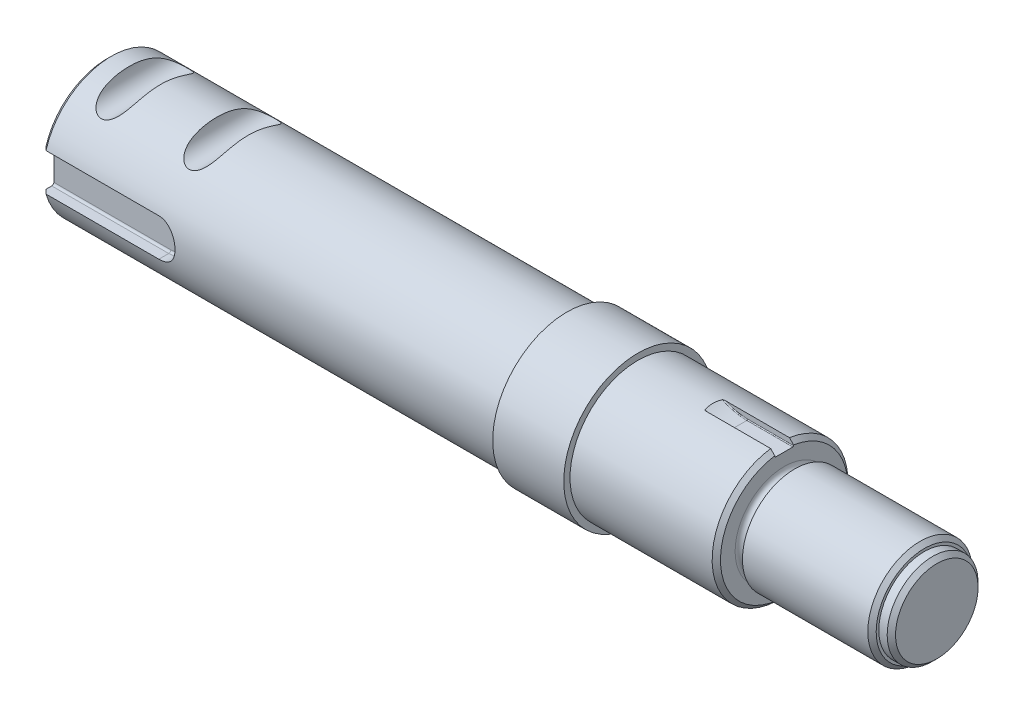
ISO-10303-21;
HEADER;
FILE_DESCRIPTION(('STEP AP214'),'2;1');
FILE_NAME('part.step','',(''),(''),'','','');
FILE_SCHEMA(('AUTOMOTIVE_DESIGN { 1 0 10303 214 1 1 1 1 }'));
ENDSEC;
DATA;
#1=APPLICATION_CONTEXT('core data for automotive mechanical design processes');
#2=APPLICATION_PROTOCOL_DEFINITION('international standard','automotive_design',2000,#1);
#3=PRODUCT_CONTEXT('',#1,'mechanical');
#4=PRODUCT('Part','Part','',(#3));
#5=PRODUCT_RELATED_PRODUCT_CATEGORY('part','',(#4));
#6=PRODUCT_DEFINITION_FORMATION('','',#4);
#7=PRODUCT_DEFINITION_CONTEXT('part definition',#1,'design');
#8=PRODUCT_DEFINITION('design','',#6,#7);
#9=PRODUCT_DEFINITION_SHAPE('','',#8);
#10=(LENGTH_UNIT() NAMED_UNIT(*) SI_UNIT(.MILLI.,.METRE.));
#11=(NAMED_UNIT(*) PLANE_ANGLE_UNIT() SI_UNIT($,.RADIAN.));
#12=(NAMED_UNIT(*) SI_UNIT($,.STERADIAN.) SOLID_ANGLE_UNIT());
#13=UNCERTAINTY_MEASURE_WITH_UNIT(LENGTH_MEASURE(1.E-05),#10,'distance_accuracy_value','');
#14=(GEOMETRIC_REPRESENTATION_CONTEXT(3) GLOBAL_UNCERTAINTY_ASSIGNED_CONTEXT((#13)) GLOBAL_UNIT_ASSIGNED_CONTEXT((#10,
#11,#12)) REPRESENTATION_CONTEXT('',''));
#15=CARTESIAN_POINT('',(0.,0.,0.));
#16=DIRECTION('',(0.,0.,1.));
#17=DIRECTION('',(1.,0.,0.));
#18=AXIS2_PLACEMENT_3D('',#15,#16,#17);
#19=CARTESIAN_POINT('',(0.,0.,0.));
#20=DIRECTION('',(-1.,0.,0.));
#21=DIRECTION('',(0.,0.,1.));
#22=AXIS2_PLACEMENT_3D('',#19,#20,#21);
#23=CYLINDRICAL_SURFACE('',#22,32.5);
#24=CARTESIAN_POINT('',(254.,0.,0.));
#25=DIRECTION('',(1.,0.,0.));
#26=DIRECTION('',(0.,0.,-1.));
#27=AXIS2_PLACEMENT_3D('',#24,#25,#26);
#28=CIRCLE('',#27,32.5);
#29=CARTESIAN_POINT('',(254.,0.,-32.5));
#30=VERTEX_POINT('',#29);
#31=EDGE_CURVE('E642',#30,#30,#28,.T.);
#32=ORIENTED_EDGE('',*,*,#31,.T.);
#33=EDGE_LOOP('',(#32));
#34=FACE_BOUND('',#33,.T.);
#35=DIRECTION('',(-1.,0.,0.));
#36=VECTOR('',#35,1.);
#37=CARTESIAN_POINT('',(0.,32.1869538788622,4.5));
#38=LINE('',#37,#36);
#39=CARTESIAN_POINT('',(291.31595421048,32.1869538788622,4.5));
#40=VERTEX_POINT('',#39);
#41=CARTESIAN_POINT('',(322.,32.1869538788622,4.5));
#42=VERTEX_POINT('',#41);
#43=EDGE_CURVE('E161',#40,#42,#38,.F.);
#44=ORIENTED_EDGE('',*,*,#43,.F.);
#45=CARTESIAN_POINT('',(291.31595421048,32.1869538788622,4.5));
#46=CARTESIAN_POINT('',(291.263517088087,32.1869585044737,4.49996216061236));
#47=CARTESIAN_POINT('',(291.211066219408,32.1871957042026,4.4982700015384));
#48=CARTESIAN_POINT('',(291.106224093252,32.188158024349,4.49138140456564));
#49=CARTESIAN_POINT('',(291.053833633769,32.1888847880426,4.48617316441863));
#50=CARTESIAN_POINT('',(290.949328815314,32.1908535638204,4.47202362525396));
#51=CARTESIAN_POINT('',(290.897216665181,32.1920978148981,4.46306610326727));
#52=CARTESIAN_POINT('',(290.793967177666,32.1951601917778,4.44092212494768));
#53=CARTESIAN_POINT('',(290.742828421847,32.1969774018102,4.42774241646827));
#54=CARTESIAN_POINT('',(290.661240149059,32.2004797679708,4.40218108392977));
#55=CARTESIAN_POINT('',(290.630285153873,32.2019546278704,4.39138510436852));
#56=CARTESIAN_POINT('',(290.56927547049,32.20521686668,4.36739677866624));
#57=CARTESIAN_POINT('',(290.539221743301,32.2070045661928,4.35420197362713));
#58=CARTESIAN_POINT('',(290.480346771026,32.2109735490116,4.3247435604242));
#59=CARTESIAN_POINT('',(290.451538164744,32.213158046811,4.30845483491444));
#60=CARTESIAN_POINT('',(290.396475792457,32.2180166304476,4.27197229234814));
#61=CARTESIAN_POINT('',(290.370216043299,32.2206895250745,4.25178797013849));
#62=CARTESIAN_POINT('',(290.335009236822,32.2251268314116,4.21797597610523));
#63=CARTESIAN_POINT('',(290.324127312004,32.2266470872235,4.20634898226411));
#64=CARTESIAN_POINT('',(290.304127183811,32.2298487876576,4.18174612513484));
#65=CARTESIAN_POINT('',(290.294999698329,32.2315293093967,4.16877795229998));
#66=CARTESIAN_POINT('',(290.28215577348,32.2344037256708,4.14647939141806));
#67=CARTESIAN_POINT('',(290.27768719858,32.2355473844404,4.13758013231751));
#68=CARTESIAN_POINT('',(290.269955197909,32.2379013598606,4.11919932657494));
#69=CARTESIAN_POINT('',(290.266701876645,32.2391121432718,4.1097136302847));
#70=CARTESIAN_POINT('',(290.264203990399,32.2403473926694,4.10000000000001));
#71=B_SPLINE_CURVE_WITH_KNOTS('',3,(#45,#46,#47,#48,#49,#50,#51,#52,#53,#54,#55,#56,#57,#58,#59,
#60,#61,#62,#63,#64,#65,#66,#67,#68,#69,#70),.UNSPECIFIED.,.F.,.F.,(4,2,2,2,2,2,2,2,2,2,2,2,4),
(0.,0.157307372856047,0.315145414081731,0.47367359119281,0.631949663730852,0.730325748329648,
0.828803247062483,0.928117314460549,1.02719230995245,1.07507725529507,1.12270143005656,
1.15269055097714,1.18292374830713),.UNSPECIFIED.);
#72=CARTESIAN_POINT('',(290.264203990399,32.2403473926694,4.1));
#73=VERTEX_POINT('',#72);
#74=EDGE_CURVE('E327',#40,#73,#71,.T.);
#75=ORIENTED_EDGE('',*,*,#74,.T.);
#76=CARTESIAN_POINT('',(290.372926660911,32.1869538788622,4.5));
#77=CARTESIAN_POINT('',(290.31534582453,32.2150723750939,4.29889549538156));
#78=CARTESIAN_POINT('',(290.26183140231,32.2414559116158,4.09641638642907));
#79=CARTESIAN_POINT('',(290.162878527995,32.2906001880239,3.68906597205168));
#80=CARTESIAN_POINT('',(290.117439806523,32.3133610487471,3.48419474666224));
#81=CARTESIAN_POINT('',(289.993174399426,32.3759689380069,2.86664645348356));
#82=CARTESIAN_POINT('',(289.926359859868,32.4101603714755,2.45089916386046));
#83=CARTESIAN_POINT('',(289.825771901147,32.4619191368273,1.62505512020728));
#84=CARTESIAN_POINT('',(289.791215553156,32.4798800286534,1.21507626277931));
#85=CARTESIAN_POINT('',(289.752112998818,32.5002175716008,0.393312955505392));
#86=CARTESIAN_POINT('',(289.747563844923,32.5025957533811,-0.0184713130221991));
#87=CARTESIAN_POINT('',(289.766671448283,32.4926454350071,-0.77113155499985));
#88=CARTESIAN_POINT('',(289.785667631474,32.4827467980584,-1.11216904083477));
#89=CARTESIAN_POINT('',(289.844383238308,32.4523450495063,-1.79193955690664));
#90=CARTESIAN_POINT('',(289.884099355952,32.4318436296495,-2.13067294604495));
#91=CARTESIAN_POINT('',(289.98545369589,32.3800059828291,-2.81141106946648));
#92=CARTESIAN_POINT('',(290.047539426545,32.3484489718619,-3.15333258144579));
#93=CARTESIAN_POINT('',(290.193691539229,32.2751761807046,-3.83144175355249));
#94=CARTESIAN_POINT('',(290.277764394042,32.2334574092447,-4.16762769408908));
#95=CARTESIAN_POINT('',(290.372926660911,32.1869538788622,-4.5));
#96=B_SPLINE_CURVE_WITH_KNOTS('',3,(#76,#77,#78,#79,#80,#81,#82,#83,#84,#85,#86,#87,#88,#89,#90,
#91,#92,#93,#94,#95),.UNSPECIFIED.,.F.,.F.,(4,2,2,2,2,2,2,2,2,4),(0.,0.633090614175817,
1.26616010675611,2.53187368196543,3.76600152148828,5.00000813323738,6.02437064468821,
7.04856976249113,8.09451276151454,9.14076402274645),.UNSPECIFIED.);
#97=CARTESIAN_POINT('',(290.264203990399,32.2403473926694,-4.1));
#98=VERTEX_POINT('',#97);
#99=EDGE_CURVE('E248',#73,#98,#96,.T.);
#100=ORIENTED_EDGE('',*,*,#99,.T.);
#101=CARTESIAN_POINT('',(290.264203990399,32.2403473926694,-4.1));
#102=CARTESIAN_POINT('',(290.267767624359,32.2385882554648,-4.11383321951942));
#103=CARTESIAN_POINT('',(290.272833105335,32.2368848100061,-4.12715695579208));
#104=CARTESIAN_POINT('',(290.285190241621,32.2336279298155,-4.15251617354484));
#105=CARTESIAN_POINT('',(290.292447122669,32.2320726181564,-4.16456807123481));
#106=CARTESIAN_POINT('',(290.312527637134,32.2283635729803,-4.19319479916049));
#107=CARTESIAN_POINT('',(290.326332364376,32.2262925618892,-4.20907237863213));
#108=CARTESIAN_POINT('',(290.356213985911,32.2224027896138,-4.23874790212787));
#109=CARTESIAN_POINT('',(290.372309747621,32.2205864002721,-4.25252638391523));
#110=CARTESIAN_POINT('',(290.405603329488,32.2172120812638,-4.27801445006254));
#111=CARTESIAN_POINT('',(290.42277606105,32.2156500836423,-4.28975684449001));
#112=CARTESIAN_POINT('',(290.458059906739,32.2127104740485,-4.31177533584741));
#113=CARTESIAN_POINT('',(290.476171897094,32.2113330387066,-4.32205002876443));
#114=CARTESIAN_POINT('',(290.531477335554,32.2074384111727,-4.35101081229));
#115=CARTESIAN_POINT('',(290.569655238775,32.2051574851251,-4.36784422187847));
#116=CARTESIAN_POINT('',(290.650823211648,32.2009091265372,-4.39905857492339));
#117=CARTESIAN_POINT('',(290.693942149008,32.1989865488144,-4.41309634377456));
#118=CARTESIAN_POINT('',(290.781233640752,32.1956162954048,-4.43761687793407));
#119=CARTESIAN_POINT('',(290.825407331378,32.1941691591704,-4.44809560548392));
#120=CARTESIAN_POINT('',(290.914405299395,32.1916906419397,-4.46599759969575));
#121=CARTESIAN_POINT('',(290.959230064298,32.1906595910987,-4.47341844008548));
#122=CARTESIAN_POINT('',(291.049257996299,32.1889788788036,-4.48549614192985));
#123=CARTESIAN_POINT('',(291.094461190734,32.1883292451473,-4.49015280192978));
#124=CARTESIAN_POINT('',(291.169127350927,32.1875580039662,-4.49567729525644));
#125=CARTESIAN_POINT('',(291.198535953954,32.1873310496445,-4.4973016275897));
#126=CARTESIAN_POINT('',(291.257280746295,32.187029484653,-4.49945923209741));
#127=CARTESIAN_POINT('',(291.28661677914,32.1869542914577,-4.49999667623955));
#128=CARTESIAN_POINT('',(291.31595421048,32.1869538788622,-4.50000000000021));
#129=B_SPLINE_CURVE_WITH_KNOTS('',3,(#101,#102,#103,#104,#105,#106,#107,#108,#109,#110,#111,
#112,#113,#114,#115,#116,#117,#118,#119,#120,#121,#122,#123,#124,#125,#126,#127,#128),
.UNSPECIFIED.,.F.,.F.,(4,2,2,2,2,2,2,2,2,2,2,2,2,4),(0.,0.0429110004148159,0.0851739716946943,
0.148260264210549,0.211899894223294,0.274392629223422,0.336944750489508,0.461994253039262,
0.597978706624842,0.734116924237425,0.870362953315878,1.00661891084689,1.09496309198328,
1.18296751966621),.UNSPECIFIED.);
#130=CARTESIAN_POINT('',(291.31595421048,32.1869538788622,-4.5));
#131=VERTEX_POINT('',#130);
#132=EDGE_CURVE('E333',#98,#131,#129,.T.);
#133=ORIENTED_EDGE('',*,*,#132,.T.);
#134=DIRECTION('',(-1.,0.,0.));
#135=VECTOR('',#134,1.);
#136=CARTESIAN_POINT('',(0.,32.1869538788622,-4.5));
#137=LINE('',#136,#135);
#138=CARTESIAN_POINT('',(322.,32.1869538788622,-4.5));
#139=VERTEX_POINT('',#138);
#140=EDGE_CURVE('E656',#131,#139,#137,.F.);
#141=ORIENTED_EDGE('',*,*,#140,.T.);
#142=CARTESIAN_POINT('',(322.,0.,0.));
#143=DIRECTION('',(-1.,0.,0.));
#144=DIRECTION('',(0.,0.,1.));
#145=AXIS2_PLACEMENT_3D('',#142,#143,#144);
#146=CIRCLE('',#145,32.5000000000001);
#147=EDGE_CURVE('E172',#139,#42,#146,.T.);
#148=ORIENTED_EDGE('',*,*,#147,.T.);
#149=EDGE_LOOP('',(#44,#75,#100,#133,#141,#148));
#150=FACE_BOUND('',#149,.T.);
#151=ADVANCED_FACE('F37',(#34,#150),#23,.T.);
#152=CARTESIAN_POINT('',(397.,21.75,0.));
#153=DIRECTION('',(-1.,0.,0.));
#154=DIRECTION('',(0.,0.,1.));
#155=AXIS2_PLACEMENT_3D('',#152,#153,#154);
#156=PLANE('',#155);
#157=CARTESIAN_POINT('',(397.,0.,0.));
#158=DIRECTION('',(-1.,0.,0.));
#159=DIRECTION('',(0.,0.,1.));
#160=AXIS2_PLACEMENT_3D('',#157,#158,#159);
#161=CIRCLE('',#160,19.75);
#162=CARTESIAN_POINT('',(397.,0.,19.75));
#163=VERTEX_POINT('',#162);
#164=EDGE_CURVE('E192',#163,#163,#161,.F.);
#165=ORIENTED_EDGE('',*,*,#164,.T.);
#166=EDGE_LOOP('',(#165));
#167=FACE_BOUND('',#166,.T.);
#168=ADVANCED_FACE('F353',(#167),#156,.F.);
#169=CARTESIAN_POINT('',(0.,0.,0.));
#170=DIRECTION('',(-1.,0.,0.));
#171=DIRECTION('',(0.,0.,1.));
#172=AXIS2_PLACEMENT_3D('',#169,#170,#171);
#173=CYLINDRICAL_SURFACE('',#172,21.75);
#174=CARTESIAN_POINT('',(395.,0.,0.));
#175=DIRECTION('',(-1.,0.,0.));
#176=DIRECTION('',(0.,0.,1.));
#177=AXIS2_PLACEMENT_3D('',#174,#175,#176);
#178=CIRCLE('',#177,21.75);
#179=CARTESIAN_POINT('',(395.,0.,21.75));
#180=VERTEX_POINT('',#179);
#181=EDGE_CURVE('E189',#180,#180,#178,.T.);
#182=ORIENTED_EDGE('',*,*,#181,.T.);
#183=EDGE_LOOP('',(#182));
#184=FACE_BOUND('',#183,.T.);
#185=CARTESIAN_POINT('',(391.,0.,0.));
#186=DIRECTION('',(-1.,0.,0.));
#187=DIRECTION('',(0.,0.,1.));
#188=AXIS2_PLACEMENT_3D('',#185,#186,#187);
#189=CIRCLE('',#188,21.75);
#190=CARTESIAN_POINT('',(391.,0.,21.75));
#191=VERTEX_POINT('',#190);
#192=EDGE_CURVE('E186',#191,#191,#189,.T.);
#193=ORIENTED_EDGE('',*,*,#192,.F.);
#194=EDGE_LOOP('',(#193));
#195=FACE_BOUND('',#194,.T.);
#196=ADVANCED_FACE('F360',(#184,#195),#173,.T.);
#197=CARTESIAN_POINT('',(391.,25.0000000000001,0.));
#198=DIRECTION('',(-1.,0.,0.));
#199=DIRECTION('',(0.,0.,1.));
#200=AXIS2_PLACEMENT_3D('',#197,#198,#199);
#201=PLANE('',#200);
#202=CARTESIAN_POINT('',(391.,0.,0.));
#203=DIRECTION('',(-1.,0.,0.));
#204=DIRECTION('',(0.,0.,1.));
#205=AXIS2_PLACEMENT_3D('',#202,#203,#204);
#206=CIRCLE('',#205,23.0000000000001);
#207=CARTESIAN_POINT('',(391.,0.,23.0000000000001));
#208=VERTEX_POINT('',#207);
#209=EDGE_CURVE('E198',#208,#208,#206,.F.);
#210=ORIENTED_EDGE('',*,*,#209,.T.);
#211=EDGE_LOOP('',(#210));
#212=FACE_BOUND('',#211,.T.);
#213=ORIENTED_EDGE('',*,*,#192,.T.);
#214=EDGE_LOOP('',(#213));
#215=FACE_BOUND('',#214,.T.);
#216=ADVANCED_FACE('F471',(#212,#215),#201,.F.);
#217=CARTESIAN_POINT('',(0.,0.,0.));
#218=DIRECTION('',(-1.,0.,0.));
#219=DIRECTION('',(0.,0.,1.));
#220=AXIS2_PLACEMENT_3D('',#217,#218,#219);
#221=CYLINDRICAL_SURFACE('',#220,25.0000000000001);
#222=CARTESIAN_POINT('',(389.,0.,0.));
#223=DIRECTION('',(-1.,0.,0.));
#224=DIRECTION('',(0.,0.,1.));
#225=AXIS2_PLACEMENT_3D('',#222,#223,#224);
#226=CIRCLE('',#225,25.0000000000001);
#227=CARTESIAN_POINT('',(389.,0.,25.0000000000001));
#228=VERTEX_POINT('',#227);
#229=EDGE_CURVE('E195',#228,#228,#226,.T.);
#230=ORIENTED_EDGE('',*,*,#229,.T.);
#231=EDGE_LOOP('',(#230));
#232=FACE_BOUND('',#231,.T.);
#233=CARTESIAN_POINT('',(329.,0.,0.));
#234=DIRECTION('',(-1.,0.,0.));
#235=DIRECTION('',(0.,0.,1.));
#236=AXIS2_PLACEMENT_3D('',#233,#234,#235);
#237=CIRCLE('',#236,25.0000000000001);
#238=CARTESIAN_POINT('',(329.,0.,25.0000000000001));
#239=VERTEX_POINT('',#238);
#240=EDGE_CURVE('E183',#239,#239,#237,.T.);
#241=ORIENTED_EDGE('',*,*,#240,.F.);
#242=EDGE_LOOP('',(#241));
#243=FACE_BOUND('',#242,.T.);
#244=ADVANCED_FACE('F464',(#232,#243),#221,.T.);
#245=CARTESIAN_POINT('',(329.,23.5000000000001,0.));
#246=DIRECTION('',(1.,0.,0.));
#247=DIRECTION('',(0.,0.,-1.));
#248=AXIS2_PLACEMENT_3D('',#245,#246,#247);
#249=PLANE('',#248);
#250=CARTESIAN_POINT('',(329.,0.,0.));
#251=DIRECTION('',(-1.,0.,0.));
#252=DIRECTION('',(0.,0.,1.));
#253=AXIS2_PLACEMENT_3D('',#250,#251,#252);
#254=CIRCLE('',#253,23.5000000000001);
#255=CARTESIAN_POINT('',(329.,0.,23.5000000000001));
#256=VERTEX_POINT('',#255);
#257=EDGE_CURVE('E175',#256,#256,#254,.T.);
#258=ORIENTED_EDGE('',*,*,#257,.F.);
#259=EDGE_LOOP('',(#258));
#260=FACE_BOUND('',#259,.T.);
#261=ORIENTED_EDGE('',*,*,#240,.T.);
#262=EDGE_LOOP('',(#261));
#263=FACE_BOUND('',#262,.T.);
#264=ADVANCED_FACE('F456',(#260,#263),#249,.F.);
#265=CARTESIAN_POINT('',(326.5,0.,0.));
#266=DIRECTION('',(-1.,0.,0.));
#267=DIRECTION('',(0.,0.,1.));
#268=AXIS2_PLACEMENT_3D('',#265,#266,#267);
#269=TOROIDAL_SURFACE('',#268,23.5000000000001,2.5);
#270=CARTESIAN_POINT('',(324.,0.,0.));
#271=DIRECTION('',(-1.,0.,0.));
#272=DIRECTION('',(0.,0.,1.));
#273=AXIS2_PLACEMENT_3D('',#270,#271,#272);
#274=CIRCLE('',#273,23.5000000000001);
#275=CARTESIAN_POINT('',(324.,0.,23.5000000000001));
#276=VERTEX_POINT('',#275);
#277=EDGE_CURVE('E171',#276,#276,#274,.T.);
#278=ORIENTED_EDGE('',*,*,#277,.F.);
#279=EDGE_LOOP('',(#278));
#280=FACE_BOUND('',#279,.T.);
#281=ORIENTED_EDGE('',*,*,#257,.T.);
#282=EDGE_LOOP('',(#281));
#283=FACE_BOUND('',#282,.T.);
#284=ADVANCED_FACE('F448',(#280,#283),#269,.F.);
#285=CARTESIAN_POINT('',(324.,30.5000000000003,0.));
#286=DIRECTION('',(-1.,0.,0.));
#287=DIRECTION('',(0.,0.,1.));
#288=AXIS2_PLACEMENT_3D('',#285,#286,#287);
#289=PLANE('',#288);
#290=CARTESIAN_POINT('',(324.,0.,0.));
#291=DIRECTION('',(-1.,0.,0.));
#292=DIRECTION('',(0.,0.,1.));
#293=AXIS2_PLACEMENT_3D('',#290,#291,#292);
#294=CIRCLE('',#293,30.5000000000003);
#295=CARTESIAN_POINT('',(324.,30.166206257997,-4.5));
#296=VERTEX_POINT('',#295);
#297=CARTESIAN_POINT('',(324.,30.166206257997,4.5));
#298=VERTEX_POINT('',#297);
#299=EDGE_CURVE('E150',#296,#298,#294,.T.);
#300=ORIENTED_EDGE('',*,*,#299,.F.);
#301=DIRECTION('',(0.,1.,0.));
#302=VECTOR('',#301,1.);
#303=CARTESIAN_POINT('',(324.,48.5159962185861,-4.5));
#304=LINE('',#303,#302);
#305=CARTESIAN_POINT('',(324.,29.9,-4.5));
#306=VERTEX_POINT('',#305);
#307=EDGE_CURVE('E154',#306,#296,#304,.T.);
#308=ORIENTED_EDGE('',*,*,#307,.F.);
#309=CARTESIAN_POINT('',(324.,29.9,-4.1));
#310=DIRECTION('',(-1.,0.,0.));
#311=DIRECTION('',(0.,0.,1.));
#312=AXIS2_PLACEMENT_3D('',#309,#310,#311);
#313=CIRCLE('',#312,0.4);
#314=CARTESIAN_POINT('',(324.,29.5,-4.1));
#315=VERTEX_POINT('',#314);
#316=EDGE_CURVE('E11',#306,#315,#313,.T.);
#317=ORIENTED_EDGE('',*,*,#316,.T.);
#318=DIRECTION('',(0.,0.,1.));
#319=VECTOR('',#318,1.);
#320=CARTESIAN_POINT('',(324.,29.5,-4.5));
#321=LINE('',#320,#319);
#322=CARTESIAN_POINT('',(324.,29.5,4.1));
#323=VERTEX_POINT('',#322);
#324=EDGE_CURVE('E652',#315,#323,#321,.T.);
#325=ORIENTED_EDGE('',*,*,#324,.T.);
#326=CARTESIAN_POINT('',(324.,29.9,4.1));
#327=DIRECTION('',(-1.,0.,0.));
#328=DIRECTION('',(0.,0.,1.));
#329=AXIS2_PLACEMENT_3D('',#326,#327,#328);
#330=CIRCLE('',#329,0.4);
#331=CARTESIAN_POINT('',(324.,29.9,4.5));
#332=VERTEX_POINT('',#331);
#333=EDGE_CURVE('E46',#323,#332,#330,.T.);
#334=ORIENTED_EDGE('',*,*,#333,.T.);
#335=DIRECTION('',(0.,1.,0.));
#336=VECTOR('',#335,1.);
#337=CARTESIAN_POINT('',(324.,48.5159962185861,4.5));
#338=LINE('',#337,#336);
#339=EDGE_CURVE('E145',#332,#298,#338,.T.);
#340=ORIENTED_EDGE('',*,*,#339,.T.);
#341=EDGE_LOOP('',(#300,#308,#317,#325,#334,#340));
#342=FACE_BOUND('',#341,.T.);
#343=ORIENTED_EDGE('',*,*,#277,.T.);
#344=EDGE_LOOP('',(#343));
#345=FACE_BOUND('',#344,.T.);
#346=ADVANCED_FACE('F147',(#342,#345),#289,.F.);
#347=CARTESIAN_POINT('',(324.,0.,0.));
#348=DIRECTION('',(-1.,0.,0.));
#349=DIRECTION('',(0.,0.,1.));
#350=AXIS2_PLACEMENT_3D('',#347,#348,#349);
#351=CONICAL_SURFACE('',#350,30.5000000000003,0.785398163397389);
#352=ORIENTED_EDGE('',*,*,#147,.F.);
#353=CARTESIAN_POINT('',(318.996143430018,35.2175216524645,-4.5));
#354=CARTESIAN_POINT('',(319.813718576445,34.3932877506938,-4.5));
#355=CARTESIAN_POINT('',(320.631072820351,33.568834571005,-4.5));
#356=CARTESIAN_POINT('',(322.265199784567,31.9193534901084,-4.5));
#357=CARTESIAN_POINT('',(323.081972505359,31.0943255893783,-4.5));
#358=CARTESIAN_POINT('',(324.714798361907,29.4435572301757,-4.5));
#359=CARTESIAN_POINT('',(325.530851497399,28.6178167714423,-4.5));
#360=CARTESIAN_POINT('',(327.162009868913,26.9653988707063,-4.5));
#361=CARTESIAN_POINT('',(327.977115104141,26.1387214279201,-4.5));
#362=CARTESIAN_POINT('',(328.791631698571,25.3114638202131,-4.5));
#363=B_SPLINE_CURVE_WITH_KNOTS('',3,(#353,#354,#355,#356,#357,#358,#359,#360,#361,#362),
.UNSPECIFIED.,.F.,.F.,(4,2,2,2,4),(0.,3.48283169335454,6.96566049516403,10.4484905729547,
13.9313235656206),.UNSPECIFIED.);
#364=EDGE_CURVE('E165',#139,#296,#363,.T.);
#365=ORIENTED_EDGE('',*,*,#364,.T.);
#366=ORIENTED_EDGE('',*,*,#299,.T.);
#367=CARTESIAN_POINT('',(318.996143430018,35.2175216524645,4.5));
#368=CARTESIAN_POINT('',(319.813718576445,34.3932877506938,4.5));
#369=CARTESIAN_POINT('',(320.631072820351,33.568834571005,4.5));
#370=CARTESIAN_POINT('',(322.265199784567,31.9193534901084,4.5));
#371=CARTESIAN_POINT('',(323.081972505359,31.0943255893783,4.5));
#372=CARTESIAN_POINT('',(324.714798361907,29.4435572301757,4.5));
#373=CARTESIAN_POINT('',(325.530851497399,28.6178167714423,4.5));
#374=CARTESIAN_POINT('',(327.162009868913,26.9653988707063,4.5));
#375=CARTESIAN_POINT('',(327.977115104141,26.1387214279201,4.5));
#376=CARTESIAN_POINT('',(328.791631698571,25.3114638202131,4.5));
#377=B_SPLINE_CURVE_WITH_KNOTS('',3,(#367,#368,#369,#370,#371,#372,#373,#374,#375,#376),
.UNSPECIFIED.,.F.,.F.,(4,2,2,2,4),(0.,3.48283169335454,6.96566049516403,10.4484905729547,
13.9313235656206),.UNSPECIFIED.);
#378=EDGE_CURVE('E158',#42,#298,#377,.T.);
#379=ORIENTED_EDGE('',*,*,#378,.F.);
#380=EDGE_LOOP('',(#352,#365,#366,#379));
#381=FACE_BOUND('',#380,.T.);
#382=ADVANCED_FACE('F169',(#381),#351,.T.);
#383=CARTESIAN_POINT('',(395.,0.,0.));
#384=DIRECTION('',(-1.,0.,0.));
#385=DIRECTION('',(0.,0.,1.));
#386=AXIS2_PLACEMENT_3D('',#383,#384,#385);
#387=CONICAL_SURFACE('',#386,21.75,0.78539816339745);
#388=ORIENTED_EDGE('',*,*,#164,.F.);
#389=EDGE_LOOP('',(#388));
#390=FACE_BOUND('',#389,.T.);
#391=ORIENTED_EDGE('',*,*,#181,.F.);
#392=EDGE_LOOP('',(#391));
#393=FACE_BOUND('',#392,.T.);
#394=ADVANCED_FACE('F234',(#390,#393),#387,.T.);
#395=CARTESIAN_POINT('',(389.,0.,0.));
#396=DIRECTION('',(-1.,0.,0.));
#397=DIRECTION('',(0.,0.,1.));
#398=AXIS2_PLACEMENT_3D('',#395,#396,#397);
#399=CONICAL_SURFACE('',#398,25.0000000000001,0.785398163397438);
#400=ORIENTED_EDGE('',*,*,#209,.F.);
#401=EDGE_LOOP('',(#400));
#402=FACE_BOUND('',#401,.T.);
#403=ORIENTED_EDGE('',*,*,#229,.F.);
#404=EDGE_LOOP('',(#403));
#405=FACE_BOUND('',#404,.T.);
#406=ADVANCED_FACE('F271',(#402,#405),#399,.T.);
#407=CARTESIAN_POINT('',(302.,56.,-4.5));
#408=DIRECTION('',(0.,0.,1.));
#409=DIRECTION('',(1.,0.,0.));
#410=AXIS2_PLACEMENT_3D('',#407,#408,#409);
#411=CYLINDRICAL_SURFACE('',#410,26.5);
#412=ORIENTED_EDGE('',*,*,#99,.F.);
#413=CARTESIAN_POINT('',(302.,56.,4.1));
#414=DIRECTION('',(0.,0.,-1.));
#415=DIRECTION('',(-1.,0.,0.));
#416=AXIS2_PLACEMENT_3D('',#413,#414,#415);
#417=CIRCLE('',#416,26.5);
#418=CARTESIAN_POINT('',(302.,29.5,4.1));
#419=VERTEX_POINT('',#418);
#420=EDGE_CURVE('E704',#73,#419,#417,.F.);
#421=ORIENTED_EDGE('',*,*,#420,.T.);
#422=DIRECTION('',(0.,0.,1.));
#423=VECTOR('',#422,1.);
#424=CARTESIAN_POINT('',(302.,29.5,-4.5));
#425=LINE('',#424,#423);
#426=CARTESIAN_POINT('',(302.,29.5,-4.1));
#427=VERTEX_POINT('',#426);
#428=EDGE_CURVE('E650',#427,#419,#425,.T.);
#429=ORIENTED_EDGE('',*,*,#428,.F.);
#430=CARTESIAN_POINT('',(302.,56.,-4.1));
#431=DIRECTION('',(0.,0.,-1.));
#432=DIRECTION('',(-1.,0.,0.));
#433=AXIS2_PLACEMENT_3D('',#430,#431,#432);
#434=CIRCLE('',#433,26.5);
#435=EDGE_CURVE('E702',#427,#98,#434,.T.);
#436=ORIENTED_EDGE('',*,*,#435,.T.);
#437=EDGE_LOOP('',(#412,#421,#429,#436));
#438=FACE_BOUND('',#437,.T.);
#439=ADVANCED_FACE('F258',(#438),#411,.F.);
#440=CARTESIAN_POINT('',(302.,56.,-4.5));
#441=DIRECTION('',(0.,0.,-1.));
#442=DIRECTION('',(-1.,0.,0.));
#443=AXIS2_PLACEMENT_3D('',#440,#441,#442);
#444=PLANE('',#443);
#445=ORIENTED_EDGE('',*,*,#140,.F.);
#446=CARTESIAN_POINT('',(302.,56.,-4.5));
#447=DIRECTION('',(0.,0.,-1.));
#448=DIRECTION('',(-1.,0.,0.));
#449=AXIS2_PLACEMENT_3D('',#446,#447,#448);
#450=CIRCLE('',#449,26.1);
#451=CARTESIAN_POINT('',(302.,29.9,-4.5));
#452=VERTEX_POINT('',#451);
#453=EDGE_CURVE('E713',#131,#452,#450,.F.);
#454=ORIENTED_EDGE('',*,*,#453,.T.);
#455=DIRECTION('',(1.,0.,0.));
#456=VECTOR('',#455,1.);
#457=CARTESIAN_POINT('',(324.,29.9,-4.5));
#458=LINE('',#457,#456);
#459=EDGE_CURVE('E711',#452,#306,#458,.T.);
#460=ORIENTED_EDGE('',*,*,#459,.T.);
#461=ORIENTED_EDGE('',*,*,#307,.T.);
#462=ORIENTED_EDGE('',*,*,#364,.F.);
#463=EDGE_LOOP('',(#445,#454,#460,#461,#462));
#464=FACE_BOUND('',#463,.T.);
#465=ADVANCED_FACE('F254',(#464),#444,.F.);
#466=CARTESIAN_POINT('',(302.,56.,4.5));
#467=DIRECTION('',(0.,0.,-1.));
#468=DIRECTION('',(-1.,0.,0.));
#469=AXIS2_PLACEMENT_3D('',#466,#467,#468);
#470=PLANE('',#469);
#471=DIRECTION('',(1.,0.,0.));
#472=VECTOR('',#471,1.);
#473=CARTESIAN_POINT('',(302.,29.9,4.5));
#474=LINE('',#473,#472);
#475=CARTESIAN_POINT('',(302.,29.9,4.5));
#476=VERTEX_POINT('',#475);
#477=EDGE_CURVE('E707',#332,#476,#474,.F.);
#478=ORIENTED_EDGE('',*,*,#477,.T.);
#479=CARTESIAN_POINT('',(302.,56.,4.5));
#480=DIRECTION('',(0.,0.,-1.));
#481=DIRECTION('',(-1.,0.,0.));
#482=AXIS2_PLACEMENT_3D('',#479,#480,#481);
#483=CIRCLE('',#482,26.1);
#484=EDGE_CURVE('E709',#476,#40,#483,.T.);
#485=ORIENTED_EDGE('',*,*,#484,.T.);
#486=ORIENTED_EDGE('',*,*,#43,.T.);
#487=ORIENTED_EDGE('',*,*,#378,.T.);
#488=ORIENTED_EDGE('',*,*,#339,.F.);
#489=EDGE_LOOP('',(#478,#485,#486,#487,#488));
#490=FACE_BOUND('',#489,.T.);
#491=ADVANCED_FACE('F159',(#490),#470,.T.);
#492=CARTESIAN_POINT('',(324.,29.5,-4.5));
#493=DIRECTION('',(0.,-1.,0.));
#494=DIRECTION('',(0.,0.,-1.));
#495=AXIS2_PLACEMENT_3D('',#492,#493,#494);
#496=PLANE('',#495);
#497=ORIENTED_EDGE('',*,*,#428,.T.);
#498=DIRECTION('',(1.,0.,0.));
#499=VECTOR('',#498,1.);
#500=CARTESIAN_POINT('',(324.,29.5,4.1));
#501=LINE('',#500,#499);
#502=EDGE_CURVE('E54',#419,#323,#501,.T.);
#503=ORIENTED_EDGE('',*,*,#502,.T.);
#504=ORIENTED_EDGE('',*,*,#324,.F.);
#505=DIRECTION('',(1.,0.,0.));
#506=VECTOR('',#505,1.);
#507=CARTESIAN_POINT('',(302.,29.5,-4.1));
#508=LINE('',#507,#506);
#509=EDGE_CURVE('E715',#315,#427,#508,.F.);
#510=ORIENTED_EDGE('',*,*,#509,.T.);
#511=EDGE_LOOP('',(#497,#503,#504,#510));
#512=FACE_BOUND('',#511,.T.);
#513=ADVANCED_FACE('F265',(#512),#496,.F.);
#514=CARTESIAN_POINT('',(324.,29.9,4.1));
#515=DIRECTION('',(1.,0.,0.));
#516=DIRECTION('',(0.,0.,-1.));
#517=AXIS2_PLACEMENT_3D('',#514,#515,#516);
#518=CYLINDRICAL_SURFACE('',#517,0.4);
#519=ORIENTED_EDGE('',*,*,#333,.F.);
#520=ORIENTED_EDGE('',*,*,#502,.F.);
#521=CARTESIAN_POINT('',(302.,29.9,4.1));
#522=DIRECTION('',(1.,0.,0.));
#523=DIRECTION('',(0.,0.,-1.));
#524=AXIS2_PLACEMENT_3D('',#521,#522,#523);
#525=CIRCLE('',#524,0.4);
#526=EDGE_CURVE('E695',#476,#419,#525,.T.);
#527=ORIENTED_EDGE('',*,*,#526,.F.);
#528=ORIENTED_EDGE('',*,*,#477,.F.);
#529=EDGE_LOOP('',(#519,#520,#527,#528));
#530=FACE_BOUND('',#529,.T.);
#531=ADVANCED_FACE('F267',(#530),#518,.F.);
#532=CARTESIAN_POINT('',(302.,56.,4.1));
#533=DIRECTION('',(0.,0.,-1.));
#534=DIRECTION('',(-1.,0.,0.));
#535=AXIS2_PLACEMENT_3D('',#532,#533,#534);
#536=TOROIDAL_SURFACE('',#535,26.1,0.4);
#537=ORIENTED_EDGE('',*,*,#74,.F.);
#538=ORIENTED_EDGE('',*,*,#484,.F.);
#539=ORIENTED_EDGE('',*,*,#526,.T.);
#540=ORIENTED_EDGE('',*,*,#420,.F.);
#541=EDGE_LOOP('',(#537,#538,#539,#540));
#542=FACE_BOUND('',#541,.T.);
#543=ADVANCED_FACE('F321',(#542),#536,.F.);
#544=CARTESIAN_POINT('',(302.,29.9,-4.1));
#545=DIRECTION('',(-1.,0.,0.));
#546=DIRECTION('',(0.,0.,1.));
#547=AXIS2_PLACEMENT_3D('',#544,#545,#546);
#548=CYLINDRICAL_SURFACE('',#547,0.4);
#549=ORIENTED_EDGE('',*,*,#316,.F.);
#550=ORIENTED_EDGE('',*,*,#459,.F.);
#551=CARTESIAN_POINT('',(302.,29.9,-4.1));
#552=DIRECTION('',(1.,0.,0.));
#553=DIRECTION('',(0.,0.,-1.));
#554=AXIS2_PLACEMENT_3D('',#551,#552,#553);
#555=CIRCLE('',#554,0.4);
#556=EDGE_CURVE('E41',#427,#452,#555,.T.);
#557=ORIENTED_EDGE('',*,*,#556,.F.);
#558=ORIENTED_EDGE('',*,*,#509,.F.);
#559=EDGE_LOOP('',(#549,#550,#557,#558));
#560=FACE_BOUND('',#559,.T.);
#561=ADVANCED_FACE('F39',(#560),#548,.F.);
#562=CARTESIAN_POINT('',(302.,56.,-4.1));
#563=DIRECTION('',(0.,0.,-1.));
#564=DIRECTION('',(-1.,0.,0.));
#565=AXIS2_PLACEMENT_3D('',#562,#563,#564);
#566=TOROIDAL_SURFACE('',#565,26.1,0.4);
#567=ORIENTED_EDGE('',*,*,#132,.F.);
#568=ORIENTED_EDGE('',*,*,#435,.F.);
#569=ORIENTED_EDGE('',*,*,#556,.T.);
#570=ORIENTED_EDGE('',*,*,#453,.F.);
#571=EDGE_LOOP('',(#567,#568,#569,#570));
#572=FACE_BOUND('',#571,.T.);
#573=ADVANCED_FACE('F339',(#572),#566,.F.);
#574=CARTESIAN_POINT('',(220.,32.5,0.));
#575=DIRECTION('',(-1.,0.,0.));
#576=DIRECTION('',(0.,0.,1.));
#577=AXIS2_PLACEMENT_3D('',#574,#575,#576);
#578=PLANE('',#577);
#579=CARTESIAN_POINT('',(220.,0.,0.));
#580=DIRECTION('',(1.,0.,0.));
#581=DIRECTION('',(0.,0.,-1.));
#582=AXIS2_PLACEMENT_3D('',#579,#580,#581);
#583=CIRCLE('',#582,32.5);
#584=CARTESIAN_POINT('',(220.,0.,-32.5));
#585=VERTEX_POINT('',#584);
#586=EDGE_CURVE('E375',#585,#585,#583,.T.);
#587=ORIENTED_EDGE('',*,*,#586,.T.);
#588=EDGE_LOOP('',(#587));
#589=FACE_BOUND('',#588,.T.);
#590=CARTESIAN_POINT('',(220.,0.,0.));
#591=DIRECTION('',(1.,0.,0.));
#592=DIRECTION('',(0.,0.,-1.));
#593=AXIS2_PLACEMENT_3D('',#590,#591,#592);
#594=CIRCLE('',#593,35.5);
#595=CARTESIAN_POINT('',(220.,0.,-35.5));
#596=VERTEX_POINT('',#595);
#597=EDGE_CURVE('E644',#596,#596,#594,.T.);
#598=ORIENTED_EDGE('',*,*,#597,.F.);
#599=EDGE_LOOP('',(#598));
#600=FACE_BOUND('',#599,.T.);
#601=ADVANCED_FACE('F260',(#589,#600),#578,.T.);
#602=CARTESIAN_POINT('',(322.,0.,0.));
#603=DIRECTION('',(1.,0.,0.));
#604=DIRECTION('',(0.,0.,-1.));
#605=AXIS2_PLACEMENT_3D('',#602,#603,#604);
#606=CYLINDRICAL_SURFACE('',#605,35.5);
#607=ORIENTED_EDGE('',*,*,#597,.T.);
#608=EDGE_LOOP('',(#607));
#609=FACE_BOUND('',#608,.T.);
#610=CARTESIAN_POINT('',(254.,0.,0.));
#611=DIRECTION('',(1.,0.,0.));
#612=DIRECTION('',(0.,0.,-1.));
#613=AXIS2_PLACEMENT_3D('',#610,#611,#612);
#614=CIRCLE('',#613,35.5);
#615=CARTESIAN_POINT('',(254.,0.,-35.5));
#616=VERTEX_POINT('',#615);
#617=EDGE_CURVE('E640',#616,#616,#614,.T.);
#618=ORIENTED_EDGE('',*,*,#617,.F.);
#619=EDGE_LOOP('',(#618));
#620=FACE_BOUND('',#619,.T.);
#621=ADVANCED_FACE('F348',(#609,#620),#606,.T.);
#622=CARTESIAN_POINT('',(254.,32.5,0.));
#623=DIRECTION('',(1.,0.,0.));
#624=DIRECTION('',(0.,0.,-1.));
#625=AXIS2_PLACEMENT_3D('',#622,#623,#624);
#626=PLANE('',#625);
#627=ORIENTED_EDGE('',*,*,#617,.T.);
#628=EDGE_LOOP('',(#627));
#629=FACE_BOUND('',#628,.T.);
#630=ORIENTED_EDGE('',*,*,#31,.F.);
#631=EDGE_LOOP('',(#630));
#632=FACE_BOUND('',#631,.T.);
#633=ADVANCED_FACE('F277',(#629,#632),#626,.T.);
#634=CARTESIAN_POINT('',(56.,0.,25.5));
#635=DIRECTION('',(0.,0.,-1.));
#636=DIRECTION('',(-1.,0.,0.));
#637=AXIS2_PLACEMENT_3D('',#634,#635,#636);
#638=PLANE('',#637);
#639=DIRECTION('',(0.,-1.,0.));
#640=VECTOR('',#639,1.);
#641=CARTESIAN_POINT('',(0.,9.,25.5));
#642=LINE('',#641,#640);
#643=CARTESIAN_POINT('',(0.,8.,25.5));
#644=VERTEX_POINT('',#643);
#645=CARTESIAN_POINT('',(0.,-8.,25.5));
#646=VERTEX_POINT('',#645);
#647=EDGE_CURVE('E658',#644,#646,#642,.T.);
#648=ORIENTED_EDGE('',*,*,#647,.T.);
#649=DIRECTION('',(1.,0.,0.));
#650=VECTOR('',#649,1.);
#651=CARTESIAN_POINT('',(56.,-8.,25.5));
#652=LINE('',#651,#650);
#653=CARTESIAN_POINT('',(56.,-8.,25.5));
#654=VERTEX_POINT('',#653);
#655=EDGE_CURVE('E690',#646,#654,#652,.T.);
#656=ORIENTED_EDGE('',*,*,#655,.T.);
#657=CARTESIAN_POINT('',(56.,0.,25.5));
#658=DIRECTION('',(0.,0.,-1.));
#659=DIRECTION('',(-1.,0.,0.));
#660=AXIS2_PLACEMENT_3D('',#657,#658,#659);
#661=CIRCLE('',#660,8.);
#662=CARTESIAN_POINT('',(56.,8.,25.5));
#663=VERTEX_POINT('',#662);
#664=EDGE_CURVE('E693',#654,#663,#661,.F.);
#665=ORIENTED_EDGE('',*,*,#664,.T.);
#666=DIRECTION('',(-1.,0.,0.));
#667=VECTOR('',#666,1.);
#668=CARTESIAN_POINT('',(0.,8.,25.5));
#669=LINE('',#668,#667);
#670=EDGE_CURVE('E727',#663,#644,#669,.T.);
#671=ORIENTED_EDGE('',*,*,#670,.T.);
#672=EDGE_LOOP('',(#648,#656,#665,#671));
#673=FACE_BOUND('',#672,.T.);
#674=ADVANCED_FACE('F273',(#673),#638,.F.);
#675=CARTESIAN_POINT('',(56.,8.,26.5));
#676=DIRECTION('',(1.,0.,0.));
#677=DIRECTION('',(0.,0.,-1.));
#678=AXIS2_PLACEMENT_3D('',#675,#676,#677);
#679=CYLINDRICAL_SURFACE('',#678,1.);
#680=CARTESIAN_POINT('',(0.,8.,26.5));
#681=DIRECTION('',(1.,0.,0.));
#682=DIRECTION('',(0.,0.,-1.));
#683=AXIS2_PLACEMENT_3D('',#680,#681,#682);
#684=CIRCLE('',#683,1.);
#685=CARTESIAN_POINT('',(0.,9.,26.5));
#686=VERTEX_POINT('',#685);
#687=EDGE_CURVE('E699',#644,#686,#684,.T.);
#688=ORIENTED_EDGE('',*,*,#687,.F.);
#689=ORIENTED_EDGE('',*,*,#670,.F.);
#690=CARTESIAN_POINT('',(56.,8.,26.5));
#691=DIRECTION('',(-1.,0.,0.));
#692=DIRECTION('',(0.,0.,1.));
#693=AXIS2_PLACEMENT_3D('',#690,#691,#692);
#694=CIRCLE('',#693,1.);
#695=CARTESIAN_POINT('',(56.,9.,26.5));
#696=VERTEX_POINT('',#695);
#697=EDGE_CURVE('E155',#696,#663,#694,.T.);
#698=ORIENTED_EDGE('',*,*,#697,.F.);
#699=DIRECTION('',(-1.,0.,0.));
#700=VECTOR('',#699,1.);
#701=CARTESIAN_POINT('',(56.,9.,26.5));
#702=LINE('',#701,#700);
#703=EDGE_CURVE('E677',#686,#696,#702,.F.);
#704=ORIENTED_EDGE('',*,*,#703,.F.);
#705=EDGE_LOOP('',(#688,#689,#698,#704));
#706=FACE_BOUND('',#705,.T.);
#707=ADVANCED_FACE('F276',(#706),#679,.F.);
#708=CARTESIAN_POINT('',(0.,32.5,0.));
#709=DIRECTION('',(1.,0.,0.));
#710=DIRECTION('',(0.,0.,-1.));
#711=AXIS2_PLACEMENT_3D('',#708,#709,#710);
#712=PLANE('',#711);
#713=ORIENTED_EDGE('',*,*,#647,.F.);
#714=ORIENTED_EDGE('',*,*,#687,.T.);
#715=DIRECTION('',(0.,0.,1.));
#716=VECTOR('',#715,1.);
#717=CARTESIAN_POINT('',(0.,9.,25.5));
#718=LINE('',#717,#716);
#719=CARTESIAN_POINT('',(0.,9.,29.1418942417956));
#720=VERTEX_POINT('',#719);
#721=EDGE_CURVE('E662',#686,#720,#718,.T.);
#722=ORIENTED_EDGE('',*,*,#721,.T.);
#723=CARTESIAN_POINT('',(0.,0.,0.));
#724=DIRECTION('',(1.,0.,0.));
#725=DIRECTION('',(0.,0.,-1.));
#726=AXIS2_PLACEMENT_3D('',#723,#724,#725);
#727=CIRCLE('',#726,30.5);
#728=CARTESIAN_POINT('',(0.,-9.,29.1418942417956));
#729=VERTEX_POINT('',#728);
#730=EDGE_CURVE('E201',#720,#729,#727,.F.);
#731=ORIENTED_EDGE('',*,*,#730,.T.);
#732=DIRECTION('',(0.,0.,1.));
#733=VECTOR('',#732,1.);
#734=CARTESIAN_POINT('',(0.,-9.,25.5));
#735=LINE('',#734,#733);
#736=CARTESIAN_POINT('',(0.,-9.,26.5));
#737=VERTEX_POINT('',#736);
#738=EDGE_CURVE('E661',#737,#729,#735,.T.);
#739=ORIENTED_EDGE('',*,*,#738,.F.);
#740=CARTESIAN_POINT('',(0.,-8.,26.5));
#741=DIRECTION('',(1.,0.,0.));
#742=DIRECTION('',(0.,0.,-1.));
#743=AXIS2_PLACEMENT_3D('',#740,#741,#742);
#744=CIRCLE('',#743,1.);
#745=EDGE_CURVE('E689',#737,#646,#744,.T.);
#746=ORIENTED_EDGE('',*,*,#745,.T.);
#747=EDGE_LOOP('',(#713,#714,#722,#731,#739,#746));
#748=FACE_BOUND('',#747,.T.);
#749=ADVANCED_FACE('F312',(#748),#712,.F.);
#750=CARTESIAN_POINT('',(56.,-8.,26.5));
#751=DIRECTION('',(-1.,0.,0.));
#752=DIRECTION('',(0.,0.,1.));
#753=AXIS2_PLACEMENT_3D('',#750,#751,#752);
#754=CYLINDRICAL_SURFACE('',#753,1.);
#755=ORIENTED_EDGE('',*,*,#745,.F.);
#756=DIRECTION('',(1.,0.,0.));
#757=VECTOR('',#756,1.);
#758=CARTESIAN_POINT('',(0.,-9.,26.5));
#759=LINE('',#758,#757);
#760=CARTESIAN_POINT('',(56.,-9.,26.5));
#761=VERTEX_POINT('',#760);
#762=EDGE_CURVE('E682',#761,#737,#759,.F.);
#763=ORIENTED_EDGE('',*,*,#762,.F.);
#764=CARTESIAN_POINT('',(56.,-8.,26.5));
#765=DIRECTION('',(1.,0.,0.));
#766=DIRECTION('',(0.,0.,-1.));
#767=AXIS2_PLACEMENT_3D('',#764,#765,#766);
#768=CIRCLE('',#767,1.);
#769=EDGE_CURVE('E687',#761,#654,#768,.T.);
#770=ORIENTED_EDGE('',*,*,#769,.T.);
#771=ORIENTED_EDGE('',*,*,#655,.F.);
#772=EDGE_LOOP('',(#755,#763,#770,#771));
#773=FACE_BOUND('',#772,.T.);
#774=ADVANCED_FACE('F307',(#773),#754,.F.);
#775=CARTESIAN_POINT('',(56.,0.,26.5));
#776=DIRECTION('',(0.,0.,-1.));
#777=DIRECTION('',(-1.,0.,0.));
#778=AXIS2_PLACEMENT_3D('',#775,#776,#777);
#779=TOROIDAL_SURFACE('',#778,8.,1.);
#780=ORIENTED_EDGE('',*,*,#697,.T.);
#781=ORIENTED_EDGE('',*,*,#664,.F.);
#782=ORIENTED_EDGE('',*,*,#769,.F.);
#783=CARTESIAN_POINT('',(56.,0.,26.5));
#784=DIRECTION('',(0.,0.,-1.));
#785=DIRECTION('',(-1.,0.,0.));
#786=AXIS2_PLACEMENT_3D('',#783,#784,#785);
#787=CIRCLE('',#786,9.);
#788=EDGE_CURVE('E680',#696,#761,#787,.T.);
#789=ORIENTED_EDGE('',*,*,#788,.F.);
#790=EDGE_LOOP('',(#780,#781,#782,#789));
#791=FACE_BOUND('',#790,.T.);
#792=ADVANCED_FACE('F311',(#791),#779,.F.);
#793=CARTESIAN_POINT('',(60.,-32.5,-76.));
#794=DIRECTION('',(0.,0.,1.));
#795=DIRECTION('',(1.,0.,0.));
#796=AXIS2_PLACEMENT_3D('',#793,#794,#795);
#797=CYLINDRICAL_SURFACE('',#796,7.50000000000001);
#798=CARTESIAN_POINT('',(67.5,-32.5,0.));
#799=CARTESIAN_POINT('',(67.5000014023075,-32.4999997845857,-0.453658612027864));
#800=CARTESIAN_POINT('',(67.5000184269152,-32.490499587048,-0.907326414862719));
#801=CARTESIAN_POINT('',(67.499873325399,-32.4525142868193,-1.81387717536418));
#802=CARTESIAN_POINT('',(67.499711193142,-32.4240285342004,-2.2667601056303));
#803=CARTESIAN_POINT('',(67.4985579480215,-32.3481057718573,-3.17112711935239));
#804=CARTESIAN_POINT('',(67.4975664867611,-32.3006608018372,-3.62261053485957));
#805=CARTESIAN_POINT('',(67.4936779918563,-32.1869048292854,-4.52317849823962));
#806=CARTESIAN_POINT('',(67.490780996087,-32.1205942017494,-4.97226309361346));
#807=CARTESIAN_POINT('',(67.4815901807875,-31.9694050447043,-5.86618687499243));
#808=CARTESIAN_POINT('',(67.4753043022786,-31.8845701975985,-6.3110335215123));
#809=CARTESIAN_POINT('',(67.4574238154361,-31.6964051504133,-7.19672624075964));
#810=CARTESIAN_POINT('',(67.4458288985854,-31.5930738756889,-7.63757207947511));
#811=CARTESIAN_POINT('',(67.41498379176,-31.3682387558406,-8.5139947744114));
#812=CARTESIAN_POINT('',(67.3957393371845,-31.246748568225,-8.94957532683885));
#813=CARTESIAN_POINT('',(67.3467755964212,-30.985896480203,-9.81469631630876));
#814=CARTESIAN_POINT('',(67.3170583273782,-30.8465380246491,-10.2442378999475));
#815=CARTESIAN_POINT('',(67.2489538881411,-30.5713179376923,-11.0360582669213));
#816=CARTESIAN_POINT('',(67.2123794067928,-30.4377326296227,-11.3992832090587));
#817=CARTESIAN_POINT('',(67.1265340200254,-30.158228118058,-12.1194229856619));
#818=CARTESIAN_POINT('',(67.0772644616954,-30.0123102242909,-12.4763384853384));
#819=CARTESIAN_POINT('',(66.9630389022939,-29.708496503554,-13.1834597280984));
#820=CARTESIAN_POINT('',(66.8980491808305,-29.550575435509,-13.5336492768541));
#821=CARTESIAN_POINT('',(66.7491116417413,-29.2240730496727,-14.2249655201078));
#822=CARTESIAN_POINT('',(66.665164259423,-29.0554919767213,-14.566092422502));
#823=CARTESIAN_POINT('',(66.4729606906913,-28.7064362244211,-15.242625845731));
#824=CARTESIAN_POINT('',(66.3643378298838,-28.5258146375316,-15.5778541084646));
#825=CARTESIAN_POINT('',(66.1189413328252,-28.157470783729,-16.2341743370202));
#826=CARTESIAN_POINT('',(65.9821556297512,-27.9697455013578,-16.5552601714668));
#827=CARTESIAN_POINT('',(65.6761815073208,-27.5918660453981,-17.1776218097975));
#828=CARTESIAN_POINT('',(65.507167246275,-27.4017298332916,-17.4789928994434));
#829=CARTESIAN_POINT('',(65.1312169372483,-27.0235464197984,-18.0581609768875));
#830=CARTESIAN_POINT('',(64.9243375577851,-26.8354965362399,-18.3359922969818));
#831=CARTESIAN_POINT('',(64.4879019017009,-26.4850166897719,-18.8382413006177));
#832=CARTESIAN_POINT('',(64.261953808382,-26.3217897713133,-19.0652086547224));
#833=CARTESIAN_POINT('',(63.7716882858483,-26.0109060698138,-19.4872095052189));
#834=CARTESIAN_POINT('',(63.5073669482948,-25.8632508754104,-19.6822397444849));
#835=CARTESIAN_POINT('',(63.0812660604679,-25.6603349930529,-19.9451705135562));
#836=CARTESIAN_POINT('',(62.9332920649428,-25.5954501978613,-20.0282963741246));
#837=CARTESIAN_POINT('',(62.628296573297,-25.4736944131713,-20.1829267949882));
#838=CARTESIAN_POINT('',(62.4712804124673,-25.4168187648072,-20.2544381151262));
#839=CARTESIAN_POINT('',(62.1491379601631,-25.3125213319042,-20.384632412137));
#840=CARTESIAN_POINT('',(61.9840181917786,-25.2650920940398,-20.4433255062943));
#841=CARTESIAN_POINT('',(61.6468328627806,-25.1809764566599,-20.5468460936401));
#842=CARTESIAN_POINT('',(61.4747687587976,-25.1442878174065,-20.5916764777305));
#843=CARTESIAN_POINT('',(61.1483436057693,-25.0868320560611,-20.6616220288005));
#844=CARTESIAN_POINT('',(60.9946262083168,-25.0646065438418,-20.6885534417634));
#845=CARTESIAN_POINT('',(60.6845319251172,-25.0296754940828,-20.7308008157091));
#846=CARTESIAN_POINT('',(60.5281552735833,-25.0169691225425,-20.7461177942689));
#847=CARTESIAN_POINT('',(60.2142864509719,-25.0014161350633,-20.7648582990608));
#848=CARTESIAN_POINT('',(60.0567949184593,-24.9985642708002,-20.768288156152));
#849=CARTESIAN_POINT('',(59.7421451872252,-25.0027832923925,-20.7632088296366));
#850=CARTESIAN_POINT('',(59.5849869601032,-25.0098532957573,-20.7547007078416));
#851=CARTESIAN_POINT('',(59.2935597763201,-25.0321126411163,-20.7278456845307));
#852=CARTESIAN_POINT('',(59.1590569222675,-25.0460811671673,-20.7109770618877));
#853=CARTESIAN_POINT('',(58.8922937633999,-25.0810318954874,-20.6686379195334));
#854=CARTESIAN_POINT('',(58.7600341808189,-25.1020163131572,-20.6431646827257));
#855=CARTESIAN_POINT('',(58.4986875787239,-25.1505976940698,-20.5839475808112));
#856=CARTESIAN_POINT('',(58.3695991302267,-25.1781916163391,-20.550207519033));
#857=CARTESIAN_POINT('',(58.1152141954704,-25.239508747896,-20.4748517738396));
#858=CARTESIAN_POINT('',(57.9899191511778,-25.2732342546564,-20.4332331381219));
#859=CARTESIAN_POINT('',(57.6109181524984,-25.3856924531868,-20.2936265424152));
#860=CARTESIAN_POINT('',(57.3643969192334,-25.473749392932,-20.1832387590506));
#861=CARTESIAN_POINT('',(56.8939633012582,-25.6686327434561,-19.9347964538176));
#862=CARTESIAN_POINT('',(56.6700624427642,-25.7754686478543,-19.7967279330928));
#863=CARTESIAN_POINT('',(56.2950475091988,-25.9763845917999,-19.5319833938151));
#864=CARTESIAN_POINT('',(56.1390587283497,-26.0677205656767,-19.4100285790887));
#865=CARTESIAN_POINT('',(55.8409928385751,-26.2563010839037,-19.1541615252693));
#866=CARTESIAN_POINT('',(55.6989217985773,-26.3535481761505,-19.0202441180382));
#867=CARTESIAN_POINT('',(55.4281074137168,-26.5522222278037,-18.7418990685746));
#868=CARTESIAN_POINT('',(55.2993880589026,-26.6536562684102,-18.5974532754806));
#869=CARTESIAN_POINT('',(55.0548420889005,-26.8589974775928,-18.299645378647));
#870=CARTESIAN_POINT('',(54.9390198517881,-26.9629054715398,-18.1462802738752));
#871=CARTESIAN_POINT('',(54.6595830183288,-27.2288658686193,-17.7460919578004));
#872=CARTESIAN_POINT('',(54.5043604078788,-27.3917179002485,-17.4939218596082));
#873=CARTESIAN_POINT('',(54.219542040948,-27.7163852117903,-16.9748607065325));
#874=CARTESIAN_POINT('',(54.0899610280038,-27.8781998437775,-16.707961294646));
#875=CARTESIAN_POINT('',(53.8530528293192,-28.1982871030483,-16.1618974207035));
#876=CARTESIAN_POINT('',(53.7457593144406,-28.3565540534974,-15.8827151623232));
#877=CARTESIAN_POINT('',(53.5506268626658,-28.6673444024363,-15.314640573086));
#878=CARTESIAN_POINT('',(53.4627861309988,-28.8198683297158,-15.0257491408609));
#879=CARTESIAN_POINT('',(53.3122792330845,-29.1018950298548,-14.4712092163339));
#880=CARTESIAN_POINT('',(53.2479257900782,-29.2321158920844,-14.2063769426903));
#881=CARTESIAN_POINT('',(53.1307392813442,-29.4862255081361,-13.6711477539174));
#882=CARTESIAN_POINT('',(53.0779080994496,-29.6101132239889,-13.4007499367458));
#883=CARTESIAN_POINT('',(52.9821632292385,-29.8510792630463,-12.8550415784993));
#884=CARTESIAN_POINT('',(52.9392550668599,-29.9681537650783,-12.5797283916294));
#885=CARTESIAN_POINT('',(52.8619631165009,-30.1950502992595,-12.0249231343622));
#886=CARTESIAN_POINT('',(52.8275803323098,-30.3048714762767,-11.745430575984));
#887=CARTESIAN_POINT('',(52.7660088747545,-30.5171711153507,-11.1822630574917));
#888=CARTESIAN_POINT('',(52.7388344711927,-30.6196347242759,-10.8985809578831));
#889=CARTESIAN_POINT('',(52.6906184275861,-30.8167775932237,-10.3279882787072));
#890=CARTESIAN_POINT('',(52.6695773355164,-30.9114561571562,-10.0410774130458));
#891=CARTESIAN_POINT('',(52.6326080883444,-31.0928391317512,-9.46449527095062));
#892=CARTESIAN_POINT('',(52.6166787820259,-31.1795453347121,-9.17482463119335));
#893=CARTESIAN_POINT('',(52.589012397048,-31.3448887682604,-8.59298727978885));
#894=CARTESIAN_POINT('',(52.5772754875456,-31.4235256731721,-8.30082046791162));
#895=CARTESIAN_POINT('',(52.5522373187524,-31.6092432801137,-7.57028824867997));
#896=CARTESIAN_POINT('',(52.5409974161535,-31.7113324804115,-7.13057387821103));
#897=CARTESIAN_POINT('',(52.5236881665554,-31.8971276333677,-6.247161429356));
#898=CARTESIAN_POINT('',(52.5176192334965,-31.9808321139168,-5.80346303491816));
#899=CARTESIAN_POINT('',(52.5087748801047,-32.1297147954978,-4.91277581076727));
#900=CARTESIAN_POINT('',(52.5060006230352,-32.1948864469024,-4.46578587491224));
#901=CARTESIAN_POINT('',(52.5022874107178,-32.3065432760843,-3.56948410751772));
#902=CARTESIAN_POINT('',(52.5013484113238,-32.3530289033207,-3.12017233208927));
#903=CARTESIAN_POINT('',(52.5002604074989,-32.4272850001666,-2.21939047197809));
#904=CARTESIAN_POINT('',(52.5001124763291,-32.4550299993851,-1.76791828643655));
#905=CARTESIAN_POINT('',(52.4999822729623,-32.4916551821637,-0.864207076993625));
#906=CARTESIAN_POINT('',(52.5000000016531,-32.5005352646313,-0.411968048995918));
#907=CARTESIAN_POINT('',(52.4999999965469,-32.4994149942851,0.492381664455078));
#908=CARTESIAN_POINT('',(52.4999822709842,-32.4894190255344,0.944492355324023));
#909=CARTESIAN_POINT('',(52.5001377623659,-32.4505727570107,1.84790218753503));
#910=CARTESIAN_POINT('',(52.5003109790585,-32.4217224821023,2.29920132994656));
#911=CARTESIAN_POINT('',(52.5015043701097,-32.3449166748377,3.20374923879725));
#912=CARTESIAN_POINT('',(52.5025312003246,-32.2968125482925,3.65698539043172));
#913=CARTESIAN_POINT('',(52.5065403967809,-32.18158835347,4.56103244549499));
#914=CARTESIAN_POINT('',(52.5095227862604,-32.1144680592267,5.01184332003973));
#915=CARTESIAN_POINT('',(52.5189786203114,-31.9612863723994,5.91050505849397));
#916=CARTESIAN_POINT('',(52.5254543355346,-31.8752126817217,6.35835380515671));
#917=CARTESIAN_POINT('',(52.5438702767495,-31.6843247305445,7.24992323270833));
#918=CARTESIAN_POINT('',(52.5558103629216,-31.5795109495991,7.69364401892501));
#919=CARTESIAN_POINT('',(52.5875004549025,-31.3519661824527,8.5737832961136));
#920=CARTESIAN_POINT('',(52.6072103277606,-31.2293292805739,9.01022748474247));
#921=CARTESIAN_POINT('',(52.6573142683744,-30.9660736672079,9.87711886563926));
#922=CARTESIAN_POINT('',(52.6877095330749,-30.8254529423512,10.307565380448));
#923=CARTESIAN_POINT('',(52.7625401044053,-30.5269773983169,11.1605340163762));
#924=CARTESIAN_POINT('',(52.8069552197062,-30.3691475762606,11.5830666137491));
#925=CARTESIAN_POINT('',(52.9138357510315,-30.0369227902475,12.4191554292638));
#926=CARTESIAN_POINT('',(52.9762942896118,-29.8625341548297,12.832715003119));
#927=CARTESIAN_POINT('',(53.0956180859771,-29.5684322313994,13.4919812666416));
#928=CARTESIAN_POINT('',(53.1454047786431,-29.4534691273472,13.7411032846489));
#929=CARTESIAN_POINT('',(53.2548971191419,-29.218165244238,14.2345883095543));
#930=CARTESIAN_POINT('',(53.3146020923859,-29.0978248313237,14.4789516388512));
#931=CARTESIAN_POINT('',(53.4453790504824,-28.8522176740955,14.9623895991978));
#932=CARTESIAN_POINT('',(53.5164604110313,-28.7269469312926,15.2014596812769));
#933=CARTESIAN_POINT('',(53.6714948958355,-28.4723152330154,15.6731967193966));
#934=CARTESIAN_POINT('',(53.7554480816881,-28.3429542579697,15.9058636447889));
#935=CARTESIAN_POINT('',(53.9386824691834,-28.0800078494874,16.3656307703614));
#936=CARTESIAN_POINT('',(54.0380886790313,-27.946395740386,16.5926663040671));
#937=CARTESIAN_POINT('',(54.2535529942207,-27.6773392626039,17.0376786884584));
#938=CARTESIAN_POINT('',(54.3696134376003,-27.5418946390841,17.2556542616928));
#939=CARTESIAN_POINT('',(54.6201114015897,-27.2711607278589,17.6804153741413));
#940=CARTESIAN_POINT('',(54.7545214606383,-27.1358715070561,17.8872170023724));
#941=CARTESIAN_POINT('',(55.0436373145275,-26.8676547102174,18.2876244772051));
#942=CARTESIAN_POINT('',(55.198332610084,-26.7347259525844,18.4812370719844));
#943=CARTESIAN_POINT('',(55.5789600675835,-26.4354128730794,18.907808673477));
#944=CARTESIAN_POINT('',(55.812414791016,-26.2707940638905,19.1354146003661));
#945=CARTESIAN_POINT('',(56.318764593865,-25.9588628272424,19.5564830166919));
#946=CARTESIAN_POINT('',(56.5916131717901,-25.8115303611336,19.7499851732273));
#947=CARTESIAN_POINT('',(57.0066778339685,-25.6218846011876,19.9944391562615));
#948=CARTESIAN_POINT('',(57.1333944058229,-25.5680389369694,20.063204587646));
#949=CARTESIAN_POINT('',(57.3932711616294,-25.4661954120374,20.1923158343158));
#950=CARTESIAN_POINT('',(57.5264282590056,-25.4181947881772,20.2526656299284));
#951=CARTESIAN_POINT('',(57.7987187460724,-25.3288844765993,20.3642513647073));
#952=CARTESIAN_POINT('',(57.9378533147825,-25.2875761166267,20.4154854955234));
#953=CARTESIAN_POINT('',(58.2212782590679,-25.2125021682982,20.5081274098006));
#954=CARTESIAN_POINT('',(58.3655663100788,-25.1787332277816,20.5495395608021));
#955=CARTESIAN_POINT('',(58.6594387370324,-25.1192462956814,20.6222135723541));
#956=CARTESIAN_POINT('',(58.8090533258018,-25.0935868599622,20.6534016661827));
#957=CARTESIAN_POINT('',(59.1114313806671,-25.0512586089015,20.7047229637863));
#958=CARTESIAN_POINT('',(59.2641948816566,-25.0345898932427,20.7248560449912));
#959=CARTESIAN_POINT('',(59.5714689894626,-25.0106676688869,20.7537190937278));
#960=CARTESIAN_POINT('',(59.7259788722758,-25.0034103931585,20.7624536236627));
#961=CARTESIAN_POINT('',(60.0353643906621,-24.9984882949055,20.768379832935));
#962=CARTESIAN_POINT('',(60.190239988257,-25.0008225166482,20.7655726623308));
#963=CARTESIAN_POINT('',(60.4811567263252,-25.0142003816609,20.7494546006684));
#964=CARTESIAN_POINT('',(60.6173171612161,-25.024212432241,20.7373877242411));
#965=CARTESIAN_POINT('',(60.8878718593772,-25.0514984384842,20.7044170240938));
#966=CARTESIAN_POINT('',(61.022265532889,-25.0687747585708,20.6835103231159));
#967=CARTESIAN_POINT('',(61.288287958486,-25.1102488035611,20.6331400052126));
#968=CARTESIAN_POINT('',(61.4199179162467,-25.1344434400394,20.6036802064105));
#969=CARTESIAN_POINT('',(61.6797146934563,-25.1893077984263,20.5365684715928));
#970=CARTESIAN_POINT('',(61.8078801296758,-25.2199800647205,20.4989133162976));
#971=CARTESIAN_POINT('',(62.1910313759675,-25.3222574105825,20.3726581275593));
#972=CARTESIAN_POINT('',(62.4395850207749,-25.4033062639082,20.2717448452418));
#973=CARTESIAN_POINT('',(62.9153587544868,-25.5851064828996,20.0417983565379));
#974=CARTESIAN_POINT('',(63.142568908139,-25.6858669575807,19.9127521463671));
#975=CARTESIAN_POINT('',(63.5199123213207,-25.8748259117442,19.6662435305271));
#976=CARTESIAN_POINT('',(63.6751011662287,-25.9598539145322,19.5539693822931));
#977=CARTESIAN_POINT('',(63.9725199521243,-26.1361199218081,19.3177363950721));
#978=CARTESIAN_POINT('',(64.1147482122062,-26.2273587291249,19.1937760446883));
#979=CARTESIAN_POINT('',(64.3867440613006,-26.414460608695,18.9354628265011));
#980=CARTESIAN_POINT('',(64.5164855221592,-26.5103327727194,18.8010891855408));
#981=CARTESIAN_POINT('',(64.7636731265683,-26.7049883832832,18.5235621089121));
#982=CARTESIAN_POINT('',(64.8811215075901,-26.8037712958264,18.3804102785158));
#983=CARTESIAN_POINT('',(65.1625032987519,-27.0547890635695,18.0100264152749));
#984=CARTESIAN_POINT('',(65.3188664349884,-27.2081181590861,17.7777676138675));
#985=CARTESIAN_POINT('',(65.6075587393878,-27.5150519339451,17.2989291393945));
#986=CARTESIAN_POINT('',(65.7398747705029,-27.6686567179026,17.0523417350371));
#987=CARTESIAN_POINT('',(65.9833849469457,-27.9737163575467,16.5471570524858));
#988=CARTESIAN_POINT('',(66.0945463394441,-28.125167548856,16.2885419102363));
#989=CARTESIAN_POINT('',(66.2981591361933,-28.4237466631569,15.7617358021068));
#990=CARTESIAN_POINT('',(66.3906120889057,-28.570874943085,15.493545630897));
#991=CARTESIAN_POINT('',(66.5493911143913,-28.8425114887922,14.9811053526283));
#992=CARTESIAN_POINT('',(66.6175097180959,-28.9676488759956,14.7377366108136));
#993=CARTESIAN_POINT('',(66.7426517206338,-29.2128140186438,14.2455989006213));
#994=CARTESIAN_POINT('',(66.7996733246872,-29.3328409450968,13.9968290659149));
#995=CARTESIAN_POINT('',(66.9040380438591,-29.5672988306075,13.494506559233));
#996=CARTESIAN_POINT('',(66.9513757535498,-29.6817266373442,13.2409513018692));
#997=CARTESIAN_POINT('',(67.0375977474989,-29.9045297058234,12.7297640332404));
#998=CARTESIAN_POINT('',(67.0764810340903,-30.0129042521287,12.4721315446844));
#999=CARTESIAN_POINT('',(67.1823147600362,-30.3288459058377,11.6929642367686));
#1000=CARTESIAN_POINT('',(67.2382812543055,-30.5268339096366,11.1660089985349));
#1001=CARTESIAN_POINT('',(67.3288296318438,-30.8955578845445,10.1010967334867));
#1002=CARTESIAN_POINT('',(67.3634153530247,-31.066298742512,9.56314169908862));
#1003=CARTESIAN_POINT('',(67.4087220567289,-31.3285693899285,8.65537315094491));
#1004=CARTESIAN_POINT('',(67.4235475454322,-31.4277705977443,8.2879498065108));
#1005=CARTESIAN_POINT('',(67.4479821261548,-31.6132487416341,7.54965988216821));
#1006=CARTESIAN_POINT('',(67.4575909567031,-31.6995250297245,7.1787931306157));
#1007=CARTESIAN_POINT('',(67.4729889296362,-31.8590228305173,6.43410494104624));
#1008=CARTESIAN_POINT('',(67.4787772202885,-31.9322414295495,6.06028286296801));
#1009=CARTESIAN_POINT('',(67.4877010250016,-32.0654966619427,5.31027205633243));
#1010=CARTESIAN_POINT('',(67.4908365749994,-32.1255334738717,4.93408335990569));
#1011=CARTESIAN_POINT('',(67.4954138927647,-32.232363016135,4.17970615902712));
#1012=CARTESIAN_POINT('',(67.4968551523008,-32.2791517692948,3.80151708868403));
#1013=CARTESIAN_POINT('',(67.4987894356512,-32.3594019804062,3.04372718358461));
#1014=CARTESIAN_POINT('',(67.4992824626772,-32.3928634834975,2.66412635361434));
#1015=CARTESIAN_POINT('',(67.49985647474,-32.4464158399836,1.90400858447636));
#1016=CARTESIAN_POINT('',(67.4999374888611,-32.4665076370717,1.52349171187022));
#1017=CARTESIAN_POINT('',(67.5000086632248,-32.4932998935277,0.761985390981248));
#1018=CARTESIAN_POINT('',(67.4999988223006,-32.5000001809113,0.380995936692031));
#1019=CARTESIAN_POINT('',(67.5,-32.5,0.));
#1020=B_SPLINE_CURVE_WITH_KNOTS('',3,(#798,#799,#800,#801,#802,#803,#804,#805,#806,#807,#808,
#809,#810,#811,#812,#813,#814,#815,#816,#817,#818,#819,#820,#821,#822,#823,#824,#825,#826,#827,
#828,#829,#830,#831,#832,#833,#834,#835,#836,#837,#838,#839,#840,#841,#842,#843,#844,#845,#846,
#847,#848,#849,#850,#851,#852,#853,#854,#855,#856,#857,#858,#859,#860,#861,#862,#863,#864,#865,
#866,#867,#868,#869,#870,#871,#872,#873,#874,#875,#876,#877,#878,#879,#880,#881,#882,#883,#884,
#885,#886,#887,#888,#889,#890,#891,#892,#893,#894,#895,#896,#897,#898,#899,#900,#901,#902,#903,
#904,#905,#906,#907,#908,#909,#910,#911,#912,#913,#914,#915,#916,#917,#918,#919,#920,#921,#922,
#923,#924,#925,#926,#927,#928,#929,#930,#931,#932,#933,#934,#935,#936,#937,#938,#939,#940,#941,
#942,#943,#944,#945,#946,#947,#948,#949,#950,#951,#952,#953,#954,#955,#956,#957,#958,#959,#960,
#961,#962,#963,#964,#965,#966,#967,#968,#969,#970,#971,#972,#973,#974,#975,#976,#977,#978,#979,
#980,#981,#982,#983,#984,#985,#986,#987,#988,#989,#990,#991,#992,#993,#994,#995,#996,#997,#998,
#999,#1000,#1001,#1002,#1003,#1004,#1005,#1006,#1007,#1008,#1009,#1010,#1011,#1012,#1013,#1014,
#1015,#1016,#1017,#1018,#1019),.UNSPECIFIED.,.T.,.F.,(4,2,2,2,2,2,2,2,2,2,2,2,2,2,2,2,2,2,2,2,2,
2,2,2,2,2,2,2,2,2,2,2,2,2,2,2,2,2,2,2,2,2,2,2,2,2,2,2,2,2,2,2,2,2,2,2,2,2,2,2,2,2,2,2,2,2,2,2,2,
2,2,2,2,2,2,2,2,2,2,2,2,2,2,2,2,2,2,2,2,2,2,2,2,2,2,2,2,2,2,2,2,2,2,2,2,2,2,2,2,2,4),(0.,
1.36089234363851,2.72183127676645,4.0833422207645,5.44482610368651,6.80313345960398,
8.16151975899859,9.51888949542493,10.8759979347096,12.0417999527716,13.2074783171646,
14.3756796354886,15.5438541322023,16.7306775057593,17.9180104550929,19.0991002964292,
20.2784367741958,21.3537813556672,22.429235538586,22.9737051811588,23.5178567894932,
24.0615773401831,24.6051844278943,25.0773816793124,25.5495375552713,26.0214419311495,
26.4933043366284,26.9016604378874,27.3101456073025,27.7184431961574,28.1268940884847,
28.9756790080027,29.8248942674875,30.4781776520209,31.1317446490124,31.786466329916,
32.4414095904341,33.4536032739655,34.4663772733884,35.4806703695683,36.494869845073,
37.4006632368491,38.306604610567,39.2130492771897,40.1196006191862,41.0279334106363,
41.9363473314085,42.8445565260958,43.7528023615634,45.1069883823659,46.4612827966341,
47.816055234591,49.170795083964,50.5273724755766,51.8839571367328,53.2402267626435,
54.5964945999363,55.9634379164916,57.3303974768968,58.6982466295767,60.066060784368,
61.4269005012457,62.7878927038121,64.1469336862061,65.505457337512,66.3417792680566,
67.178044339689,68.0150021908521,68.851964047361,69.6960874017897,70.5403293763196,
71.3833214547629,72.2258789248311,73.3182365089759,74.4093150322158,74.8706325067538,
75.3317310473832,75.7929209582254,76.2539054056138,76.7181461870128,77.1823921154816,
77.6464521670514,78.1104659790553,78.5211614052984,78.9319906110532,79.3426367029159,
79.753444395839,80.5906133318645,81.4281700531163,82.0560400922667,82.6839914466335,
83.3132294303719,83.9423526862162,84.8984906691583,85.8551494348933,86.8132775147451,
87.7713262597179,88.6170099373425,89.4628302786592,90.3091214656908,91.1555124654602,
92.8511448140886,94.5464727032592,95.6888212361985,96.8312270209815,97.9738874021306,
99.1165323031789,100.259519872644,101.402503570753,102.545406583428,103.688324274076),.UNSPECIFIED.);
#1021=CARTESIAN_POINT('',(67.5,-32.5,0.));
#1022=VERTEX_POINT('',#1021);
#1023=EDGE_CURVE('E393',#1022,#1022,#1020,.T.);
#1024=ORIENTED_EDGE('',*,*,#1023,.F.);
#1025=EDGE_LOOP('',(#1024));
#1026=FACE_BOUND('',#1025,.T.);
#1027=ADVANCED_FACE('F316',(#1026),#797,.F.);
#1028=CARTESIAN_POINT('',(18.,-32.5,-76.));
#1029=DIRECTION('',(0.,0.,1.));
#1030=DIRECTION('',(1.,0.,0.));
#1031=AXIS2_PLACEMENT_3D('',#1028,#1029,#1030);
#1032=CYLINDRICAL_SURFACE('',#1031,7.5);
#1033=CARTESIAN_POINT('',(25.5,-32.5,0.));
#1034=CARTESIAN_POINT('',(25.5000014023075,-32.4999997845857,-0.453658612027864));
#1035=CARTESIAN_POINT('',(25.5000184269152,-32.490499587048,-0.907326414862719));
#1036=CARTESIAN_POINT('',(25.499873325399,-32.4525142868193,-1.81387717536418));
#1037=CARTESIAN_POINT('',(25.499711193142,-32.4240285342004,-2.26676010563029));
#1038=CARTESIAN_POINT('',(25.4985579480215,-32.3481057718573,-3.17112711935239));
#1039=CARTESIAN_POINT('',(25.497566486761,-32.3006608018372,-3.62261053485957));
#1040=CARTESIAN_POINT('',(25.4936779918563,-32.1869048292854,-4.52317849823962));
#1041=CARTESIAN_POINT('',(25.490780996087,-32.1205942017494,-4.97226309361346));
#1042=CARTESIAN_POINT('',(25.4815901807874,-31.9694050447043,-5.86618687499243));
#1043=CARTESIAN_POINT('',(25.4753043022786,-31.8845701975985,-6.3110335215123));
#1044=CARTESIAN_POINT('',(25.457423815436,-31.6964051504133,-7.19672624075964));
#1045=CARTESIAN_POINT('',(25.4458288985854,-31.5930738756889,-7.63757207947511));
#1046=CARTESIAN_POINT('',(25.4149837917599,-31.3682387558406,-8.51399477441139));
#1047=CARTESIAN_POINT('',(25.3957393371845,-31.246748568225,-8.94957532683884));
#1048=CARTESIAN_POINT('',(25.3467755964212,-30.985896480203,-9.81469631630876));
#1049=CARTESIAN_POINT('',(25.3170583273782,-30.8465380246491,-10.2442378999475));
#1050=CARTESIAN_POINT('',(25.2489538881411,-30.5713179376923,-11.0360582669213));
#1051=CARTESIAN_POINT('',(25.2123794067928,-30.4377326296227,-11.3992832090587));
#1052=CARTESIAN_POINT('',(25.1265340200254,-30.158228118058,-12.1194229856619));
#1053=CARTESIAN_POINT('',(25.0772644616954,-30.0123102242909,-12.4763384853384));
#1054=CARTESIAN_POINT('',(24.9630389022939,-29.708496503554,-13.1834597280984));
#1055=CARTESIAN_POINT('',(24.8980491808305,-29.550575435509,-13.5336492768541));
#1056=CARTESIAN_POINT('',(24.7491116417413,-29.2240730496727,-14.2249655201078));
#1057=CARTESIAN_POINT('',(24.6651642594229,-29.0554919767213,-14.566092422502));
#1058=CARTESIAN_POINT('',(24.4729606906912,-28.7064362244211,-15.242625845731));
#1059=CARTESIAN_POINT('',(24.3643378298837,-28.5258146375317,-15.5778541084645));
#1060=CARTESIAN_POINT('',(24.1189413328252,-28.157470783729,-16.2341743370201));
#1061=CARTESIAN_POINT('',(23.9821556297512,-27.9697455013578,-16.5552601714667));
#1062=CARTESIAN_POINT('',(23.6761815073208,-27.5918660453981,-17.1776218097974));
#1063=CARTESIAN_POINT('',(23.507167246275,-27.4017298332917,-17.4789928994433));
#1064=CARTESIAN_POINT('',(23.1312169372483,-27.0235464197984,-18.0581609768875));
#1065=CARTESIAN_POINT('',(22.9243375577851,-26.8354965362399,-18.3359922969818));
#1066=CARTESIAN_POINT('',(22.4879019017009,-26.485016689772,-18.8382413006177));
#1067=CARTESIAN_POINT('',(22.261953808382,-26.3217897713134,-19.0652086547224));
#1068=CARTESIAN_POINT('',(21.7716882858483,-26.0109060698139,-19.4872095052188));
#1069=CARTESIAN_POINT('',(21.5073669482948,-25.8632508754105,-19.6822397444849));
#1070=CARTESIAN_POINT('',(21.0812660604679,-25.6603349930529,-19.9451705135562));
#1071=CARTESIAN_POINT('',(20.9332920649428,-25.5954501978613,-20.0282963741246));
#1072=CARTESIAN_POINT('',(20.628296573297,-25.4736944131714,-20.1829267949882));
#1073=CARTESIAN_POINT('',(20.4712804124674,-25.4168187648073,-20.2544381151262));
#1074=CARTESIAN_POINT('',(20.1491379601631,-25.3125213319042,-20.384632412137));
#1075=CARTESIAN_POINT('',(19.9840181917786,-25.2650920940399,-20.4433255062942));
#1076=CARTESIAN_POINT('',(19.6468328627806,-25.1809764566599,-20.5468460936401));
#1077=CARTESIAN_POINT('',(19.4747687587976,-25.1442878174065,-20.5916764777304));
#1078=CARTESIAN_POINT('',(19.1483436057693,-25.0868320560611,-20.6616220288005));
#1079=CARTESIAN_POINT('',(18.9946262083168,-25.0646065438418,-20.6885534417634));
#1080=CARTESIAN_POINT('',(18.6845319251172,-25.0296754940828,-20.7308008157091));
#1081=CARTESIAN_POINT('',(18.5281552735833,-25.0169691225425,-20.7461177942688));
#1082=CARTESIAN_POINT('',(18.2142864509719,-25.0014161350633,-20.7648582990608));
#1083=CARTESIAN_POINT('',(18.0567949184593,-24.9985642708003,-20.768288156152));
#1084=CARTESIAN_POINT('',(17.7421451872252,-25.0027832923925,-20.7632088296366));
#1085=CARTESIAN_POINT('',(17.5849869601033,-25.0098532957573,-20.7547007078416));
#1086=CARTESIAN_POINT('',(17.2935597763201,-25.0321126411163,-20.7278456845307));
#1087=CARTESIAN_POINT('',(17.1590569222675,-25.0460811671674,-20.7109770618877));
#1088=CARTESIAN_POINT('',(16.8922937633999,-25.0810318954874,-20.6686379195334));
#1089=CARTESIAN_POINT('',(16.7600341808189,-25.1020163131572,-20.6431646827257));
#1090=CARTESIAN_POINT('',(16.4986875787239,-25.1505976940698,-20.5839475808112));
#1091=CARTESIAN_POINT('',(16.3695991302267,-25.1781916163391,-20.5502075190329));
#1092=CARTESIAN_POINT('',(16.1152141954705,-25.239508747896,-20.4748517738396));
#1093=CARTESIAN_POINT('',(15.9899191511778,-25.2732342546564,-20.4332331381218));
#1094=CARTESIAN_POINT('',(15.6109181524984,-25.3856924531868,-20.2936265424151));
#1095=CARTESIAN_POINT('',(15.3643969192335,-25.473749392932,-20.1832387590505));
#1096=CARTESIAN_POINT('',(14.8939633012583,-25.6686327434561,-19.9347964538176));
#1097=CARTESIAN_POINT('',(14.6700624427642,-25.7754686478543,-19.7967279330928));
#1098=CARTESIAN_POINT('',(14.2950475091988,-25.9763845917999,-19.5319833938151));
#1099=CARTESIAN_POINT('',(14.1390587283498,-26.0677205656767,-19.4100285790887));
#1100=CARTESIAN_POINT('',(13.8409928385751,-26.2563010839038,-19.1541615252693));
#1101=CARTESIAN_POINT('',(13.6989217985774,-26.3535481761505,-19.0202441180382));
#1102=CARTESIAN_POINT('',(13.4281074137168,-26.5522222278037,-18.7418990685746));
#1103=CARTESIAN_POINT('',(13.2993880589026,-26.6536562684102,-18.5974532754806));
#1104=CARTESIAN_POINT('',(13.0548420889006,-26.8589974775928,-18.2996453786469));
#1105=CARTESIAN_POINT('',(12.9390198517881,-26.9629054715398,-18.1462802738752));
#1106=CARTESIAN_POINT('',(12.6595830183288,-27.2288658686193,-17.7460919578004));
#1107=CARTESIAN_POINT('',(12.5043604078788,-27.3917179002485,-17.4939218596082));
#1108=CARTESIAN_POINT('',(12.219542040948,-27.7163852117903,-16.9748607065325));
#1109=CARTESIAN_POINT('',(12.0899610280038,-27.8781998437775,-16.707961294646));
#1110=CARTESIAN_POINT('',(11.8530528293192,-28.1982871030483,-16.1618974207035));
#1111=CARTESIAN_POINT('',(11.7457593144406,-28.3565540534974,-15.8827151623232));
#1112=CARTESIAN_POINT('',(11.5506268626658,-28.6673444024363,-15.314640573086));
#1113=CARTESIAN_POINT('',(11.4627861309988,-28.8198683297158,-15.0257491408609));
#1114=CARTESIAN_POINT('',(11.3122792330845,-29.1018950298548,-14.4712092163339));
#1115=CARTESIAN_POINT('',(11.2479257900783,-29.2321158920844,-14.2063769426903));
#1116=CARTESIAN_POINT('',(11.1307392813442,-29.4862255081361,-13.6711477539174));
#1117=CARTESIAN_POINT('',(11.0779080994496,-29.6101132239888,-13.4007499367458));
#1118=CARTESIAN_POINT('',(10.9821632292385,-29.8510792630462,-12.8550415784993));
#1119=CARTESIAN_POINT('',(10.93925506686,-29.9681537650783,-12.5797283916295));
#1120=CARTESIAN_POINT('',(10.861963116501,-30.1950502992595,-12.0249231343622));
#1121=CARTESIAN_POINT('',(10.8275803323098,-30.3048714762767,-11.7454305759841));
#1122=CARTESIAN_POINT('',(10.7660088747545,-30.5171711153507,-11.1822630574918));
#1123=CARTESIAN_POINT('',(10.7388344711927,-30.6196347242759,-10.8985809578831));
#1124=CARTESIAN_POINT('',(10.6906184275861,-30.8167775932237,-10.3279882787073));
#1125=CARTESIAN_POINT('',(10.6695773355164,-30.9114561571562,-10.0410774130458));
#1126=CARTESIAN_POINT('',(10.6326080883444,-31.0928391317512,-9.46449527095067));
#1127=CARTESIAN_POINT('',(10.6166787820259,-31.1795453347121,-9.17482463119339));
#1128=CARTESIAN_POINT('',(10.589012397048,-31.3448887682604,-8.5929872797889));
#1129=CARTESIAN_POINT('',(10.5772754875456,-31.4235256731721,-8.30082046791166));
#1130=CARTESIAN_POINT('',(10.5522373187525,-31.6092432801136,-7.57028824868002));
#1131=CARTESIAN_POINT('',(10.5409974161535,-31.7113324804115,-7.13057387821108));
#1132=CARTESIAN_POINT('',(10.5236881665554,-31.8971276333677,-6.24716142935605));
#1133=CARTESIAN_POINT('',(10.5176192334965,-31.9808321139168,-5.80346303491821));
#1134=CARTESIAN_POINT('',(10.5087748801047,-32.1297147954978,-4.91277581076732));
#1135=CARTESIAN_POINT('',(10.5060006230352,-32.1948864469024,-4.46578587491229));
#1136=CARTESIAN_POINT('',(10.5022874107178,-32.3065432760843,-3.56948410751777));
#1137=CARTESIAN_POINT('',(10.5013484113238,-32.3530289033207,-3.12017233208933));
#1138=CARTESIAN_POINT('',(10.5002604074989,-32.4272850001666,-2.21939047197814));
#1139=CARTESIAN_POINT('',(10.5001124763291,-32.4550299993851,-1.7679182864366));
#1140=CARTESIAN_POINT('',(10.4999822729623,-32.4916551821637,-0.864207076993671));
#1141=CARTESIAN_POINT('',(10.5000000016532,-32.5005352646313,-0.411968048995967));
#1142=CARTESIAN_POINT('',(10.4999999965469,-32.4994149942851,0.492381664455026));
#1143=CARTESIAN_POINT('',(10.4999822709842,-32.4894190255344,0.944492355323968));
#1144=CARTESIAN_POINT('',(10.5001377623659,-32.4505727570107,1.84790218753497));
#1145=CARTESIAN_POINT('',(10.5003109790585,-32.4217224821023,2.2992013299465));
#1146=CARTESIAN_POINT('',(10.5015043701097,-32.3449166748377,3.20374923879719));
#1147=CARTESIAN_POINT('',(10.5025312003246,-32.2968125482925,3.65698539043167));
#1148=CARTESIAN_POINT('',(10.5065403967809,-32.18158835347,4.56103244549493));
#1149=CARTESIAN_POINT('',(10.5095227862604,-32.1144680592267,5.01184332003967));
#1150=CARTESIAN_POINT('',(10.5189786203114,-31.9612863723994,5.91050505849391));
#1151=CARTESIAN_POINT('',(10.5254543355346,-31.8752126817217,6.35835380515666));
#1152=CARTESIAN_POINT('',(10.5438702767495,-31.6843247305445,7.24992323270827));
#1153=CARTESIAN_POINT('',(10.5558103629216,-31.5795109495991,7.69364401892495));
#1154=CARTESIAN_POINT('',(10.5875004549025,-31.3519661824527,8.57378329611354));
#1155=CARTESIAN_POINT('',(10.6072103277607,-31.2293292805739,9.01022748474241));
#1156=CARTESIAN_POINT('',(10.6573142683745,-30.9660736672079,9.8771188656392));
#1157=CARTESIAN_POINT('',(10.687709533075,-30.8254529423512,10.3075653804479));
#1158=CARTESIAN_POINT('',(10.7625401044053,-30.5269773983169,11.1605340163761));
#1159=CARTESIAN_POINT('',(10.8069552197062,-30.3691475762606,11.583066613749));
#1160=CARTESIAN_POINT('',(10.9138357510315,-30.0369227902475,12.4191554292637));
#1161=CARTESIAN_POINT('',(10.9762942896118,-29.8625341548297,12.8327150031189));
#1162=CARTESIAN_POINT('',(11.0956180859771,-29.5684322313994,13.4919812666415));
#1163=CARTESIAN_POINT('',(11.1454047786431,-29.4534691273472,13.7411032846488));
#1164=CARTESIAN_POINT('',(11.2548971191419,-29.218165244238,14.2345883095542));
#1165=CARTESIAN_POINT('',(11.3146020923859,-29.0978248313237,14.4789516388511));
#1166=CARTESIAN_POINT('',(11.4453790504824,-28.8522176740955,14.9623895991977));
#1167=CARTESIAN_POINT('',(11.5164604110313,-28.7269469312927,15.2014596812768));
#1168=CARTESIAN_POINT('',(11.6714948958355,-28.4723152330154,15.6731967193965));
#1169=CARTESIAN_POINT('',(11.7554480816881,-28.3429542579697,15.9058636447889));
#1170=CARTESIAN_POINT('',(11.9386824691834,-28.0800078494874,16.3656307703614));
#1171=CARTESIAN_POINT('',(12.0380886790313,-27.9463957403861,16.592666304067));
#1172=CARTESIAN_POINT('',(12.2535529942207,-27.677339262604,17.0376786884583));
#1173=CARTESIAN_POINT('',(12.3696134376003,-27.5418946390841,17.2556542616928));
#1174=CARTESIAN_POINT('',(12.6201114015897,-27.271160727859,17.6804153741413));
#1175=CARTESIAN_POINT('',(12.7545214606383,-27.1358715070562,17.8872170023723));
#1176=CARTESIAN_POINT('',(13.0436373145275,-26.8676547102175,18.287624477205));
#1177=CARTESIAN_POINT('',(13.1983326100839,-26.7347259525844,18.4812370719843));
#1178=CARTESIAN_POINT('',(13.5789600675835,-26.4354128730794,18.907808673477));
#1179=CARTESIAN_POINT('',(13.812414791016,-26.2707940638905,19.1354146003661));
#1180=CARTESIAN_POINT('',(14.318764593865,-25.9588628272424,19.5564830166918));
#1181=CARTESIAN_POINT('',(14.5916131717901,-25.8115303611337,19.7499851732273));
#1182=CARTESIAN_POINT('',(15.0066778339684,-25.6218846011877,19.9944391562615));
#1183=CARTESIAN_POINT('',(15.1333944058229,-25.5680389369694,20.063204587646));
#1184=CARTESIAN_POINT('',(15.3932711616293,-25.4661954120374,20.1923158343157));
#1185=CARTESIAN_POINT('',(15.5264282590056,-25.4181947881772,20.2526656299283));
#1186=CARTESIAN_POINT('',(15.7987187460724,-25.3288844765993,20.3642513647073));
#1187=CARTESIAN_POINT('',(15.9378533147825,-25.2875761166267,20.4154854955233));
#1188=CARTESIAN_POINT('',(16.2212782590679,-25.2125021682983,20.5081274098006));
#1189=CARTESIAN_POINT('',(16.3655663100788,-25.1787332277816,20.5495395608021));
#1190=CARTESIAN_POINT('',(16.6594387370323,-25.1192462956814,20.6222135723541));
#1191=CARTESIAN_POINT('',(16.8090533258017,-25.0935868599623,20.6534016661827));
#1192=CARTESIAN_POINT('',(17.1114313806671,-25.0512586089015,20.7047229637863));
#1193=CARTESIAN_POINT('',(17.2641948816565,-25.0345898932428,20.7248560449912));
#1194=CARTESIAN_POINT('',(17.5714689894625,-25.0106676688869,20.7537190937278));
#1195=CARTESIAN_POINT('',(17.7259788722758,-25.0034103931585,20.7624536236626));
#1196=CARTESIAN_POINT('',(18.0353643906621,-24.9984882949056,20.7683798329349));
#1197=CARTESIAN_POINT('',(18.190239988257,-25.0008225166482,20.7655726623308));
#1198=CARTESIAN_POINT('',(18.4811567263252,-25.014200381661,20.7494546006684));
#1199=CARTESIAN_POINT('',(18.6173171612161,-25.024212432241,20.7373877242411));
#1200=CARTESIAN_POINT('',(18.8878718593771,-25.0514984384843,20.7044170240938));
#1201=CARTESIAN_POINT('',(19.022265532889,-25.0687747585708,20.6835103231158));
#1202=CARTESIAN_POINT('',(19.288287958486,-25.1102488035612,20.6331400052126));
#1203=CARTESIAN_POINT('',(19.4199179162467,-25.1344434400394,20.6036802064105));
#1204=CARTESIAN_POINT('',(19.6797146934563,-25.1893077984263,20.5365684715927));
#1205=CARTESIAN_POINT('',(19.8078801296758,-25.2199800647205,20.4989133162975));
#1206=CARTESIAN_POINT('',(20.1910313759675,-25.3222574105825,20.3726581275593));
#1207=CARTESIAN_POINT('',(20.4395850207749,-25.4033062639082,20.2717448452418));
#1208=CARTESIAN_POINT('',(20.9153587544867,-25.5851064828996,20.0417983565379));
#1209=CARTESIAN_POINT('',(21.142568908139,-25.6858669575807,19.912752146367));
#1210=CARTESIAN_POINT('',(21.5199123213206,-25.8748259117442,19.6662435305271));
#1211=CARTESIAN_POINT('',(21.6751011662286,-25.9598539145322,19.5539693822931));
#1212=CARTESIAN_POINT('',(21.9725199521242,-26.1361199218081,19.3177363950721));
#1213=CARTESIAN_POINT('',(22.1147482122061,-26.2273587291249,19.1937760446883));
#1214=CARTESIAN_POINT('',(22.3867440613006,-26.414460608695,18.9354628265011));
#1215=CARTESIAN_POINT('',(22.5164855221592,-26.5103327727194,18.8010891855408));
#1216=CARTESIAN_POINT('',(22.7636731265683,-26.7049883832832,18.5235621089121));
#1217=CARTESIAN_POINT('',(22.8811215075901,-26.8037712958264,18.3804102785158));
#1218=CARTESIAN_POINT('',(23.1625032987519,-27.0547890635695,18.0100264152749));
#1219=CARTESIAN_POINT('',(23.3188664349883,-27.2081181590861,17.7777676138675));
#1220=CARTESIAN_POINT('',(23.6075587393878,-27.5150519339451,17.2989291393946));
#1221=CARTESIAN_POINT('',(23.7398747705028,-27.6686567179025,17.0523417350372));
#1222=CARTESIAN_POINT('',(23.9833849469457,-27.9737163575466,16.5471570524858));
#1223=CARTESIAN_POINT('',(24.094546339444,-28.125167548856,16.2885419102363));
#1224=CARTESIAN_POINT('',(24.2981591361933,-28.4237466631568,15.7617358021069));
#1225=CARTESIAN_POINT('',(24.3906120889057,-28.570874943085,15.493545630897));
#1226=CARTESIAN_POINT('',(24.5493911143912,-28.8425114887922,14.9811053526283));
#1227=CARTESIAN_POINT('',(24.6175097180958,-28.9676488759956,14.7377366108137));
#1228=CARTESIAN_POINT('',(24.7426517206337,-29.2128140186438,14.2455989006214));
#1229=CARTESIAN_POINT('',(24.7996733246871,-29.3328409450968,13.9968290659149));
#1230=CARTESIAN_POINT('',(24.9040380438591,-29.5672988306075,13.494506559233));
#1231=CARTESIAN_POINT('',(24.9513757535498,-29.6817266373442,13.2409513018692));
#1232=CARTESIAN_POINT('',(25.0375977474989,-29.9045297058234,12.7297640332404));
#1233=CARTESIAN_POINT('',(25.0764810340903,-30.0129042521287,12.4721315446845));
#1234=CARTESIAN_POINT('',(25.1823147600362,-30.3288459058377,11.6929642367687));
#1235=CARTESIAN_POINT('',(25.2382812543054,-30.5268339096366,11.166008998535));
#1236=CARTESIAN_POINT('',(25.3288296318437,-30.8955578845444,10.1010967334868));
#1237=CARTESIAN_POINT('',(25.3634153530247,-31.066298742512,9.56314169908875));
#1238=CARTESIAN_POINT('',(25.4087220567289,-31.3285693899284,8.65537315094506));
#1239=CARTESIAN_POINT('',(25.4235475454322,-31.4277705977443,8.28794980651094));
#1240=CARTESIAN_POINT('',(25.4479821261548,-31.6132487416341,7.54965988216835));
#1241=CARTESIAN_POINT('',(25.4575909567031,-31.6995250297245,7.17879313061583));
#1242=CARTESIAN_POINT('',(25.4729889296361,-31.8590228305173,6.43410494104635));
#1243=CARTESIAN_POINT('',(25.4787772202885,-31.9322414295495,6.06028286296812));
#1244=CARTESIAN_POINT('',(25.4877010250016,-32.0654966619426,5.31027205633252));
#1245=CARTESIAN_POINT('',(25.4908365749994,-32.1255334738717,4.93408335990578));
#1246=CARTESIAN_POINT('',(25.4954138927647,-32.232363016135,4.1797061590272));
#1247=CARTESIAN_POINT('',(25.4968551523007,-32.2791517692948,3.8015170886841));
#1248=CARTESIAN_POINT('',(25.4987894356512,-32.3594019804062,3.04372718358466));
#1249=CARTESIAN_POINT('',(25.4992824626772,-32.3928634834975,2.66412635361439));
#1250=CARTESIAN_POINT('',(25.49985647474,-32.4464158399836,1.9040085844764));
#1251=CARTESIAN_POINT('',(25.4999374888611,-32.4665076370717,1.52349171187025));
#1252=CARTESIAN_POINT('',(25.5000086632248,-32.4932998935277,0.761985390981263));
#1253=CARTESIAN_POINT('',(25.4999988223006,-32.5000001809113,0.380995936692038));
#1254=CARTESIAN_POINT('',(25.5,-32.5,0.));
#1255=B_SPLINE_CURVE_WITH_KNOTS('',3,(#1033,#1034,#1035,#1036,#1037,#1038,#1039,#1040,#1041,
#1042,#1043,#1044,#1045,#1046,#1047,#1048,#1049,#1050,#1051,#1052,#1053,#1054,#1055,#1056,#1057,
#1058,#1059,#1060,#1061,#1062,#1063,#1064,#1065,#1066,#1067,#1068,#1069,#1070,#1071,#1072,#1073,
#1074,#1075,#1076,#1077,#1078,#1079,#1080,#1081,#1082,#1083,#1084,#1085,#1086,#1087,#1088,#1089,
#1090,#1091,#1092,#1093,#1094,#1095,#1096,#1097,#1098,#1099,#1100,#1101,#1102,#1103,#1104,#1105,
#1106,#1107,#1108,#1109,#1110,#1111,#1112,#1113,#1114,#1115,#1116,#1117,#1118,#1119,#1120,#1121,
#1122,#1123,#1124,#1125,#1126,#1127,#1128,#1129,#1130,#1131,#1132,#1133,#1134,#1135,#1136,#1137,
#1138,#1139,#1140,#1141,#1142,#1143,#1144,#1145,#1146,#1147,#1148,#1149,#1150,#1151,#1152,#1153,
#1154,#1155,#1156,#1157,#1158,#1159,#1160,#1161,#1162,#1163,#1164,#1165,#1166,#1167,#1168,#1169,
#1170,#1171,#1172,#1173,#1174,#1175,#1176,#1177,#1178,#1179,#1180,#1181,#1182,#1183,#1184,#1185,
#1186,#1187,#1188,#1189,#1190,#1191,#1192,#1193,#1194,#1195,#1196,#1197,#1198,#1199,#1200,#1201,
#1202,#1203,#1204,#1205,#1206,#1207,#1208,#1209,#1210,#1211,#1212,#1213,#1214,#1215,#1216,#1217,
#1218,#1219,#1220,#1221,#1222,#1223,#1224,#1225,#1226,#1227,#1228,#1229,#1230,#1231,#1232,#1233,
#1234,#1235,#1236,#1237,#1238,#1239,#1240,#1241,#1242,#1243,#1244,#1245,#1246,#1247,#1248,#1249,
#1250,#1251,#1252,#1253,#1254),.UNSPECIFIED.,.T.,.F.,(4,2,2,2,2,2,2,2,2,2,2,2,2,2,2,2,2,2,2,2,2,
2,2,2,2,2,2,2,2,2,2,2,2,2,2,2,2,2,2,2,2,2,2,2,2,2,2,2,2,2,2,2,2,2,2,2,2,2,2,2,2,2,2,2,2,2,2,2,2,
2,2,2,2,2,2,2,2,2,2,2,2,2,2,2,2,2,2,2,2,2,2,2,2,2,2,2,2,2,2,2,2,2,2,2,2,2,2,2,2,2,4),(0.,
1.36089234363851,2.72183127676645,4.0833422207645,5.44482610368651,6.80313345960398,
8.16151975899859,9.51888949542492,10.8759979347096,12.0417999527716,13.2074783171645,
14.3756796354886,15.5438541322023,16.7306775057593,17.9180104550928,19.0991002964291,
20.2784367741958,21.3537813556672,22.4292355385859,22.9737051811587,23.5178567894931,
24.0615773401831,24.6051844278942,25.0773816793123,25.5495375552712,26.0214419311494,
26.4933043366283,26.9016604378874,27.3101456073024,27.7184431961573,28.1268940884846,
28.9756790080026,29.8248942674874,30.4781776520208,31.1317446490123,31.7864663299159,
32.441409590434,33.4536032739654,34.4663772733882,35.4806703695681,36.4948698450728,
37.400663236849,38.3066046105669,39.2130492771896,40.1196006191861,41.0279334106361,
41.9363473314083,42.8445565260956,43.7528023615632,45.1069883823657,46.461282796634,
47.8160552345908,49.1707950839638,50.5273724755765,51.8839571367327,53.2402267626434,
54.5964945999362,55.9634379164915,57.3303974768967,58.6982466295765,60.0660607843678,
61.4269005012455,62.7878927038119,64.1469336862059,65.5054573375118,66.3417792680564,
67.1780443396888,68.0150021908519,68.8519640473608,69.6960874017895,70.5403293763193,
71.3833214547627,72.2258789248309,73.3182365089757,74.4093150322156,74.8706325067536,
75.331731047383,75.7929209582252,76.2539054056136,76.7181461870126,77.1823921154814,
77.6464521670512,78.110465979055,78.5211614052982,78.931990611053,79.3426367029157,
79.7534443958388,80.5906133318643,81.428170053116,82.0560400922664,82.6839914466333,
83.3132294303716,83.942352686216,84.8984906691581,85.855149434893,86.8132775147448,
87.7713262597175,88.6170099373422,89.4628302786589,90.3091214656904,91.1555124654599,
92.8511448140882,94.5464727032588,95.6888212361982,96.8312270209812,97.9738874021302,
99.1165323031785,100.259519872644,101.402503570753,102.545406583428,103.688324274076),.UNSPECIFIED.);
#1256=CARTESIAN_POINT('',(25.5,-32.5,0.));
#1257=VERTEX_POINT('',#1256);
#1258=EDGE_CURVE('E390',#1257,#1257,#1255,.T.);
#1259=ORIENTED_EDGE('',*,*,#1258,.F.);
#1260=EDGE_LOOP('',(#1259));
#1261=FACE_BOUND('',#1260,.T.);
#1262=ADVANCED_FACE('F404',(#1261),#1032,.F.);
#1263=CARTESIAN_POINT('',(60.,32.5,-76.));
#1264=DIRECTION('',(0.,0.,1.));
#1265=DIRECTION('',(1.,0.,0.));
#1266=AXIS2_PLACEMENT_3D('',#1263,#1264,#1265);
#1267=CYLINDRICAL_SURFACE('',#1266,7.50000000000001);
#1268=CARTESIAN_POINT('',(67.5,32.5,0.));
#1269=CARTESIAN_POINT('',(67.5000014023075,32.4999997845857,0.453658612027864));
#1270=CARTESIAN_POINT('',(67.5000184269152,32.490499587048,0.907326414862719));
#1271=CARTESIAN_POINT('',(67.499873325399,32.4525142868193,1.81387717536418));
#1272=CARTESIAN_POINT('',(67.499711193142,32.4240285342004,2.2667601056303));
#1273=CARTESIAN_POINT('',(67.4985579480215,32.3481057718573,3.17112711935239));
#1274=CARTESIAN_POINT('',(67.4975664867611,32.3006608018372,3.62261053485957));
#1275=CARTESIAN_POINT('',(67.4936779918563,32.1869048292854,4.52317849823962));
#1276=CARTESIAN_POINT('',(67.490780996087,32.1205942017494,4.97226309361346));
#1277=CARTESIAN_POINT('',(67.4815901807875,31.9694050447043,5.86618687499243));
#1278=CARTESIAN_POINT('',(67.4753043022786,31.8845701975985,6.3110335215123));
#1279=CARTESIAN_POINT('',(67.4574238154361,31.6964051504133,7.19672624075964));
#1280=CARTESIAN_POINT('',(67.4458288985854,31.5930738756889,7.63757207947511));
#1281=CARTESIAN_POINT('',(67.41498379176,31.3682387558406,8.51399477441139));
#1282=CARTESIAN_POINT('',(67.3957393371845,31.246748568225,8.94957532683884));
#1283=CARTESIAN_POINT('',(67.3467755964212,30.985896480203,9.81469631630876));
#1284=CARTESIAN_POINT('',(67.3170583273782,30.8465380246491,10.2442378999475));
#1285=CARTESIAN_POINT('',(67.2489538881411,30.5713179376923,11.0360582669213));
#1286=CARTESIAN_POINT('',(67.2123794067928,30.4377326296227,11.3992832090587));
#1287=CARTESIAN_POINT('',(67.1265340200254,30.158228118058,12.1194229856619));
#1288=CARTESIAN_POINT('',(67.0772644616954,30.0123102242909,12.4763384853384));
#1289=CARTESIAN_POINT('',(66.9630389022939,29.708496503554,13.1834597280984));
#1290=CARTESIAN_POINT('',(66.8980491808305,29.550575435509,13.5336492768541));
#1291=CARTESIAN_POINT('',(66.7491116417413,29.2240730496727,14.2249655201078));
#1292=CARTESIAN_POINT('',(66.665164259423,29.0554919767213,14.566092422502));
#1293=CARTESIAN_POINT('',(66.4729606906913,28.7064362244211,15.242625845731));
#1294=CARTESIAN_POINT('',(66.3643378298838,28.5258146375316,15.5778541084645));
#1295=CARTESIAN_POINT('',(66.1189413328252,28.157470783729,16.2341743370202));
#1296=CARTESIAN_POINT('',(65.9821556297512,27.9697455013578,16.5552601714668));
#1297=CARTESIAN_POINT('',(65.6761815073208,27.5918660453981,17.1776218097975));
#1298=CARTESIAN_POINT('',(65.507167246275,27.4017298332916,17.4789928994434));
#1299=CARTESIAN_POINT('',(65.1312169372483,27.0235464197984,18.0581609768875));
#1300=CARTESIAN_POINT('',(64.9243375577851,26.8354965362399,18.3359922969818));
#1301=CARTESIAN_POINT('',(64.4879019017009,26.4850166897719,18.8382413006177));
#1302=CARTESIAN_POINT('',(64.261953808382,26.3217897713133,19.0652086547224));
#1303=CARTESIAN_POINT('',(63.7716882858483,26.0109060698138,19.4872095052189));
#1304=CARTESIAN_POINT('',(63.5073669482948,25.8632508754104,19.6822397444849));
#1305=CARTESIAN_POINT('',(63.0812660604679,25.6603349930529,19.9451705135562));
#1306=CARTESIAN_POINT('',(62.9332920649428,25.5954501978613,20.0282963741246));
#1307=CARTESIAN_POINT('',(62.628296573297,25.4736944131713,20.1829267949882));
#1308=CARTESIAN_POINT('',(62.4712804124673,25.4168187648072,20.2544381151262));
#1309=CARTESIAN_POINT('',(62.1491379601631,25.3125213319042,20.384632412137));
#1310=CARTESIAN_POINT('',(61.9840181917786,25.2650920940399,20.4433255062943));
#1311=CARTESIAN_POINT('',(61.6468328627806,25.1809764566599,20.5468460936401));
#1312=CARTESIAN_POINT('',(61.4747687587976,25.1442878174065,20.5916764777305));
#1313=CARTESIAN_POINT('',(61.1483436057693,25.0868320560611,20.6616220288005));
#1314=CARTESIAN_POINT('',(60.9946262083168,25.0646065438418,20.6885534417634));
#1315=CARTESIAN_POINT('',(60.6845319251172,25.0296754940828,20.7308008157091));
#1316=CARTESIAN_POINT('',(60.5281552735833,25.0169691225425,20.7461177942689));
#1317=CARTESIAN_POINT('',(60.2142864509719,25.0014161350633,20.7648582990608));
#1318=CARTESIAN_POINT('',(60.0567949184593,24.9985642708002,20.768288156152));
#1319=CARTESIAN_POINT('',(59.7421451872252,25.0027832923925,20.7632088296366));
#1320=CARTESIAN_POINT('',(59.5849869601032,25.0098532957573,20.7547007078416));
#1321=CARTESIAN_POINT('',(59.2935597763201,25.0321126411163,20.7278456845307));
#1322=CARTESIAN_POINT('',(59.1590569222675,25.0460811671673,20.7109770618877));
#1323=CARTESIAN_POINT('',(58.8922937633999,25.0810318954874,20.6686379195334));
#1324=CARTESIAN_POINT('',(58.7600341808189,25.1020163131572,20.6431646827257));
#1325=CARTESIAN_POINT('',(58.4986875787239,25.1505976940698,20.5839475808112));
#1326=CARTESIAN_POINT('',(58.3695991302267,25.1781916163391,20.550207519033));
#1327=CARTESIAN_POINT('',(58.1152141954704,25.239508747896,20.4748517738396));
#1328=CARTESIAN_POINT('',(57.9899191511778,25.2732342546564,20.4332331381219));
#1329=CARTESIAN_POINT('',(57.6109181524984,25.3856924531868,20.2936265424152));
#1330=CARTESIAN_POINT('',(57.3643969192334,25.473749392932,20.1832387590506));
#1331=CARTESIAN_POINT('',(56.8939633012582,25.6686327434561,19.9347964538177));
#1332=CARTESIAN_POINT('',(56.6700624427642,25.7754686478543,19.7967279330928));
#1333=CARTESIAN_POINT('',(56.2950475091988,25.9763845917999,19.5319833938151));
#1334=CARTESIAN_POINT('',(56.1390587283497,26.0677205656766,19.4100285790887));
#1335=CARTESIAN_POINT('',(55.8409928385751,26.2563010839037,19.1541615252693));
#1336=CARTESIAN_POINT('',(55.6989217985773,26.3535481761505,19.0202441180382));
#1337=CARTESIAN_POINT('',(55.4281074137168,26.5522222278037,18.7418990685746));
#1338=CARTESIAN_POINT('',(55.2993880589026,26.6536562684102,18.5974532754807));
#1339=CARTESIAN_POINT('',(55.0548420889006,26.8589974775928,18.299645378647));
#1340=CARTESIAN_POINT('',(54.9390198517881,26.9629054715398,18.1462802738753));
#1341=CARTESIAN_POINT('',(54.6595830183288,27.2288658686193,17.7460919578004));
#1342=CARTESIAN_POINT('',(54.5043604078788,27.3917179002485,17.4939218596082));
#1343=CARTESIAN_POINT('',(54.219542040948,27.7163852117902,16.9748607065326));
#1344=CARTESIAN_POINT('',(54.0899610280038,27.8781998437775,16.707961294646));
#1345=CARTESIAN_POINT('',(53.8530528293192,28.1982871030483,16.1618974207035));
#1346=CARTESIAN_POINT('',(53.7457593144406,28.3565540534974,15.8827151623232));
#1347=CARTESIAN_POINT('',(53.5506268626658,28.6673444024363,15.314640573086));
#1348=CARTESIAN_POINT('',(53.4627861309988,28.8198683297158,15.025749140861));
#1349=CARTESIAN_POINT('',(53.3122792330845,29.1018950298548,14.4712092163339));
#1350=CARTESIAN_POINT('',(53.2479257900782,29.2321158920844,14.2063769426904));
#1351=CARTESIAN_POINT('',(53.1307392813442,29.4862255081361,13.6711477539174));
#1352=CARTESIAN_POINT('',(53.0779080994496,29.6101132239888,13.4007499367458));
#1353=CARTESIAN_POINT('',(52.9821632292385,29.8510792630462,12.8550415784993));
#1354=CARTESIAN_POINT('',(52.93925506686,29.9681537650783,12.5797283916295));
#1355=CARTESIAN_POINT('',(52.861963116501,30.1950502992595,12.0249231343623));
#1356=CARTESIAN_POINT('',(52.8275803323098,30.3048714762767,11.7454305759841));
#1357=CARTESIAN_POINT('',(52.7660088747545,30.5171711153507,11.1822630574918));
#1358=CARTESIAN_POINT('',(52.7388344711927,30.6196347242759,10.8985809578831));
#1359=CARTESIAN_POINT('',(52.6906184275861,30.8167775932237,10.3279882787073));
#1360=CARTESIAN_POINT('',(52.6695773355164,30.9114561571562,10.0410774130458));
#1361=CARTESIAN_POINT('',(52.6326080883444,31.0928391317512,9.46449527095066));
#1362=CARTESIAN_POINT('',(52.6166787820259,31.1795453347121,9.17482463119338));
#1363=CARTESIAN_POINT('',(52.589012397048,31.3448887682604,8.59298727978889));
#1364=CARTESIAN_POINT('',(52.5772754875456,31.4235256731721,8.30082046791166));
#1365=CARTESIAN_POINT('',(52.5522373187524,31.6092432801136,7.57028824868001));
#1366=CARTESIAN_POINT('',(52.5409974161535,31.7113324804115,7.13057387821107));
#1367=CARTESIAN_POINT('',(52.5236881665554,31.8971276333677,6.24716142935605));
#1368=CARTESIAN_POINT('',(52.5176192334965,31.9808321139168,5.8034630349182));
#1369=CARTESIAN_POINT('',(52.5087748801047,32.1297147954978,4.91277581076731));
#1370=CARTESIAN_POINT('',(52.5060006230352,32.1948864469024,4.46578587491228));
#1371=CARTESIAN_POINT('',(52.5022874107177,32.3065432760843,3.56948410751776));
#1372=CARTESIAN_POINT('',(52.5013484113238,32.3530289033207,3.12017233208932));
#1373=CARTESIAN_POINT('',(52.5002604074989,32.4272850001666,2.21939047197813));
#1374=CARTESIAN_POINT('',(52.5001124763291,32.4550299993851,1.76791828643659));
#1375=CARTESIAN_POINT('',(52.4999822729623,32.4916551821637,0.86420707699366));
#1376=CARTESIAN_POINT('',(52.5000000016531,32.5005352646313,0.411968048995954));
#1377=CARTESIAN_POINT('',(52.4999999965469,32.4994149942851,-0.492381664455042));
#1378=CARTESIAN_POINT('',(52.4999822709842,32.4894190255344,-0.944492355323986));
#1379=CARTESIAN_POINT('',(52.5001377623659,32.4505727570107,-1.84790218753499));
#1380=CARTESIAN_POINT('',(52.5003109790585,32.4217224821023,-2.29920132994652));
#1381=CARTESIAN_POINT('',(52.5015043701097,32.3449166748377,-3.20374923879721));
#1382=CARTESIAN_POINT('',(52.5025312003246,32.2968125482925,-3.65698539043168));
#1383=CARTESIAN_POINT('',(52.5065403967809,32.18158835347,-4.56103244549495));
#1384=CARTESIAN_POINT('',(52.5095227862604,32.1144680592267,-5.01184332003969));
#1385=CARTESIAN_POINT('',(52.5189786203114,31.9612863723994,-5.91050505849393));
#1386=CARTESIAN_POINT('',(52.5254543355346,31.8752126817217,-6.35835380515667));
#1387=CARTESIAN_POINT('',(52.5438702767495,31.6843247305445,-7.24992323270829));
#1388=CARTESIAN_POINT('',(52.5558103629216,31.5795109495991,-7.69364401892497));
#1389=CARTESIAN_POINT('',(52.5875004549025,31.3519661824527,-8.57378329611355));
#1390=CARTESIAN_POINT('',(52.6072103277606,31.2293292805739,-9.01022748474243));
#1391=CARTESIAN_POINT('',(52.6573142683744,30.9660736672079,-9.87711886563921));
#1392=CARTESIAN_POINT('',(52.6877095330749,30.8254529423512,-10.3075653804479));
#1393=CARTESIAN_POINT('',(52.7625401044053,30.5269773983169,-11.1605340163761));
#1394=CARTESIAN_POINT('',(52.8069552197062,30.3691475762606,-11.583066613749));
#1395=CARTESIAN_POINT('',(52.9138357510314,30.0369227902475,-12.4191554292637));
#1396=CARTESIAN_POINT('',(52.9762942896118,29.8625341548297,-12.832715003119));
#1397=CARTESIAN_POINT('',(53.0956180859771,29.5684322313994,-13.4919812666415));
#1398=CARTESIAN_POINT('',(53.145404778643,29.4534691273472,-13.7411032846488));
#1399=CARTESIAN_POINT('',(53.2548971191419,29.218165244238,-14.2345883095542));
#1400=CARTESIAN_POINT('',(53.3146020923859,29.0978248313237,-14.4789516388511));
#1401=CARTESIAN_POINT('',(53.4453790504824,28.8522176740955,-14.9623895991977));
#1402=CARTESIAN_POINT('',(53.5164604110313,28.7269469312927,-15.2014596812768));
#1403=CARTESIAN_POINT('',(53.6714948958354,28.4723152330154,-15.6731967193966));
#1404=CARTESIAN_POINT('',(53.7554480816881,28.3429542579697,-15.9058636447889));
#1405=CARTESIAN_POINT('',(53.9386824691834,28.0800078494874,-16.3656307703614));
#1406=CARTESIAN_POINT('',(54.0380886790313,27.9463957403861,-16.592666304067));
#1407=CARTESIAN_POINT('',(54.2535529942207,27.677339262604,-17.0376786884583));
#1408=CARTESIAN_POINT('',(54.3696134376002,27.5418946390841,-17.2556542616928));
#1409=CARTESIAN_POINT('',(54.6201114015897,27.271160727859,-17.6804153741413));
#1410=CARTESIAN_POINT('',(54.7545214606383,27.1358715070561,-17.8872170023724));
#1411=CARTESIAN_POINT('',(55.0436373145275,26.8676547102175,-18.287624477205));
#1412=CARTESIAN_POINT('',(55.1983326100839,26.7347259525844,-18.4812370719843));
#1413=CARTESIAN_POINT('',(55.5789600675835,26.4354128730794,-18.907808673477));
#1414=CARTESIAN_POINT('',(55.812414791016,26.2707940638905,-19.1354146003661));
#1415=CARTESIAN_POINT('',(56.318764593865,25.9588628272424,-19.5564830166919));
#1416=CARTESIAN_POINT('',(56.5916131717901,25.8115303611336,-19.7499851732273));
#1417=CARTESIAN_POINT('',(57.0066778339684,25.6218846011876,-19.9944391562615));
#1418=CARTESIAN_POINT('',(57.1333944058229,25.5680389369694,-20.063204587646));
#1419=CARTESIAN_POINT('',(57.3932711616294,25.4661954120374,-20.1923158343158));
#1420=CARTESIAN_POINT('',(57.5264282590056,25.4181947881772,-20.2526656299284));
#1421=CARTESIAN_POINT('',(57.7987187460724,25.3288844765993,-20.3642513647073));
#1422=CARTESIAN_POINT('',(57.9378533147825,25.2875761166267,-20.4154854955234));
#1423=CARTESIAN_POINT('',(58.2212782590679,25.2125021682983,-20.5081274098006));
#1424=CARTESIAN_POINT('',(58.3655663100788,25.1787332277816,-20.5495395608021));
#1425=CARTESIAN_POINT('',(58.6594387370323,25.1192462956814,-20.6222135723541));
#1426=CARTESIAN_POINT('',(58.8090533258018,25.0935868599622,-20.6534016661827));
#1427=CARTESIAN_POINT('',(59.1114313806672,25.0512586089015,-20.7047229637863));
#1428=CARTESIAN_POINT('',(59.2641948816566,25.0345898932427,-20.7248560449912));
#1429=CARTESIAN_POINT('',(59.5714689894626,25.0106676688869,-20.7537190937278));
#1430=CARTESIAN_POINT('',(59.7259788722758,25.0034103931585,-20.7624536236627));
#1431=CARTESIAN_POINT('',(60.0353643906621,24.9984882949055,-20.768379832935));
#1432=CARTESIAN_POINT('',(60.190239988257,25.0008225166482,-20.7655726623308));
#1433=CARTESIAN_POINT('',(60.4811567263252,25.0142003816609,-20.7494546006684));
#1434=CARTESIAN_POINT('',(60.6173171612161,25.024212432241,-20.7373877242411));
#1435=CARTESIAN_POINT('',(60.8878718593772,25.0514984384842,-20.7044170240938));
#1436=CARTESIAN_POINT('',(61.022265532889,25.0687747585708,-20.6835103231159));
#1437=CARTESIAN_POINT('',(61.288287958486,25.1102488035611,-20.6331400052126));
#1438=CARTESIAN_POINT('',(61.4199179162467,25.1344434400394,-20.6036802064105));
#1439=CARTESIAN_POINT('',(61.6797146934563,25.1893077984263,-20.5365684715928));
#1440=CARTESIAN_POINT('',(61.8078801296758,25.2199800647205,-20.4989133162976));
#1441=CARTESIAN_POINT('',(62.1910313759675,25.3222574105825,-20.3726581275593));
#1442=CARTESIAN_POINT('',(62.4395850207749,25.4033062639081,-20.2717448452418));
#1443=CARTESIAN_POINT('',(62.9153587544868,25.5851064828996,-20.0417983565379));
#1444=CARTESIAN_POINT('',(63.142568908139,25.6858669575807,-19.9127521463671));
#1445=CARTESIAN_POINT('',(63.5199123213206,25.8748259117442,-19.6662435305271));
#1446=CARTESIAN_POINT('',(63.6751011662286,25.9598539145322,-19.5539693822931));
#1447=CARTESIAN_POINT('',(63.9725199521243,26.1361199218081,-19.3177363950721));
#1448=CARTESIAN_POINT('',(64.1147482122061,26.2273587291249,-19.1937760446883));
#1449=CARTESIAN_POINT('',(64.3867440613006,26.414460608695,-18.9354628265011));
#1450=CARTESIAN_POINT('',(64.5164855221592,26.5103327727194,-18.8010891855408));
#1451=CARTESIAN_POINT('',(64.7636731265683,26.7049883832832,-18.5235621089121));
#1452=CARTESIAN_POINT('',(64.8811215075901,26.8037712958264,-18.3804102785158));
#1453=CARTESIAN_POINT('',(65.1625032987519,27.0547890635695,-18.0100264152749));
#1454=CARTESIAN_POINT('',(65.3188664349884,27.2081181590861,-17.7777676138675));
#1455=CARTESIAN_POINT('',(65.6075587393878,27.5150519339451,-17.2989291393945));
#1456=CARTESIAN_POINT('',(65.7398747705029,27.6686567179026,-17.0523417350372));
#1457=CARTESIAN_POINT('',(65.9833849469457,27.9737163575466,-16.5471570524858));
#1458=CARTESIAN_POINT('',(66.0945463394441,28.125167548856,-16.2885419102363));
#1459=CARTESIAN_POINT('',(66.2981591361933,28.4237466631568,-15.7617358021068));
#1460=CARTESIAN_POINT('',(66.3906120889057,28.570874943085,-15.493545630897));
#1461=CARTESIAN_POINT('',(66.5493911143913,28.8425114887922,-14.9811053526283));
#1462=CARTESIAN_POINT('',(66.6175097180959,28.9676488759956,-14.7377366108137));
#1463=CARTESIAN_POINT('',(66.7426517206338,29.2128140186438,-14.2455989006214));
#1464=CARTESIAN_POINT('',(66.7996733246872,29.3328409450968,-13.9968290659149));
#1465=CARTESIAN_POINT('',(66.9040380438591,29.5672988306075,-13.494506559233));
#1466=CARTESIAN_POINT('',(66.9513757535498,29.6817266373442,-13.2409513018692));
#1467=CARTESIAN_POINT('',(67.0375977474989,29.9045297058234,-12.7297640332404));
#1468=CARTESIAN_POINT('',(67.0764810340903,30.0129042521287,-12.4721315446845));
#1469=CARTESIAN_POINT('',(67.1823147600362,30.3288459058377,-11.6929642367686));
#1470=CARTESIAN_POINT('',(67.2382812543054,30.5268339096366,-11.1660089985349));
#1471=CARTESIAN_POINT('',(67.3288296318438,30.8955578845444,-10.1010967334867));
#1472=CARTESIAN_POINT('',(67.3634153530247,31.066298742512,-9.56314169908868));
#1473=CARTESIAN_POINT('',(67.4087220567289,31.3285693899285,-8.65537315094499));
#1474=CARTESIAN_POINT('',(67.4235475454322,31.4277705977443,-8.28794980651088));
#1475=CARTESIAN_POINT('',(67.4479821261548,31.6132487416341,-7.54965988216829));
#1476=CARTESIAN_POINT('',(67.4575909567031,31.6995250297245,-7.17879313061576));
#1477=CARTESIAN_POINT('',(67.4729889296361,31.8590228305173,-6.43410494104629));
#1478=CARTESIAN_POINT('',(67.4787772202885,31.9322414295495,-6.06028286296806));
#1479=CARTESIAN_POINT('',(67.4877010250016,32.0654966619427,-5.31027205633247));
#1480=CARTESIAN_POINT('',(67.4908365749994,32.1255334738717,-4.93408335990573));
#1481=CARTESIAN_POINT('',(67.4954138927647,32.232363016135,-4.17970615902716));
#1482=CARTESIAN_POINT('',(67.4968551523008,32.2791517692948,-3.80151708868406));
#1483=CARTESIAN_POINT('',(67.4987894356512,32.3594019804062,-3.04372718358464));
#1484=CARTESIAN_POINT('',(67.4992824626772,32.3928634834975,-2.66412635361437));
#1485=CARTESIAN_POINT('',(67.49985647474,32.4464158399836,-1.90400858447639));
#1486=CARTESIAN_POINT('',(67.4999374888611,32.4665076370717,-1.52349171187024));
#1487=CARTESIAN_POINT('',(67.5000086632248,32.4932998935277,-0.761985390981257));
#1488=CARTESIAN_POINT('',(67.4999988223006,32.5000001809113,-0.380995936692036));
#1489=CARTESIAN_POINT('',(67.5,32.5,0.));
#1490=B_SPLINE_CURVE_WITH_KNOTS('',3,(#1268,#1269,#1270,#1271,#1272,#1273,#1274,#1275,#1276,
#1277,#1278,#1279,#1280,#1281,#1282,#1283,#1284,#1285,#1286,#1287,#1288,#1289,#1290,#1291,#1292,
#1293,#1294,#1295,#1296,#1297,#1298,#1299,#1300,#1301,#1302,#1303,#1304,#1305,#1306,#1307,#1308,
#1309,#1310,#1311,#1312,#1313,#1314,#1315,#1316,#1317,#1318,#1319,#1320,#1321,#1322,#1323,#1324,
#1325,#1326,#1327,#1328,#1329,#1330,#1331,#1332,#1333,#1334,#1335,#1336,#1337,#1338,#1339,#1340,
#1341,#1342,#1343,#1344,#1345,#1346,#1347,#1348,#1349,#1350,#1351,#1352,#1353,#1354,#1355,#1356,
#1357,#1358,#1359,#1360,#1361,#1362,#1363,#1364,#1365,#1366,#1367,#1368,#1369,#1370,#1371,#1372,
#1373,#1374,#1375,#1376,#1377,#1378,#1379,#1380,#1381,#1382,#1383,#1384,#1385,#1386,#1387,#1388,
#1389,#1390,#1391,#1392,#1393,#1394,#1395,#1396,#1397,#1398,#1399,#1400,#1401,#1402,#1403,#1404,
#1405,#1406,#1407,#1408,#1409,#1410,#1411,#1412,#1413,#1414,#1415,#1416,#1417,#1418,#1419,#1420,
#1421,#1422,#1423,#1424,#1425,#1426,#1427,#1428,#1429,#1430,#1431,#1432,#1433,#1434,#1435,#1436,
#1437,#1438,#1439,#1440,#1441,#1442,#1443,#1444,#1445,#1446,#1447,#1448,#1449,#1450,#1451,#1452,
#1453,#1454,#1455,#1456,#1457,#1458,#1459,#1460,#1461,#1462,#1463,#1464,#1465,#1466,#1467,#1468,
#1469,#1470,#1471,#1472,#1473,#1474,#1475,#1476,#1477,#1478,#1479,#1480,#1481,#1482,#1483,#1484,
#1485,#1486,#1487,#1488,#1489),.UNSPECIFIED.,.T.,.F.,(4,2,2,2,2,2,2,2,2,2,2,2,2,2,2,2,2,2,2,2,2,
2,2,2,2,2,2,2,2,2,2,2,2,2,2,2,2,2,2,2,2,2,2,2,2,2,2,2,2,2,2,2,2,2,2,2,2,2,2,2,2,2,2,2,2,2,2,2,2,
2,2,2,2,2,2,2,2,2,2,2,2,2,2,2,2,2,2,2,2,2,2,2,2,2,2,2,2,2,2,2,2,2,2,2,2,2,2,2,2,2,4),(0.,
1.36089234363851,2.72183127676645,4.0833422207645,5.44482610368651,6.80313345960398,
8.16151975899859,9.51888949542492,10.8759979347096,12.0417999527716,13.2074783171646,
14.3756796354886,15.5438541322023,16.7306775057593,17.9180104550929,19.0991002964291,
20.2784367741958,21.3537813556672,22.429235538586,22.9737051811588,23.5178567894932,
24.0615773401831,24.6051844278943,25.0773816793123,25.5495375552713,26.0214419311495,
26.4933043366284,26.9016604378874,27.3101456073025,27.7184431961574,28.1268940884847,
28.9756790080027,29.8248942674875,30.4781776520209,31.1317446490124,31.7864663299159,
32.4414095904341,33.4536032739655,34.4663772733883,35.4806703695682,36.4948698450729,
37.4006632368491,38.306604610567,39.2130492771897,40.1196006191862,41.0279334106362,
41.9363473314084,42.8445565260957,43.7528023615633,45.1069883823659,46.4612827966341,
47.8160552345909,49.170795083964,50.5273724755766,51.8839571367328,53.2402267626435,
54.5964945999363,55.9634379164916,57.3303974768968,58.6982466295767,60.0660607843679,
61.4269005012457,62.787892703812,64.146933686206,65.5054573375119,66.3417792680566,
67.178044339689,68.0150021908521,68.8519640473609,69.6960874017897,70.5403293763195,
71.3833214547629,72.2258789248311,73.3182365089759,74.4093150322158,74.8706325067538,
75.3317310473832,75.7929209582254,76.2539054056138,76.7181461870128,77.1823921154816,
77.6464521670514,78.1104659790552,78.5211614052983,78.9319906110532,79.3426367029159,
79.7534443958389,80.5906133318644,81.4281700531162,82.0560400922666,82.6839914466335,
83.3132294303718,83.9423526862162,84.8984906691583,85.8551494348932,86.813277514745,
87.7713262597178,88.6170099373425,89.4628302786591,90.3091214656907,91.1555124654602,
92.8511448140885,94.5464727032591,95.6888212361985,96.8312270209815,97.9738874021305,
99.1165323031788,100.259519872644,101.402503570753,102.545406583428,103.688324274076),.UNSPECIFIED.);
#1491=CARTESIAN_POINT('',(67.5,32.5,0.));
#1492=VERTEX_POINT('',#1491);
#1493=EDGE_CURVE('E214',#1492,#1492,#1490,.T.);
#1494=ORIENTED_EDGE('',*,*,#1493,.F.);
#1495=EDGE_LOOP('',(#1494));
#1496=FACE_BOUND('',#1495,.T.);
#1497=ADVANCED_FACE('F227',(#1496),#1267,.F.);
#1498=CARTESIAN_POINT('',(18.,32.5,-76.));
#1499=DIRECTION('',(0.,0.,1.));
#1500=DIRECTION('',(1.,0.,0.));
#1501=AXIS2_PLACEMENT_3D('',#1498,#1499,#1500);
#1502=CYLINDRICAL_SURFACE('',#1501,7.5);
#1503=CARTESIAN_POINT('',(25.5,32.5,0.));
#1504=CARTESIAN_POINT('',(25.5000014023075,32.4999997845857,0.453658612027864));
#1505=CARTESIAN_POINT('',(25.5000184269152,32.490499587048,0.907326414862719));
#1506=CARTESIAN_POINT('',(25.499873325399,32.4525142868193,1.81387717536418));
#1507=CARTESIAN_POINT('',(25.499711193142,32.4240285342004,2.26676010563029));
#1508=CARTESIAN_POINT('',(25.4985579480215,32.3481057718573,3.17112711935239));
#1509=CARTESIAN_POINT('',(25.497566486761,32.3006608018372,3.62261053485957));
#1510=CARTESIAN_POINT('',(25.4936779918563,32.1869048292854,4.52317849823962));
#1511=CARTESIAN_POINT('',(25.490780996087,32.1205942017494,4.97226309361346));
#1512=CARTESIAN_POINT('',(25.4815901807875,31.9694050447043,5.86618687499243));
#1513=CARTESIAN_POINT('',(25.4753043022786,31.8845701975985,6.3110335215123));
#1514=CARTESIAN_POINT('',(25.4574238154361,31.6964051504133,7.19672624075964));
#1515=CARTESIAN_POINT('',(25.4458288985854,31.5930738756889,7.63757207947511));
#1516=CARTESIAN_POINT('',(25.4149837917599,31.3682387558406,8.51399477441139));
#1517=CARTESIAN_POINT('',(25.3957393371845,31.246748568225,8.94957532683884));
#1518=CARTESIAN_POINT('',(25.3467755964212,30.985896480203,9.81469631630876));
#1519=CARTESIAN_POINT('',(25.3170583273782,30.8465380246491,10.2442378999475));
#1520=CARTESIAN_POINT('',(25.2489538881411,30.5713179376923,11.0360582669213));
#1521=CARTESIAN_POINT('',(25.2123794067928,30.4377326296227,11.3992832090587));
#1522=CARTESIAN_POINT('',(25.1265340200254,30.158228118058,12.1194229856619));
#1523=CARTESIAN_POINT('',(25.0772644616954,30.0123102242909,12.4763384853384));
#1524=CARTESIAN_POINT('',(24.9630389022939,29.708496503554,13.1834597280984));
#1525=CARTESIAN_POINT('',(24.8980491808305,29.550575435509,13.5336492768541));
#1526=CARTESIAN_POINT('',(24.7491116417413,29.2240730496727,14.2249655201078));
#1527=CARTESIAN_POINT('',(24.6651642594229,29.0554919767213,14.566092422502));
#1528=CARTESIAN_POINT('',(24.4729606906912,28.7064362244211,15.242625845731));
#1529=CARTESIAN_POINT('',(24.3643378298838,28.5258146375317,15.5778541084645));
#1530=CARTESIAN_POINT('',(24.1189413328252,28.157470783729,16.2341743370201));
#1531=CARTESIAN_POINT('',(23.9821556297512,27.9697455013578,16.5552601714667));
#1532=CARTESIAN_POINT('',(23.6761815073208,27.5918660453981,17.1776218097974));
#1533=CARTESIAN_POINT('',(23.507167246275,27.4017298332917,17.4789928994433));
#1534=CARTESIAN_POINT('',(23.1312169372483,27.0235464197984,18.0581609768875));
#1535=CARTESIAN_POINT('',(22.9243375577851,26.8354965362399,18.3359922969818));
#1536=CARTESIAN_POINT('',(22.4879019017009,26.485016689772,18.8382413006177));
#1537=CARTESIAN_POINT('',(22.261953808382,26.3217897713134,19.0652086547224));
#1538=CARTESIAN_POINT('',(21.7716882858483,26.0109060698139,19.4872095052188));
#1539=CARTESIAN_POINT('',(21.5073669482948,25.8632508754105,19.6822397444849));
#1540=CARTESIAN_POINT('',(21.0812660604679,25.6603349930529,19.9451705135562));
#1541=CARTESIAN_POINT('',(20.9332920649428,25.5954501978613,20.0282963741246));
#1542=CARTESIAN_POINT('',(20.628296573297,25.4736944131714,20.1829267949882));
#1543=CARTESIAN_POINT('',(20.4712804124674,25.4168187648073,20.2544381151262));
#1544=CARTESIAN_POINT('',(20.1491379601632,25.3125213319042,20.384632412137));
#1545=CARTESIAN_POINT('',(19.9840181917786,25.2650920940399,20.4433255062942));
#1546=CARTESIAN_POINT('',(19.6468328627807,25.1809764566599,20.5468460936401));
#1547=CARTESIAN_POINT('',(19.4747687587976,25.1442878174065,20.5916764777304));
#1548=CARTESIAN_POINT('',(19.1483436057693,25.0868320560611,20.6616220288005));
#1549=CARTESIAN_POINT('',(18.9946262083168,25.0646065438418,20.6885534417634));
#1550=CARTESIAN_POINT('',(18.6845319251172,25.0296754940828,20.7308008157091));
#1551=CARTESIAN_POINT('',(18.5281552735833,25.0169691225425,20.7461177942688));
#1552=CARTESIAN_POINT('',(18.2142864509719,25.0014161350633,20.7648582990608));
#1553=CARTESIAN_POINT('',(18.0567949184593,24.9985642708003,20.768288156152));
#1554=CARTESIAN_POINT('',(17.7421451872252,25.0027832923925,20.7632088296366));
#1555=CARTESIAN_POINT('',(17.5849869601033,25.0098532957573,20.7547007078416));
#1556=CARTESIAN_POINT('',(17.2935597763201,25.0321126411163,20.7278456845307));
#1557=CARTESIAN_POINT('',(17.1590569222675,25.0460811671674,20.7109770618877));
#1558=CARTESIAN_POINT('',(16.8922937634,25.0810318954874,20.6686379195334));
#1559=CARTESIAN_POINT('',(16.7600341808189,25.1020163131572,20.6431646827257));
#1560=CARTESIAN_POINT('',(16.4986875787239,25.1505976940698,20.5839475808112));
#1561=CARTESIAN_POINT('',(16.3695991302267,25.1781916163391,20.5502075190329));
#1562=CARTESIAN_POINT('',(16.1152141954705,25.239508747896,20.4748517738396));
#1563=CARTESIAN_POINT('',(15.9899191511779,25.2732342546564,20.4332331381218));
#1564=CARTESIAN_POINT('',(15.6109181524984,25.3856924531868,20.2936265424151));
#1565=CARTESIAN_POINT('',(15.3643969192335,25.473749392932,20.1832387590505));
#1566=CARTESIAN_POINT('',(14.8939633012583,25.6686327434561,19.9347964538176));
#1567=CARTESIAN_POINT('',(14.6700624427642,25.7754686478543,19.7967279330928));
#1568=CARTESIAN_POINT('',(14.2950475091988,25.9763845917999,19.5319833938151));
#1569=CARTESIAN_POINT('',(14.1390587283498,26.0677205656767,19.4100285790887));
#1570=CARTESIAN_POINT('',(13.8409928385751,26.2563010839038,19.1541615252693));
#1571=CARTESIAN_POINT('',(13.6989217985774,26.3535481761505,19.0202441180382));
#1572=CARTESIAN_POINT('',(13.4281074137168,26.5522222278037,18.7418990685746));
#1573=CARTESIAN_POINT('',(13.2993880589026,26.6536562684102,18.5974532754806));
#1574=CARTESIAN_POINT('',(13.0548420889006,26.8589974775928,18.2996453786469));
#1575=CARTESIAN_POINT('',(12.9390198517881,26.9629054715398,18.1462802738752));
#1576=CARTESIAN_POINT('',(12.6595830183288,27.2288658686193,17.7460919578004));
#1577=CARTESIAN_POINT('',(12.5043604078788,27.3917179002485,17.4939218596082));
#1578=CARTESIAN_POINT('',(12.219542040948,27.7163852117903,16.9748607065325));
#1579=CARTESIAN_POINT('',(12.0899610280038,27.8781998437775,16.707961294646));
#1580=CARTESIAN_POINT('',(11.8530528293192,28.1982871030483,16.1618974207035));
#1581=CARTESIAN_POINT('',(11.7457593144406,28.3565540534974,15.8827151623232));
#1582=CARTESIAN_POINT('',(11.5506268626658,28.6673444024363,15.314640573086));
#1583=CARTESIAN_POINT('',(11.4627861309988,28.8198683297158,15.0257491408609));
#1584=CARTESIAN_POINT('',(11.3122792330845,29.1018950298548,14.4712092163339));
#1585=CARTESIAN_POINT('',(11.2479257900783,29.2321158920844,14.2063769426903));
#1586=CARTESIAN_POINT('',(11.1307392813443,29.4862255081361,13.6711477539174));
#1587=CARTESIAN_POINT('',(11.0779080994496,29.6101132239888,13.4007499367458));
#1588=CARTESIAN_POINT('',(10.9821632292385,29.8510792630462,12.8550415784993));
#1589=CARTESIAN_POINT('',(10.93925506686,29.9681537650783,12.5797283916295));
#1590=CARTESIAN_POINT('',(10.861963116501,30.1950502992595,12.0249231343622));
#1591=CARTESIAN_POINT('',(10.8275803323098,30.3048714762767,11.7454305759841));
#1592=CARTESIAN_POINT('',(10.7660088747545,30.5171711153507,11.1822630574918));
#1593=CARTESIAN_POINT('',(10.7388344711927,30.6196347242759,10.8985809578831));
#1594=CARTESIAN_POINT('',(10.6906184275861,30.8167775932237,10.3279882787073));
#1595=CARTESIAN_POINT('',(10.6695773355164,30.9114561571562,10.0410774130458));
#1596=CARTESIAN_POINT('',(10.6326080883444,31.0928391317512,9.46449527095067));
#1597=CARTESIAN_POINT('',(10.6166787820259,31.1795453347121,9.17482463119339));
#1598=CARTESIAN_POINT('',(10.589012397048,31.3448887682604,8.5929872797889));
#1599=CARTESIAN_POINT('',(10.5772754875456,31.4235256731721,8.30082046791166));
#1600=CARTESIAN_POINT('',(10.5522373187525,31.6092432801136,7.57028824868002));
#1601=CARTESIAN_POINT('',(10.5409974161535,31.7113324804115,7.13057387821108));
#1602=CARTESIAN_POINT('',(10.5236881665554,31.8971276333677,6.24716142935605));
#1603=CARTESIAN_POINT('',(10.5176192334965,31.9808321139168,5.80346303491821));
#1604=CARTESIAN_POINT('',(10.5087748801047,32.1297147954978,4.91277581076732));
#1605=CARTESIAN_POINT('',(10.5060006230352,32.1948864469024,4.46578587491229));
#1606=CARTESIAN_POINT('',(10.5022874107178,32.3065432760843,3.56948410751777));
#1607=CARTESIAN_POINT('',(10.5013484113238,32.3530289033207,3.12017233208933));
#1608=CARTESIAN_POINT('',(10.5002604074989,32.4272850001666,2.21939047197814));
#1609=CARTESIAN_POINT('',(10.5001124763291,32.4550299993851,1.7679182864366));
#1610=CARTESIAN_POINT('',(10.4999822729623,32.4916551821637,0.864207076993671));
#1611=CARTESIAN_POINT('',(10.5000000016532,32.5005352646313,0.411968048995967));
#1612=CARTESIAN_POINT('',(10.4999999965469,32.4994149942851,-0.492381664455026));
#1613=CARTESIAN_POINT('',(10.4999822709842,32.4894190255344,-0.944492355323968));
#1614=CARTESIAN_POINT('',(10.5001377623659,32.4505727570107,-1.84790218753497));
#1615=CARTESIAN_POINT('',(10.5003109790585,32.4217224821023,-2.2992013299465));
#1616=CARTESIAN_POINT('',(10.5015043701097,32.3449166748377,-3.20374923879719));
#1617=CARTESIAN_POINT('',(10.5025312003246,32.2968125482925,-3.65698539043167));
#1618=CARTESIAN_POINT('',(10.5065403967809,32.18158835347,-4.56103244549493));
#1619=CARTESIAN_POINT('',(10.5095227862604,32.1144680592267,-5.01184332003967));
#1620=CARTESIAN_POINT('',(10.5189786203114,31.9612863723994,-5.91050505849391));
#1621=CARTESIAN_POINT('',(10.5254543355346,31.8752126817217,-6.35835380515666));
#1622=CARTESIAN_POINT('',(10.5438702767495,31.6843247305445,-7.24992323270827));
#1623=CARTESIAN_POINT('',(10.5558103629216,31.5795109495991,-7.69364401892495));
#1624=CARTESIAN_POINT('',(10.5875004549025,31.3519661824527,-8.57378329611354));
#1625=CARTESIAN_POINT('',(10.6072103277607,31.2293292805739,-9.01022748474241));
#1626=CARTESIAN_POINT('',(10.6573142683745,30.9660736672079,-9.8771188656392));
#1627=CARTESIAN_POINT('',(10.687709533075,30.8254529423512,-10.3075653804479));
#1628=CARTESIAN_POINT('',(10.7625401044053,30.5269773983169,-11.1605340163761));
#1629=CARTESIAN_POINT('',(10.8069552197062,30.3691475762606,-11.583066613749));
#1630=CARTESIAN_POINT('',(10.9138357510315,30.0369227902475,-12.4191554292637));
#1631=CARTESIAN_POINT('',(10.9762942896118,29.8625341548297,-12.8327150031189));
#1632=CARTESIAN_POINT('',(11.0956180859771,29.5684322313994,-13.4919812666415));
#1633=CARTESIAN_POINT('',(11.1454047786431,29.4534691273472,-13.7411032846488));
#1634=CARTESIAN_POINT('',(11.2548971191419,29.218165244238,-14.2345883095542));
#1635=CARTESIAN_POINT('',(11.3146020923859,29.0978248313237,-14.4789516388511));
#1636=CARTESIAN_POINT('',(11.4453790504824,28.8522176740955,-14.9623895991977));
#1637=CARTESIAN_POINT('',(11.5164604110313,28.7269469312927,-15.2014596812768));
#1638=CARTESIAN_POINT('',(11.6714948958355,28.4723152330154,-15.6731967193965));
#1639=CARTESIAN_POINT('',(11.7554480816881,28.3429542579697,-15.9058636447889));
#1640=CARTESIAN_POINT('',(11.9386824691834,28.0800078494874,-16.3656307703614));
#1641=CARTESIAN_POINT('',(12.0380886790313,27.9463957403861,-16.592666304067));
#1642=CARTESIAN_POINT('',(12.2535529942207,27.677339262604,-17.0376786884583));
#1643=CARTESIAN_POINT('',(12.3696134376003,27.5418946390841,-17.2556542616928));
#1644=CARTESIAN_POINT('',(12.6201114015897,27.271160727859,-17.6804153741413));
#1645=CARTESIAN_POINT('',(12.7545214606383,27.1358715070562,-17.8872170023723));
#1646=CARTESIAN_POINT('',(13.0436373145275,26.8676547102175,-18.287624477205));
#1647=CARTESIAN_POINT('',(13.198332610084,26.7347259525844,-18.4812370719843));
#1648=CARTESIAN_POINT('',(13.5789600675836,26.4354128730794,-18.907808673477));
#1649=CARTESIAN_POINT('',(13.812414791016,26.2707940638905,-19.1354146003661));
#1650=CARTESIAN_POINT('',(14.318764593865,25.9588628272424,-19.5564830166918));
#1651=CARTESIAN_POINT('',(14.5916131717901,25.8115303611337,-19.7499851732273));
#1652=CARTESIAN_POINT('',(15.0066778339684,25.6218846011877,-19.9944391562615));
#1653=CARTESIAN_POINT('',(15.1333944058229,25.5680389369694,-20.063204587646));
#1654=CARTESIAN_POINT('',(15.3932711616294,25.4661954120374,-20.1923158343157));
#1655=CARTESIAN_POINT('',(15.5264282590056,25.4181947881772,-20.2526656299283));
#1656=CARTESIAN_POINT('',(15.7987187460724,25.3288844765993,-20.3642513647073));
#1657=CARTESIAN_POINT('',(15.9378533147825,25.2875761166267,-20.4154854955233));
#1658=CARTESIAN_POINT('',(16.2212782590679,25.2125021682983,-20.5081274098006));
#1659=CARTESIAN_POINT('',(16.3655663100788,25.1787332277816,-20.5495395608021));
#1660=CARTESIAN_POINT('',(16.6594387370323,25.1192462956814,-20.6222135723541));
#1661=CARTESIAN_POINT('',(16.8090533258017,25.0935868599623,-20.6534016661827));
#1662=CARTESIAN_POINT('',(17.1114313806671,25.0512586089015,-20.7047229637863));
#1663=CARTESIAN_POINT('',(17.2641948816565,25.0345898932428,-20.7248560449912));
#1664=CARTESIAN_POINT('',(17.5714689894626,25.0106676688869,-20.7537190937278));
#1665=CARTESIAN_POINT('',(17.7259788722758,25.0034103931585,-20.7624536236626));
#1666=CARTESIAN_POINT('',(18.0353643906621,24.9984882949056,-20.7683798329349));
#1667=CARTESIAN_POINT('',(18.190239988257,25.0008225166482,-20.7655726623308));
#1668=CARTESIAN_POINT('',(18.4811567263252,25.014200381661,-20.7494546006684));
#1669=CARTESIAN_POINT('',(18.6173171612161,25.024212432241,-20.7373877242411));
#1670=CARTESIAN_POINT('',(18.8878718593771,25.0514984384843,-20.7044170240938));
#1671=CARTESIAN_POINT('',(19.022265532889,25.0687747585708,-20.6835103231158));
#1672=CARTESIAN_POINT('',(19.288287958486,25.1102488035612,-20.6331400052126));
#1673=CARTESIAN_POINT('',(19.4199179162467,25.1344434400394,-20.6036802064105));
#1674=CARTESIAN_POINT('',(19.6797146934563,25.1893077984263,-20.5365684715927));
#1675=CARTESIAN_POINT('',(19.8078801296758,25.2199800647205,-20.4989133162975));
#1676=CARTESIAN_POINT('',(20.1910313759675,25.3222574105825,-20.3726581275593));
#1677=CARTESIAN_POINT('',(20.4395850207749,25.4033062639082,-20.2717448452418));
#1678=CARTESIAN_POINT('',(20.9153587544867,25.5851064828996,-20.0417983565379));
#1679=CARTESIAN_POINT('',(21.142568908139,25.6858669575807,-19.912752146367));
#1680=CARTESIAN_POINT('',(21.5199123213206,25.8748259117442,-19.6662435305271));
#1681=CARTESIAN_POINT('',(21.6751011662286,25.9598539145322,-19.5539693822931));
#1682=CARTESIAN_POINT('',(21.9725199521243,26.1361199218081,-19.3177363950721));
#1683=CARTESIAN_POINT('',(22.1147482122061,26.2273587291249,-19.1937760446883));
#1684=CARTESIAN_POINT('',(22.3867440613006,26.414460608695,-18.9354628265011));
#1685=CARTESIAN_POINT('',(22.5164855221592,26.5103327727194,-18.8010891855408));
#1686=CARTESIAN_POINT('',(22.7636731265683,26.7049883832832,-18.5235621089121));
#1687=CARTESIAN_POINT('',(22.8811215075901,26.8037712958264,-18.3804102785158));
#1688=CARTESIAN_POINT('',(23.1625032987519,27.0547890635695,-18.0100264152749));
#1689=CARTESIAN_POINT('',(23.3188664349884,27.2081181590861,-17.7777676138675));
#1690=CARTESIAN_POINT('',(23.6075587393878,27.5150519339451,-17.2989291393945));
#1691=CARTESIAN_POINT('',(23.7398747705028,27.6686567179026,-17.0523417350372));
#1692=CARTESIAN_POINT('',(23.9833849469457,27.9737163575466,-16.5471570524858));
#1693=CARTESIAN_POINT('',(24.094546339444,28.125167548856,-16.2885419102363));
#1694=CARTESIAN_POINT('',(24.2981591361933,28.4237466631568,-15.7617358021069));
#1695=CARTESIAN_POINT('',(24.3906120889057,28.570874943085,-15.493545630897));
#1696=CARTESIAN_POINT('',(24.5493911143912,28.8425114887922,-14.9811053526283));
#1697=CARTESIAN_POINT('',(24.6175097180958,28.9676488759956,-14.7377366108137));
#1698=CARTESIAN_POINT('',(24.7426517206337,29.2128140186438,-14.2455989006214));
#1699=CARTESIAN_POINT('',(24.7996733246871,29.3328409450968,-13.9968290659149));
#1700=CARTESIAN_POINT('',(24.9040380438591,29.5672988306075,-13.494506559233));
#1701=CARTESIAN_POINT('',(24.9513757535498,29.6817266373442,-13.2409513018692));
#1702=CARTESIAN_POINT('',(25.0375977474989,29.9045297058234,-12.7297640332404));
#1703=CARTESIAN_POINT('',(25.0764810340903,30.0129042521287,-12.4721315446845));
#1704=CARTESIAN_POINT('',(25.1823147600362,30.3288459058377,-11.6929642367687));
#1705=CARTESIAN_POINT('',(25.2382812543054,30.5268339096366,-11.166008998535));
#1706=CARTESIAN_POINT('',(25.3288296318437,30.8955578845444,-10.1010967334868));
#1707=CARTESIAN_POINT('',(25.3634153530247,31.066298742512,-9.56314169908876));
#1708=CARTESIAN_POINT('',(25.4087220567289,31.3285693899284,-8.65537315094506));
#1709=CARTESIAN_POINT('',(25.4235475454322,31.4277705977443,-8.28794980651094));
#1710=CARTESIAN_POINT('',(25.4479821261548,31.6132487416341,-7.54965988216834));
#1711=CARTESIAN_POINT('',(25.4575909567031,31.6995250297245,-7.17879313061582));
#1712=CARTESIAN_POINT('',(25.4729889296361,31.8590228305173,-6.43410494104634));
#1713=CARTESIAN_POINT('',(25.4787772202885,31.9322414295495,-6.0602828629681));
#1714=CARTESIAN_POINT('',(25.4877010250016,32.0654966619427,-5.31027205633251));
#1715=CARTESIAN_POINT('',(25.4908365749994,32.1255334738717,-4.93408335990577));
#1716=CARTESIAN_POINT('',(25.4954138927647,32.232363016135,-4.1797061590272));
#1717=CARTESIAN_POINT('',(25.4968551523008,32.2791517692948,-3.8015170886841));
#1718=CARTESIAN_POINT('',(25.4987894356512,32.3594019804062,-3.04372718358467));
#1719=CARTESIAN_POINT('',(25.4992824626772,32.3928634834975,-2.66412635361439));
#1720=CARTESIAN_POINT('',(25.49985647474,32.4464158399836,-1.90400858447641));
#1721=CARTESIAN_POINT('',(25.4999374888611,32.4665076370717,-1.52349171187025));
#1722=CARTESIAN_POINT('',(25.5000086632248,32.4932998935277,-0.761985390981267));
#1723=CARTESIAN_POINT('',(25.4999988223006,32.5000001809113,-0.38099593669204));
#1724=CARTESIAN_POINT('',(25.5,32.5,0.));
#1725=B_SPLINE_CURVE_WITH_KNOTS('',3,(#1503,#1504,#1505,#1506,#1507,#1508,#1509,#1510,#1511,
#1512,#1513,#1514,#1515,#1516,#1517,#1518,#1519,#1520,#1521,#1522,#1523,#1524,#1525,#1526,#1527,
#1528,#1529,#1530,#1531,#1532,#1533,#1534,#1535,#1536,#1537,#1538,#1539,#1540,#1541,#1542,#1543,
#1544,#1545,#1546,#1547,#1548,#1549,#1550,#1551,#1552,#1553,#1554,#1555,#1556,#1557,#1558,#1559,
#1560,#1561,#1562,#1563,#1564,#1565,#1566,#1567,#1568,#1569,#1570,#1571,#1572,#1573,#1574,#1575,
#1576,#1577,#1578,#1579,#1580,#1581,#1582,#1583,#1584,#1585,#1586,#1587,#1588,#1589,#1590,#1591,
#1592,#1593,#1594,#1595,#1596,#1597,#1598,#1599,#1600,#1601,#1602,#1603,#1604,#1605,#1606,#1607,
#1608,#1609,#1610,#1611,#1612,#1613,#1614,#1615,#1616,#1617,#1618,#1619,#1620,#1621,#1622,#1623,
#1624,#1625,#1626,#1627,#1628,#1629,#1630,#1631,#1632,#1633,#1634,#1635,#1636,#1637,#1638,#1639,
#1640,#1641,#1642,#1643,#1644,#1645,#1646,#1647,#1648,#1649,#1650,#1651,#1652,#1653,#1654,#1655,
#1656,#1657,#1658,#1659,#1660,#1661,#1662,#1663,#1664,#1665,#1666,#1667,#1668,#1669,#1670,#1671,
#1672,#1673,#1674,#1675,#1676,#1677,#1678,#1679,#1680,#1681,#1682,#1683,#1684,#1685,#1686,#1687,
#1688,#1689,#1690,#1691,#1692,#1693,#1694,#1695,#1696,#1697,#1698,#1699,#1700,#1701,#1702,#1703,
#1704,#1705,#1706,#1707,#1708,#1709,#1710,#1711,#1712,#1713,#1714,#1715,#1716,#1717,#1718,#1719,
#1720,#1721,#1722,#1723,#1724),.UNSPECIFIED.,.T.,.F.,(4,2,2,2,2,2,2,2,2,2,2,2,2,2,2,2,2,2,2,2,2,
2,2,2,2,2,2,2,2,2,2,2,2,2,2,2,2,2,2,2,2,2,2,2,2,2,2,2,2,2,2,2,2,2,2,2,2,2,2,2,2,2,2,2,2,2,2,2,2,
2,2,2,2,2,2,2,2,2,2,2,2,2,2,2,2,2,2,2,2,2,2,2,2,2,2,2,2,2,2,2,2,2,2,2,2,2,2,2,2,2,4),(0.,
1.36089234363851,2.72183127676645,4.0833422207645,5.44482610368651,6.80313345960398,
8.16151975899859,9.51888949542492,10.8759979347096,12.0417999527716,13.2074783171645,
14.3756796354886,15.5438541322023,16.7306775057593,17.9180104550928,19.0991002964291,
20.2784367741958,21.3537813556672,22.4292355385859,22.9737051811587,23.5178567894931,
24.0615773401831,24.6051844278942,25.0773816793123,25.5495375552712,26.0214419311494,
26.4933043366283,26.9016604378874,27.3101456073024,27.7184431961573,28.1268940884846,
28.9756790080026,29.8248942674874,30.4781776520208,31.1317446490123,31.7864663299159,
32.441409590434,33.4536032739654,34.4663772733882,35.4806703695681,36.4948698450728,
37.400663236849,38.3066046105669,39.2130492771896,40.1196006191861,41.0279334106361,
41.9363473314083,42.8445565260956,43.7528023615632,45.1069883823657,46.461282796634,
47.8160552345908,49.1707950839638,50.5273724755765,51.8839571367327,53.2402267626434,
54.5964945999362,55.9634379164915,57.3303974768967,58.6982466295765,60.0660607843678,
61.4269005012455,62.7878927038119,64.1469336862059,65.5054573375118,66.3417792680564,
67.1780443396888,68.0150021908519,68.8519640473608,69.6960874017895,70.5403293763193,
71.3833214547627,72.2258789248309,73.3182365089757,74.4093150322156,74.8706325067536,
75.331731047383,75.7929209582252,76.2539054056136,76.7181461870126,77.1823921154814,
77.6464521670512,78.110465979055,78.5211614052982,78.931990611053,79.3426367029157,
79.7534443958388,80.5906133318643,81.428170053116,82.0560400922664,82.6839914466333,
83.3132294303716,83.942352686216,84.8984906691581,85.855149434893,86.8132775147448,
87.7713262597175,88.6170099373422,89.4628302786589,90.3091214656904,91.1555124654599,
92.8511448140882,94.5464727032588,95.6888212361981,96.8312270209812,97.9738874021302,
99.1165323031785,100.259519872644,101.402503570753,102.545406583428,103.688324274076),.UNSPECIFIED.);
#1726=CARTESIAN_POINT('',(25.5,32.5,0.));
#1727=VERTEX_POINT('',#1726);
#1728=EDGE_CURVE('E177',#1727,#1727,#1725,.T.);
#1729=ORIENTED_EDGE('',*,*,#1728,.F.);
#1730=EDGE_LOOP('',(#1729));
#1731=FACE_BOUND('',#1730,.T.);
#1732=ADVANCED_FACE('F222',(#1731),#1502,.F.);
#1733=CARTESIAN_POINT('',(0.,9.,25.5));
#1734=DIRECTION('',(0.,1.,0.));
#1735=DIRECTION('',(0.,0.,1.));
#1736=AXIS2_PLACEMENT_3D('',#1733,#1734,#1735);
#1737=PLANE('',#1736);
#1738=ORIENTED_EDGE('',*,*,#721,.F.);
#1739=ORIENTED_EDGE('',*,*,#703,.T.);
#1740=DIRECTION('',(0.,0.,1.));
#1741=VECTOR('',#1740,1.);
#1742=CARTESIAN_POINT('',(56.,9.,25.5));
#1743=LINE('',#1742,#1741);
#1744=CARTESIAN_POINT('',(56.,9.,31.2289929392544));
#1745=VERTEX_POINT('',#1744);
#1746=EDGE_CURVE('E664',#696,#1745,#1743,.T.);
#1747=ORIENTED_EDGE('',*,*,#1746,.T.);
#1748=DIRECTION('',(-1.,0.,0.));
#1749=VECTOR('',#1748,1.);
#1750=CARTESIAN_POINT('',(0.,9.,31.2289929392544));
#1751=LINE('',#1750,#1749);
#1752=CARTESIAN_POINT('',(2.00000000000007,9.,31.2289929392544));
#1753=VERTEX_POINT('',#1752);
#1754=EDGE_CURVE('E395',#1753,#1745,#1751,.F.);
#1755=ORIENTED_EDGE('',*,*,#1754,.F.);
#1756=CARTESIAN_POINT('',(10.5505284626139,9.,40.0517900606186));
#1757=CARTESIAN_POINT('',(9.73834719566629,9.,39.2193290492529));
#1758=CARTESIAN_POINT('',(8.9267630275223,9.,38.386284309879));
#1759=CARTESIAN_POINT('',(7.30510908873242,9.,36.7187226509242));
#1760=CARTESIAN_POINT('',(6.4950393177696,9.,35.8842057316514));
#1761=CARTESIAN_POINT('',(4.87678212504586,9.,34.2134442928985));
#1762=CARTESIAN_POINT('',(4.06859459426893,9.,33.3771998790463));
#1763=CARTESIAN_POINT('',(2.45450288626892,9.,31.7025104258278));
#1764=CARTESIAN_POINT('',(1.64859870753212,9.,30.864065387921));
#1765=CARTESIAN_POINT('',(0.0396282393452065,9.,29.1843633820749));
#1766=CARTESIAN_POINT('',(-0.763437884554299,9.,28.3431062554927));
#1767=CARTESIAN_POINT('',(-2.36585295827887,9.,26.6570662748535));
#1768=CARTESIAN_POINT('',(-3.16520193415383,9.,25.8122834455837));
#1769=CARTESIAN_POINT('',(-4.36056188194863,9.,24.5416123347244));
#1770=CARTESIAN_POINT('',(-4.75841720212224,9.,24.1174589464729));
#1771=CARTESIAN_POINT('',(-5.55269121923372,9.,23.2678101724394));
#1772=CARTESIAN_POINT('',(-5.94910991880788,9.,22.8423147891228));
#1773=CARTESIAN_POINT('',(-6.74028203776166,9.,21.989759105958));
#1774=CARTESIAN_POINT('',(-7.135035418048,9.,21.5626987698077));
#1775=CARTESIAN_POINT('',(-7.92254969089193,9.,20.7067403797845));
#1776=CARTESIAN_POINT('',(-8.31531057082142,9.,20.2778423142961));
#1777=CARTESIAN_POINT('',(-8.70691375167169,9.,19.8478867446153));
#1778=B_SPLINE_CURVE_WITH_KNOTS('',3,(#1756,#1757,#1758,#1759,#1760,#1761,#1762,#1763,#1764,
#1765,#1766,#1767,#1768,#1769,#1770,#1771,#1772,#1773,#1774,#1775,#1776,#1777),.UNSPECIFIED.,
.F.,.F.,(4,2,2,2,2,2,2,2,2,2,4),(0.,3.48907931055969,6.97815789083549,10.4670290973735,
13.9558979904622,17.4449671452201,20.9340118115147,22.6786450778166,24.4232751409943,
26.167945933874,27.9126277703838),.UNSPECIFIED.);
#1779=EDGE_CURVE('E288',#1753,#720,#1778,.T.);
#1780=ORIENTED_EDGE('',*,*,#1779,.T.);
#1781=EDGE_LOOP('',(#1738,#1739,#1747,#1755,#1780));
#1782=FACE_BOUND('',#1781,.T.);
#1783=ADVANCED_FACE('F226',(#1782),#1737,.F.);
#1784=CARTESIAN_POINT('',(0.,0.,0.));
#1785=DIRECTION('',(1.,0.,0.));
#1786=DIRECTION('',(0.,0.,-1.));
#1787=AXIS2_PLACEMENT_3D('',#1784,#1785,#1786);
#1788=CONICAL_SURFACE('',#1787,30.5,0.785398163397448);
#1789=ORIENTED_EDGE('',*,*,#1779,.F.);
#1790=CARTESIAN_POINT('',(2.00000000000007,0.,0.));
#1791=DIRECTION('',(1.,0.,0.));
#1792=DIRECTION('',(0.,0.,-1.));
#1793=AXIS2_PLACEMENT_3D('',#1790,#1791,#1792);
#1794=CIRCLE('',#1793,32.5);
#1795=CARTESIAN_POINT('',(2.00000000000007,-9.,31.2289929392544));
#1796=VERTEX_POINT('',#1795);
#1797=EDGE_CURVE('E204',#1796,#1753,#1794,.T.);
#1798=ORIENTED_EDGE('',*,*,#1797,.F.);
#1799=CARTESIAN_POINT('',(-8.70691375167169,-9.,19.8478867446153));
#1800=CARTESIAN_POINT('',(-8.31531057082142,-9.,20.2778423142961));
#1801=CARTESIAN_POINT('',(-7.92254969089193,-9.,20.7067403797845));
#1802=CARTESIAN_POINT('',(-7.135035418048,-9.,21.5626987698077));
#1803=CARTESIAN_POINT('',(-6.74028203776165,-9.,21.989759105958));
#1804=CARTESIAN_POINT('',(-5.94910991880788,-9.,22.8423147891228));
#1805=CARTESIAN_POINT('',(-5.55269121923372,-9.,23.2678101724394));
#1806=CARTESIAN_POINT('',(-4.75841720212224,-9.,24.1174589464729));
#1807=CARTESIAN_POINT('',(-4.36056188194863,-9.,24.5416123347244));
#1808=CARTESIAN_POINT('',(-3.16520193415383,-9.,25.8122834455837));
#1809=CARTESIAN_POINT('',(-2.36585295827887,-9.,26.6570662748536));
#1810=CARTESIAN_POINT('',(-0.763437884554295,-9.,28.3431062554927));
#1811=CARTESIAN_POINT('',(0.0396282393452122,-9.,29.1843633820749));
#1812=CARTESIAN_POINT('',(1.64859870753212,-9.,30.864065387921));
#1813=CARTESIAN_POINT('',(2.45450288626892,-9.,31.7025104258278));
#1814=CARTESIAN_POINT('',(4.06859459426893,-9.,33.3771998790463));
#1815=CARTESIAN_POINT('',(4.87678212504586,-9.,34.2134442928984));
#1816=CARTESIAN_POINT('',(6.49503931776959,-9.,35.8842057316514));
#1817=CARTESIAN_POINT('',(7.30510908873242,-9.,36.7187226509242));
#1818=CARTESIAN_POINT('',(8.9267630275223,-9.,38.386284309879));
#1819=CARTESIAN_POINT('',(9.73834719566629,-9.,39.2193290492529));
#1820=CARTESIAN_POINT('',(10.5505284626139,-9.,40.0517900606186));
#1821=B_SPLINE_CURVE_WITH_KNOTS('',3,(#1799,#1800,#1801,#1802,#1803,#1804,#1805,#1806,#1807,
#1808,#1809,#1810,#1811,#1812,#1813,#1814,#1815,#1816,#1817,#1818,#1819,#1820),.UNSPECIFIED.,
.F.,.F.,(4,2,2,2,2,2,2,2,2,2,4),(0.,1.74468183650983,3.48935262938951,5.23398269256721,
6.97861595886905,10.4676606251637,13.9567297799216,17.4455986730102,20.9344698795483,
24.4235484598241,27.9126277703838),.UNSPECIFIED.);
#1822=EDGE_CURVE('E207',#729,#1796,#1821,.T.);
#1823=ORIENTED_EDGE('',*,*,#1822,.F.);
#1824=ORIENTED_EDGE('',*,*,#730,.F.);
#1825=EDGE_LOOP('',(#1789,#1798,#1823,#1824));
#1826=FACE_BOUND('',#1825,.T.);
#1827=ADVANCED_FACE('F282',(#1826),#1788,.T.);
#1828=CARTESIAN_POINT('',(0.,-9.,25.5));
#1829=DIRECTION('',(0.,-1.,0.));
#1830=DIRECTION('',(0.,0.,-1.));
#1831=AXIS2_PLACEMENT_3D('',#1828,#1829,#1830);
#1832=PLANE('',#1831);
#1833=DIRECTION('',(0.,0.,1.));
#1834=VECTOR('',#1833,1.);
#1835=CARTESIAN_POINT('',(56.,-9.,25.5));
#1836=LINE('',#1835,#1834);
#1837=CARTESIAN_POINT('',(56.,-9.,31.2289929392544));
#1838=VERTEX_POINT('',#1837);
#1839=EDGE_CURVE('E666',#761,#1838,#1836,.T.);
#1840=ORIENTED_EDGE('',*,*,#1839,.F.);
#1841=ORIENTED_EDGE('',*,*,#762,.T.);
#1842=ORIENTED_EDGE('',*,*,#738,.T.);
#1843=ORIENTED_EDGE('',*,*,#1822,.T.);
#1844=DIRECTION('',(-1.,0.,0.));
#1845=VECTOR('',#1844,1.);
#1846=CARTESIAN_POINT('',(0.,-9.,31.2289929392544));
#1847=LINE('',#1846,#1845);
#1848=EDGE_CURVE('E396',#1838,#1796,#1847,.T.);
#1849=ORIENTED_EDGE('',*,*,#1848,.F.);
#1850=EDGE_LOOP('',(#1840,#1841,#1842,#1843,#1849));
#1851=FACE_BOUND('',#1850,.T.);
#1852=ADVANCED_FACE('F305',(#1851),#1832,.F.);
#1853=CARTESIAN_POINT('',(56.,0.,25.5));
#1854=DIRECTION('',(0.,0.,1.));
#1855=DIRECTION('',(1.,0.,0.));
#1856=AXIS2_PLACEMENT_3D('',#1853,#1854,#1855);
#1857=CYLINDRICAL_SURFACE('',#1856,9.);
#1858=ORIENTED_EDGE('',*,*,#1746,.F.);
#1859=ORIENTED_EDGE('',*,*,#788,.T.);
#1860=ORIENTED_EDGE('',*,*,#1839,.T.);
#1861=CARTESIAN_POINT('',(65.,0.,32.5));
#1862=CARTESIAN_POINT('',(64.9999992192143,-0.247729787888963,32.4999995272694));
#1863=CARTESIAN_POINT('',(64.9897631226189,-0.495474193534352,32.4971606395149));
#1864=CARTESIAN_POINT('',(64.9489064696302,-0.989158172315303,32.4858822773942));
#1865=CARTESIAN_POINT('',(64.9182843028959,-1.23509760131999,32.4774423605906));
#1866=CARTESIAN_POINT('',(64.8369164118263,-1.72342358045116,32.455193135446));
#1867=CARTESIAN_POINT('',(64.7861669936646,-1.96580946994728,32.4413828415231));
#1868=CARTESIAN_POINT('',(64.6649557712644,-2.44534845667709,32.4087650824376));
#1869=CARTESIAN_POINT('',(64.5944866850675,-2.68249958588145,32.3899557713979));
#1870=CARTESIAN_POINT('',(64.4345636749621,-3.14943354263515,32.3478890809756));
#1871=CARTESIAN_POINT('',(64.3451431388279,-3.3792285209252,32.3246395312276));
#1872=CARTESIAN_POINT('',(64.1479051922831,-3.83044253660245,32.2742818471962));
#1873=CARTESIAN_POINT('',(64.0400808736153,-4.05185839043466,32.247172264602));
#1874=CARTESIAN_POINT('',(63.8068988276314,-4.4847237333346,32.1898261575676));
#1875=CARTESIAN_POINT('',(63.6815474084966,-4.69617677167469,32.1595907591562));
#1876=CARTESIAN_POINT('',(63.4140994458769,-5.10797775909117,32.0967595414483));
#1877=CARTESIAN_POINT('',(63.2719952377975,-5.30832056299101,32.0641626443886));
#1878=CARTESIAN_POINT('',(62.9686771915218,-5.70091550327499,31.9967204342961));
#1879=CARTESIAN_POINT('',(62.8071072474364,-5.89288675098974,31.961841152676));
#1880=CARTESIAN_POINT('',(62.4686489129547,-6.26253584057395,31.8914727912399));
#1881=CARTESIAN_POINT('',(62.2917670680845,-6.440219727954,31.8559839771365));
#1882=CARTESIAN_POINT('',(61.9236636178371,-6.78034202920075,31.7853292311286));
#1883=CARTESIAN_POINT('',(61.7324342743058,-6.94277210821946,31.7501634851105));
#1884=CARTESIAN_POINT('',(61.3370095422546,-7.25114960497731,31.6811583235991));
#1885=CARTESIAN_POINT('',(61.1328190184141,-7.39710315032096,31.6473184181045));
#1886=CARTESIAN_POINT('',(60.7086739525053,-7.67422854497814,31.5812745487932));
#1887=CARTESIAN_POINT('',(60.4884923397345,-7.80506361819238,31.5491143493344));
#1888=CARTESIAN_POINT('',(60.0375055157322,-8.04761314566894,31.4881178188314));
#1889=CARTESIAN_POINT('',(59.8067044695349,-8.15933501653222,31.4592801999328));
#1890=CARTESIAN_POINT('',(59.3359828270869,-8.36283246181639,31.4057974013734));
#1891=CARTESIAN_POINT('',(59.0960618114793,-8.45460711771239,31.3811524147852));
#1892=CARTESIAN_POINT('',(58.6088374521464,-8.61742042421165,31.3368344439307));
#1893=CARTESIAN_POINT('',(58.3615343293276,-8.68845969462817,31.3171613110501));
#1894=CARTESIAN_POINT('',(57.8674471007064,-8.80770430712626,31.2838310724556));
#1895=CARTESIAN_POINT('',(57.6207953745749,-8.85642081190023,31.2700398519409));
#1896=CARTESIAN_POINT('',(57.1240294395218,-8.93306869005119,31.2482299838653));
#1897=CARTESIAN_POINT('',(56.8739152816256,-8.96100036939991,31.2402112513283));
#1898=CARTESIAN_POINT('',(56.3721500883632,-8.99581786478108,31.2302031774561));
#1899=CARTESIAN_POINT('',(56.1204993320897,-9.00270739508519,31.2282127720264));
#1900=CARTESIAN_POINT('',(55.61753302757,-8.99538619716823,31.2303224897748));
#1901=CARTESIAN_POINT('',(55.3662174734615,-8.98117584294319,31.234422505));
#1902=CARTESIAN_POINT('',(54.8734651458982,-8.93254351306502,31.2483644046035));
#1903=CARTESIAN_POINT('',(54.631960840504,-8.89875115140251,31.2580273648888));
#1904=CARTESIAN_POINT('',(54.1526656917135,-8.81173651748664,31.2826683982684));
#1905=CARTESIAN_POINT('',(53.9148762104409,-8.75850728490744,31.2976483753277));
#1906=CARTESIAN_POINT('',(53.4447642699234,-8.63307296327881,31.3324796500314));
#1907=CARTESIAN_POINT('',(53.2124410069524,-8.56087068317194,31.352330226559));
#1908=CARTESIAN_POINT('',(52.7547501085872,-8.39805666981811,31.3963333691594));
#1909=CARTESIAN_POINT('',(52.5293828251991,-8.30744400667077,31.4204861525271));
#1910=CARTESIAN_POINT('',(52.0844028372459,-8.10730077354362,31.4727261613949));
#1911=CARTESIAN_POINT('',(51.8648912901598,-7.99755676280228,31.5008570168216));
#1912=CARTESIAN_POINT('',(51.4358535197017,-7.76070961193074,31.5600424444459));
#1913=CARTESIAN_POINT('',(51.2263275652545,-7.63360600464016,31.5910970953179));
#1914=CARTESIAN_POINT('',(50.8185170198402,-7.36288960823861,31.6552871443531));
#1915=CARTESIAN_POINT('',(50.6202342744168,-7.21927412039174,31.6884228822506));
#1916=CARTESIAN_POINT('',(50.2361420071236,-6.91648374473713,31.755886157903));
#1917=CARTESIAN_POINT('',(50.050332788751,-6.75730847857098,31.7902137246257));
#1918=CARTESIAN_POINT('',(49.6859811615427,-6.41850568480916,31.8603790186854));
#1919=CARTESIAN_POINT('',(49.50792764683,-6.23835415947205,31.8962272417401));
#1920=CARTESIAN_POINT('',(49.1675721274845,-5.86361649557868,31.9672388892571));
#1921=CARTESIAN_POINT('',(49.0052701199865,-5.66903035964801,32.002402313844));
#1922=CARTESIAN_POINT('',(48.6975060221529,-5.26666303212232,32.0710758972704));
#1923=CARTESIAN_POINT('',(48.5520453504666,-5.05888073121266,32.1045859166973));
#1924=CARTESIAN_POINT('',(48.2790219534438,-4.63150011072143,32.1690207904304));
#1925=CARTESIAN_POINT('',(48.1514585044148,-4.41190226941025,32.1999457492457));
#1926=CARTESIAN_POINT('',(47.9145604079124,-3.96116457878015,32.2585040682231));
#1927=CARTESIAN_POINT('',(47.8053249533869,-3.72997019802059,32.2861192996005));
#1928=CARTESIAN_POINT('',(47.6068206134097,-3.25881262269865,32.337072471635));
#1929=CARTESIAN_POINT('',(47.5175437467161,-3.01885297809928,32.3604121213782));
#1930=CARTESIAN_POINT('',(47.3596577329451,-2.53180201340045,32.4021559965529));
#1931=CARTESIAN_POINT('',(47.2910488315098,-2.2847106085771,32.4205601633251));
#1932=CARTESIAN_POINT('',(47.1751135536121,-1.78524498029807,32.4518951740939));
#1933=CARTESIAN_POINT('',(47.1277865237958,-1.532870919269,32.4648261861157));
#1934=CARTESIAN_POINT('',(47.0559806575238,-1.03265264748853,32.4845244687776));
#1935=CARTESIAN_POINT('',(47.0308392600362,-0.784910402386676,32.4914703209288));
#1936=CARTESIAN_POINT('',(47.0011713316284,-0.288102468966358,32.499672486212));
#1937=CARTESIAN_POINT('',(46.9966443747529,-0.0390368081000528,32.5009289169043));
#1938=CARTESIAN_POINT('',(47.0082449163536,0.458549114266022,32.4977172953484));
#1939=CARTESIAN_POINT('',(47.0243703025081,0.707069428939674,32.4932498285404));
#1940=CARTESIAN_POINT('',(47.0771274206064,1.20175645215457,32.4787163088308));
#1941=CARTESIAN_POINT('',(47.1137590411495,1.44792317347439,32.4686502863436));
#1942=CARTESIAN_POINT('',(47.2063179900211,1.93147705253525,32.4434416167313));
#1943=CARTESIAN_POINT('',(47.2618661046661,2.16894217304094,32.4283988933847));
#1944=CARTESIAN_POINT('',(47.3919536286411,2.63834710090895,32.3935878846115));
#1945=CARTESIAN_POINT('',(47.4664998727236,2.87028488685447,32.373817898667));
#1946=CARTESIAN_POINT('',(47.6339620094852,3.32694121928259,32.3300798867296));
#1947=CARTESIAN_POINT('',(47.7268725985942,3.55166182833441,32.306113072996));
#1948=CARTESIAN_POINT('',(47.9304183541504,3.99259830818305,32.2545881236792));
#1949=CARTESIAN_POINT('',(48.0410602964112,4.2088108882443,32.2270286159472));
#1950=CARTESIAN_POINT('',(48.2816759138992,4.63558984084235,32.1684416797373));
#1951=CARTESIAN_POINT('',(48.4119962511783,4.84595266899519,32.137355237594));
#1952=CARTESIAN_POINT('',(48.6893918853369,5.25510492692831,32.0729915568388));
#1953=CARTESIAN_POINT('',(48.8364747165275,5.45388909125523,32.0397133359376));
#1954=CARTESIAN_POINT('',(49.146396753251,5.83859105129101,31.9718472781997));
#1955=CARTESIAN_POINT('',(49.3092388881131,6.0245064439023,31.9372591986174));
#1956=CARTESIAN_POINT('',(49.6495395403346,6.38220705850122,31.867705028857));
#1957=CARTESIAN_POINT('',(49.8269918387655,6.55399823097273,31.8327391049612));
#1958=CARTESIAN_POINT('',(50.201197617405,6.88757202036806,31.762262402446));
#1959=CARTESIAN_POINT('',(50.3983793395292,7.04887819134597,31.7267684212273));
#1960=CARTESIAN_POINT('',(50.8058093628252,7.35426238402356,31.6573742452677));
#1961=CARTESIAN_POINT('',(51.016052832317,7.49834671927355,31.6234734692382));
#1962=CARTESIAN_POINT('',(51.44837573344,7.768377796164,31.5582258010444));
#1963=CARTESIAN_POINT('',(51.6704596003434,7.89431767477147,31.5268798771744));
#1964=CARTESIAN_POINT('',(52.1248085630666,8.12699236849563,31.467704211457));
#1965=CARTESIAN_POINT('',(52.3570694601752,8.23373501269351,31.4398730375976));
#1966=CARTESIAN_POINT('',(52.8289621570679,8.42669225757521,31.3887045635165));
#1967=CARTESIAN_POINT('',(53.0685470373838,8.51301527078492,31.3653436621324));
#1968=CARTESIAN_POINT('',(53.5545773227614,8.66514552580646,31.3236569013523));
#1969=CARTESIAN_POINT('',(53.8010227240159,8.73095277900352,31.3053310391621));
#1970=CARTESIAN_POINT('',(54.2988936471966,8.8414502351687,31.2743034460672));
#1971=CARTESIAN_POINT('',(54.55031798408,8.8861454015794,31.2616003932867));
#1972=CARTESIAN_POINT('',(55.05628202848,8.95402378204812,31.2422263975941));
#1973=CARTESIAN_POINT('',(55.3108216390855,8.97720766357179,31.2355552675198));
#1974=CARTESIAN_POINT('',(55.8119835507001,9.00140771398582,31.2285895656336));
#1975=CARTESIAN_POINT('',(56.0585665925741,9.00318068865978,31.2280773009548));
#1976=CARTESIAN_POINT('',(56.5509858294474,8.98649540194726,31.2328829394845));
#1977=CARTESIAN_POINT('',(56.7968220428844,8.9680376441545,31.2382006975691));
#1978=CARTESIAN_POINT('',(57.2859557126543,8.91105732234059,31.2545025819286));
#1979=CARTESIAN_POINT('',(57.5292532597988,8.87253547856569,31.2654865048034));
#1980=CARTESIAN_POINT('',(58.0115860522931,8.77576350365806,31.2927866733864));
#1981=CARTESIAN_POINT('',(58.2506212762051,8.71751327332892,31.3091029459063));
#1982=CARTESIAN_POINT('',(58.7205925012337,8.58240113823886,31.3464072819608));
#1983=CARTESIAN_POINT('',(58.9515828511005,8.50571575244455,31.367350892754));
#1984=CARTESIAN_POINT('',(59.4063170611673,8.33403212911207,31.4134016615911));
#1985=CARTESIAN_POINT('',(59.6300582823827,8.23902730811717,31.4385103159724));
#1986=CARTESIAN_POINT('',(60.0687743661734,8.03143598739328,31.4921819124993));
#1987=CARTESIAN_POINT('',(60.2837498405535,7.91885071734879,31.5207446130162));
#1988=CARTESIAN_POINT('',(60.7036444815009,7.67687764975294,31.5805490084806));
#1989=CARTESIAN_POINT('',(60.9085631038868,7.54748894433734,31.6117908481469));
#1990=CARTESIAN_POINT('',(61.3133992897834,7.26843299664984,31.6771376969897));
#1991=CARTESIAN_POINT('',(61.512955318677,7.11825491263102,31.7113019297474));
#1992=CARTESIAN_POINT('',(61.8988011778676,6.80193954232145,31.780651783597));
#1993=CARTESIAN_POINT('',(62.0850907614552,6.63580195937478,31.8158374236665));
#1994=CARTESIAN_POINT('',(62.4432729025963,6.28859759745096,31.8862810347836));
#1995=CARTESIAN_POINT('',(62.6151618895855,6.10752713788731,31.9215390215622));
#1996=CARTESIAN_POINT('',(62.9433805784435,5.7316420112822,31.9911676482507));
#1997=CARTESIAN_POINT('',(63.0997105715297,5.53682760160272,32.0255383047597));
#1998=CARTESIAN_POINT('',(63.3993109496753,5.12986871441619,32.0932702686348));
#1999=CARTESIAN_POINT('',(63.5421803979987,4.91742151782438,32.1265878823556));
#2000=CARTESIAN_POINT('',(63.8094214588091,4.48089324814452,32.19037472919));
#2001=CARTESIAN_POINT('',(63.9337998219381,4.25681646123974,32.2208450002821));
#2002=CARTESIAN_POINT('',(64.1631216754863,3.79856176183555,32.2780765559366));
#2003=CARTESIAN_POINT('',(64.2680712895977,3.56438706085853,32.3048390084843));
#2004=CARTESIAN_POINT('',(64.457714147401,3.08753758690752,32.3538951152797));
#2005=CARTESIAN_POINT('',(64.5424098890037,2.84486386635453,32.3761893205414));
#2006=CARTESIAN_POINT('',(64.6799408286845,2.38887758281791,32.4127700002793));
#2007=CARTESIAN_POINT('',(64.73562639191,2.1764752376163,32.4277512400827));
#2008=CARTESIAN_POINT('',(64.8313593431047,1.74793709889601,32.4536712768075));
#2009=CARTESIAN_POINT('',(64.871407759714,1.53180155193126,32.4646103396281));
#2010=CARTESIAN_POINT('',(64.9355979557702,1.09699046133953,32.4822098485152));
#2011=CARTESIAN_POINT('',(64.9597385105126,0.878314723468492,32.488869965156));
#2012=CARTESIAN_POINT('',(64.9919374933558,0.439762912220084,32.4977645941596));
#2013=CARTESIAN_POINT('',(65.0000006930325,0.219887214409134,32.5000004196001));
#2014=CARTESIAN_POINT('',(65.,0.,32.5));
#2015=B_SPLINE_CURVE_WITH_KNOTS('',3,(#1861,#1862,#1863,#1864,#1865,#1866,#1867,#1868,#1869,
#1870,#1871,#1872,#1873,#1874,#1875,#1876,#1877,#1878,#1879,#1880,#1881,#1882,#1883,#1884,#1885,
#1886,#1887,#1888,#1889,#1890,#1891,#1892,#1893,#1894,#1895,#1896,#1897,#1898,#1899,#1900,#1901,
#1902,#1903,#1904,#1905,#1906,#1907,#1908,#1909,#1910,#1911,#1912,#1913,#1914,#1915,#1916,#1917,
#1918,#1919,#1920,#1921,#1922,#1923,#1924,#1925,#1926,#1927,#1928,#1929,#1930,#1931,#1932,#1933,
#1934,#1935,#1936,#1937,#1938,#1939,#1940,#1941,#1942,#1943,#1944,#1945,#1946,#1947,#1948,#1949,
#1950,#1951,#1952,#1953,#1954,#1955,#1956,#1957,#1958,#1959,#1960,#1961,#1962,#1963,#1964,#1965,
#1966,#1967,#1968,#1969,#1970,#1971,#1972,#1973,#1974,#1975,#1976,#1977,#1978,#1979,#1980,#1981,
#1982,#1983,#1984,#1985,#1986,#1987,#1988,#1989,#1990,#1991,#1992,#1993,#1994,#1995,#1996,#1997,
#1998,#1999,#2000,#2001,#2002,#2003,#2004,#2005,#2006,#2007,#2008,#2009,#2010,#2011,#2012,#2013,
#2014),.UNSPECIFIED.,.T.,.F.,(4,2,2,2,2,2,2,2,2,2,2,2,2,2,2,2,2,2,2,2,2,2,2,2,2,2,2,2,2,2,2,2,2,
2,2,2,2,2,2,2,2,2,2,2,2,2,2,2,2,2,2,2,2,2,2,2,2,2,2,2,2,2,2,2,2,2,2,2,2,2,2,2,2,2,2,2,4),(0.,
0.742987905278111,1.4860345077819,2.22921754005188,2.97267537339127,3.71483414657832,
4.45727212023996,5.1994435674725,5.94195589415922,6.70106278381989,7.4598467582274,
8.2190429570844,8.97795587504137,9.75140876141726,10.5245608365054,11.2977485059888,
12.0709130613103,12.8253596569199,13.5797951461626,14.3340974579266,15.0883863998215,
15.819671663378,16.5512190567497,17.28265820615,18.0141343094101,18.7543651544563,
19.4946159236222,20.2349878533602,20.975377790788,21.7419340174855,22.5084901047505,
23.2751107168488,24.0417003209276,24.8123135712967,25.5826181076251,26.3529317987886,
27.1232218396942,27.8696426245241,28.616047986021,29.3623770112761,30.1087019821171,
30.8408694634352,31.5733007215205,32.3055207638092,33.0380212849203,33.7853827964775,
34.5330815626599,35.2809195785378,36.0284409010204,36.7991747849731,37.5696252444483,
38.3403663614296,39.1107924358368,39.8770314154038,40.6432699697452,41.4093282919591,
42.1753628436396,42.9142379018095,43.6530945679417,44.3919247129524,45.1307585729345,
45.8627816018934,46.5950681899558,47.3273035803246,48.0595785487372,48.8149475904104,
49.5703306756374,50.3259005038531,51.0814561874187,51.8550517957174,52.6283642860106,
53.4014326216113,54.1744055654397,54.8340768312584,55.4937046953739,56.1533833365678,
56.8128661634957),.UNSPECIFIED.);
#2016=EDGE_CURVE('E166',#1745,#1838,#2015,.T.);
#2017=ORIENTED_EDGE('',*,*,#2016,.F.);
#2018=EDGE_LOOP('',(#1858,#1859,#1860,#2017));
#2019=FACE_BOUND('',#2018,.T.);
#2020=ADVANCED_FACE('F284',(#2019),#1857,.F.);
#2021=ORIENTED_EDGE('',*,*,#586,.F.);
#2022=EDGE_LOOP('',(#2021));
#2023=FACE_BOUND('',#2022,.T.);
#2024=ORIENTED_EDGE('',*,*,#2016,.T.);
#2025=ORIENTED_EDGE('',*,*,#1848,.T.);
#2026=ORIENTED_EDGE('',*,*,#1797,.T.);
#2027=ORIENTED_EDGE('',*,*,#1754,.T.);
#2028=EDGE_LOOP('',(#2024,#2025,#2026,#2027));
#2029=FACE_BOUND('',#2028,.T.);
#2030=ORIENTED_EDGE('',*,*,#1728,.T.);
#2031=EDGE_LOOP('',(#2030));
#2032=FACE_BOUND('',#2031,.T.);
#2033=ORIENTED_EDGE('',*,*,#1493,.T.);
#2034=EDGE_LOOP('',(#2033));
#2035=FACE_BOUND('',#2034,.T.);
#2036=ORIENTED_EDGE('',*,*,#1258,.T.);
#2037=EDGE_LOOP('',(#2036));
#2038=FACE_BOUND('',#2037,.T.);
#2039=ORIENTED_EDGE('',*,*,#1023,.T.);
#2040=EDGE_LOOP('',(#2039));
#2041=FACE_BOUND('',#2040,.T.);
#2042=ADVANCED_FACE('F355',(#2023,#2029,#2032,#2035,#2038,#2041),#23,.T.);
#2043=CLOSED_SHELL('',(#151,#168,#196,#216,#244,#264,#284,#346,#382,#394,#406,#439,#465,#491,
#513,#531,#543,#561,#573,#601,#621,#633,#674,#707,#749,#774,#792,#1027,#1262,#1497,#1732,#1783,
#1827,#1852,#2020,#2042));
#2044=MANIFOLD_SOLID_BREP('B2',#2043);
#2045=ADVANCED_BREP_SHAPE_REPRESENTATION('',(#18,#2044),#14);
#2046=SHAPE_DEFINITION_REPRESENTATION(#9,#2045);
ENDSEC;
END-ISO-10303-21;
